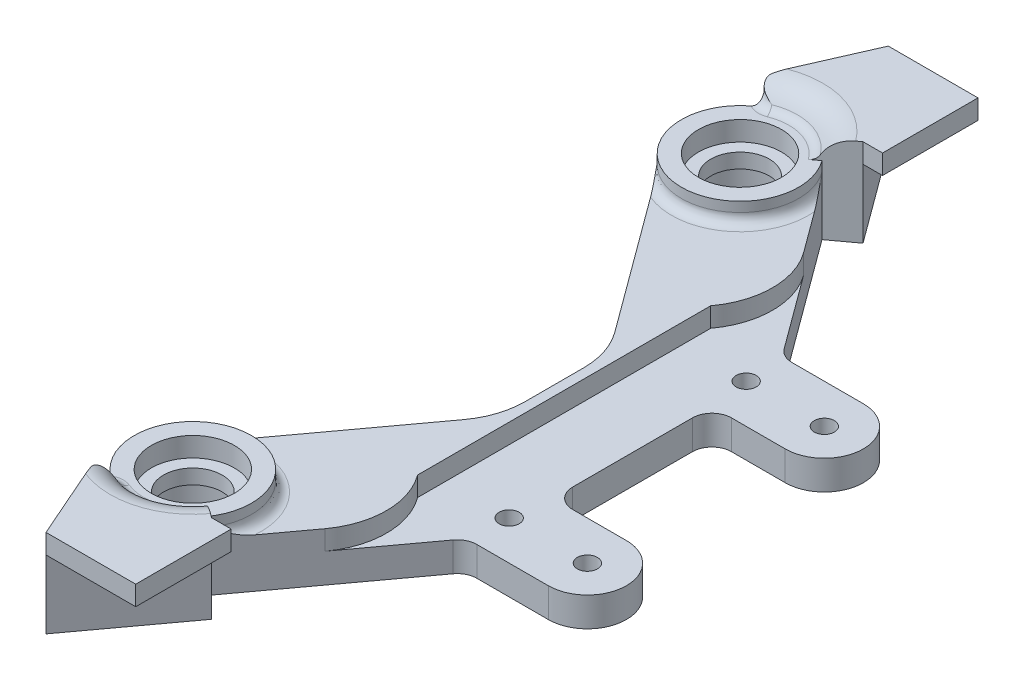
ISO-10303-21;
HEADER;
FILE_DESCRIPTION(('STEP AP214'),'2;1');
FILE_NAME('part.step','',(''),(''),'','','');
FILE_SCHEMA(('AUTOMOTIVE_DESIGN { 1 0 10303 214 1 1 1 1 }'));
ENDSEC;
DATA;
#1=APPLICATION_CONTEXT('core data for automotive mechanical design processes');
#2=APPLICATION_PROTOCOL_DEFINITION('international standard','automotive_design',2000,#1);
#3=PRODUCT_CONTEXT('',#1,'mechanical');
#4=PRODUCT('Part','Part','',(#3));
#5=PRODUCT_RELATED_PRODUCT_CATEGORY('part','',(#4));
#6=PRODUCT_DEFINITION_FORMATION('','',#4);
#7=PRODUCT_DEFINITION_CONTEXT('part definition',#1,'design');
#8=PRODUCT_DEFINITION('design','',#6,#7);
#9=PRODUCT_DEFINITION_SHAPE('','',#8);
#10=(LENGTH_UNIT() NAMED_UNIT(*) SI_UNIT(.MILLI.,.METRE.));
#11=(NAMED_UNIT(*) PLANE_ANGLE_UNIT() SI_UNIT($,.RADIAN.));
#12=(NAMED_UNIT(*) SI_UNIT($,.STERADIAN.) SOLID_ANGLE_UNIT());
#13=UNCERTAINTY_MEASURE_WITH_UNIT(LENGTH_MEASURE(1.E-05),#10,'distance_accuracy_value','');
#14=(GEOMETRIC_REPRESENTATION_CONTEXT(3) GLOBAL_UNCERTAINTY_ASSIGNED_CONTEXT((#13)) GLOBAL_UNIT_ASSIGNED_CONTEXT((#10,
#11,#12)) REPRESENTATION_CONTEXT('',''));
#15=CARTESIAN_POINT('',(0.,0.,0.));
#16=DIRECTION('',(0.,0.,1.));
#17=DIRECTION('',(1.,0.,0.));
#18=AXIS2_PLACEMENT_3D('',#15,#16,#17);
#19=CARTESIAN_POINT('',(0.,5.,0.));
#20=DIRECTION('',(0.,-1.,0.));
#21=DIRECTION('',(0.,0.,-1.));
#22=AXIS2_PLACEMENT_3D('',#19,#20,#21);
#23=PLANE('',#22);
#24=CARTESIAN_POINT('',(-16.1106365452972,5.,34.4949654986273));
#25=DIRECTION('',(0.,-1.,0.));
#26=DIRECTION('',(0.,0.,-1.));
#27=AXIS2_PLACEMENT_3D('',#24,#25,#26);
#28=CIRCLE('',#27,2.);
#29=CARTESIAN_POINT('',(-17.7222273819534,5.,33.3105774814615));
#30=VERTEX_POINT('',#29);
#31=CARTESIAN_POINT('',(-17.1387437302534,5.,32.7794493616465));
#32=VERTEX_POINT('',#31);
#33=EDGE_CURVE('E1074',#30,#32,#28,.T.);
#34=ORIENTED_EDGE('',*,*,#33,.T.);
#35=CARTESIAN_POINT('',(-17.8407510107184,5.,33.4916191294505));
#36=DIRECTION('',(0.,-1.,0.));
#37=DIRECTION('',(0.,0.,-1.));
#38=AXIS2_PLACEMENT_3D('',#35,#36,#37);
#39=CIRCLE('',#38,1.);
#40=CARTESIAN_POINT('',(-17.2206437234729,5.,32.7071021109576));
#41=VERTEX_POINT('',#40);
#42=EDGE_CURVE('E1125',#32,#41,#39,.F.);
#43=ORIENTED_EDGE('',*,*,#42,.T.);
#44=CARTESIAN_POINT('',(-13.5,5.,28.));
#45=DIRECTION('',(0.,1.,0.));
#46=DIRECTION('',(0.,0.,1.));
#47=AXIS2_PLACEMENT_3D('',#44,#45,#46);
#48=CIRCLE('',#47,6.);
#49=CARTESIAN_POINT('',(-18.9945165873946,5.,30.4104537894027));
#50=VERTEX_POINT('',#49);
#51=EDGE_CURVE('E1725',#50,#41,#48,.T.);
#52=ORIENTED_EDGE('',*,*,#51,.F.);
#53=DIRECTION('',(-0.401742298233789,0.,-0.915752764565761));
#54=VECTOR('',#53,1.);
#55=CARTESIAN_POINT('',(-27.116764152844,5.,11.8961706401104));
#56=LINE('',#55,#54);
#57=EDGE_CURVE('E1067',#30,#50,#56,.T.);
#58=ORIENTED_EDGE('',*,*,#57,.F.);
#59=EDGE_LOOP('',(#34,#43,#52,#58));
#60=FACE_BOUND('',#59,.T.);
#61=ADVANCED_FACE('F40',(#60),#23,.F.);
#62=CARTESIAN_POINT('',(-13.5,5.,28.));
#63=DIRECTION('',(0.,-1.,0.));
#64=DIRECTION('',(0.,0.,-1.));
#65=AXIS2_PLACEMENT_3D('',#62,#63,#64);
#66=CIRCLE('',#65,3.);
#67=CARTESIAN_POINT('',(-13.5,5.,25.));
#68=VERTEX_POINT('',#67);
#69=EDGE_CURVE('E680',#68,#68,#66,.T.);
#70=ORIENTED_EDGE('',*,*,#69,.T.);
#71=EDGE_LOOP('',(#70));
#72=FACE_BOUND('',#71,.T.);
#73=CARTESIAN_POINT('',(-13.5,5.,28.));
#74=DIRECTION('',(0.,1.,0.));
#75=DIRECTION('',(0.,0.,1.));
#76=AXIS2_PLACEMENT_3D('',#73,#74,#75);
#77=CIRCLE('',#76,4.25);
#78=CARTESIAN_POINT('',(-13.5,5.,32.25));
#79=VERTEX_POINT('',#78);
#80=EDGE_CURVE('E1722',#79,#79,#77,.T.);
#81=ORIENTED_EDGE('',*,*,#80,.T.);
#82=EDGE_LOOP('',(#81));
#83=FACE_BOUND('',#82,.T.);
#84=ADVANCED_FACE('F1592',(#72,#83),#23,.F.);
#85=CARTESIAN_POINT('',(-8.66522749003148,9.,31.5531640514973));
#86=DIRECTION('',(0.592194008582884,0.,-0.805795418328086));
#87=DIRECTION('',(-0.805795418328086,0.,-0.592194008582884));
#88=AXIS2_PLACEMENT_3D('',#85,#86,#87);
#89=PLANE('',#88);
#90=CARTESIAN_POINT('',(-9.47102290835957,8.,30.9609700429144));
#91=DIRECTION('',(0.592194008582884,0.,-0.805795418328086));
#92=DIRECTION('',(-0.805795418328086,0.,-0.592194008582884));
#93=AXIS2_PLACEMENT_3D('',#90,#91,#92);
#94=CIRCLE('',#93,1.);
#95=CARTESIAN_POINT('',(-9.47102290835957,7.,30.9609700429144));
#96=VERTEX_POINT('',#95);
#97=CARTESIAN_POINT('',(-8.77318360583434,7.5,31.4738250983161));
#98=VERTEX_POINT('',#97);
#99=EDGE_CURVE('E1338',#96,#98,#94,.F.);
#100=ORIENTED_EDGE('',*,*,#99,.T.);
#101=CARTESIAN_POINT('',(-6.67966569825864,6.,33.0123902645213));
#102=DIRECTION('',(0.592194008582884,0.,-0.805795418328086));
#103=DIRECTION('',(-0.805795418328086,0.,-0.592194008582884));
#104=AXIS2_PLACEMENT_3D('',#101,#102,#103);
#105=CIRCLE('',#104,3.);
#106=CARTESIAN_POINT('',(-6.67966569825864,9.,33.0123902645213));
#107=VERTEX_POINT('',#106);
#108=EDGE_CURVE('E1662',#98,#107,#105,.T.);
#109=ORIENTED_EDGE('',*,*,#108,.T.);
#110=DIRECTION('',(0.805795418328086,0.,0.592194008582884));
#111=VECTOR('',#110,1.);
#112=CARTESIAN_POINT('',(-8.66522749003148,9.,31.5531640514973));
#113=LINE('',#112,#111);
#114=CARTESIAN_POINT('',(-6.24784123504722,9.,33.329746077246));
#115=VERTEX_POINT('',#114);
#116=EDGE_CURVE('E586',#107,#115,#113,.T.);
#117=ORIENTED_EDGE('',*,*,#116,.T.);
#118=DIRECTION('',(0.,-1.,0.));
#119=VECTOR('',#118,1.);
#120=CARTESIAN_POINT('',(-6.24784123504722,9.,33.329746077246));
#121=LINE('',#120,#119);
#122=CARTESIAN_POINT('',(-6.24784123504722,7.,33.329746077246));
#123=VERTEX_POINT('',#122);
#124=EDGE_CURVE('E589',#115,#123,#121,.T.);
#125=ORIENTED_EDGE('',*,*,#124,.T.);
#126=CARTESIAN_POINT('',(-6.24784123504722,0.,33.329746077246));
#127=VERTEX_POINT('',#126);
#128=EDGE_CURVE('E588',#123,#127,#121,.T.);
#129=ORIENTED_EDGE('',*,*,#128,.T.);
#130=DIRECTION('',(-0.805795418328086,0.,-0.592194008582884));
#131=VECTOR('',#130,1.);
#132=CARTESIAN_POINT('',(-8.66522749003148,0.,31.5531640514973));
#133=LINE('',#132,#131);
#134=CARTESIAN_POINT('',(-8.66522749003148,0.,31.5531640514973));
#135=VERTEX_POINT('',#134);
#136=EDGE_CURVE('E579',#127,#135,#133,.T.);
#137=ORIENTED_EDGE('',*,*,#136,.T.);
#138=DIRECTION('',(0.,-1.,0.));
#139=VECTOR('',#138,1.);
#140=CARTESIAN_POINT('',(-8.66522749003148,5.,31.5531640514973));
#141=LINE('',#140,#139);
#142=CARTESIAN_POINT('',(-8.66522749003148,6.,31.5531640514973));
#143=VERTEX_POINT('',#142);
#144=EDGE_CURVE('E688',#143,#135,#141,.T.);
#145=ORIENTED_EDGE('',*,*,#144,.F.);
#146=DIRECTION('',(0.,-1.,0.));
#147=VECTOR('',#146,1.);
#148=CARTESIAN_POINT('',(-8.66522749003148,7.,31.5531640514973));
#149=LINE('',#148,#147);
#150=CARTESIAN_POINT('',(-8.66522749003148,7.,31.5531640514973));
#151=VERTEX_POINT('',#150);
#152=EDGE_CURVE('E1731',#143,#151,#149,.F.);
#153=ORIENTED_EDGE('',*,*,#152,.T.);
#154=DIRECTION('',(0.805795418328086,0.,0.592194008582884));
#155=VECTOR('',#154,1.);
#156=CARTESIAN_POINT('',(-8.66522749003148,7.,31.5531640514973));
#157=LINE('',#156,#155);
#158=EDGE_CURVE('E1320',#96,#151,#157,.T.);
#159=ORIENTED_EDGE('',*,*,#158,.F.);
#160=EDGE_LOOP('',(#100,#109,#117,#125,#129,#137,#145,#153,#159));
#161=FACE_BOUND('',#160,.T.);
#162=ADVANCED_FACE('F1108',(#161),#89,.T.);
#163=CARTESIAN_POINT('',(-16.1106365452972,6.,34.4949654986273));
#164=DIRECTION('',(0.,-1.,0.));
#165=DIRECTION('',(0.,0.,-1.));
#166=AXIS2_PLACEMENT_3D('',#163,#164,#165);
#167=TOROIDAL_SURFACE('',#166,2.,1.);
#168=CARTESIAN_POINT('',(-16.1106365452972,6.,34.4949654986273));
#169=DIRECTION('',(0.,-1.,0.));
#170=DIRECTION('',(0.,0.,-1.));
#171=AXIS2_PLACEMENT_3D('',#168,#169,#170);
#172=CIRCLE('',#171,1.);
#173=CARTESIAN_POINT('',(-16.9756937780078,6.,33.9932923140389));
#174=VERTEX_POINT('',#173);
#175=CARTESIAN_POINT('',(-17.026389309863,6.,34.8967077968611));
#176=VERTEX_POINT('',#175);
#177=EDGE_CURVE('E1077',#174,#176,#172,.F.);
#178=ORIENTED_EDGE('',*,*,#177,.F.);
#179=CARTESIAN_POINT('',(-17.1387437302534,5.,32.7794493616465));
#180=CARTESIAN_POINT('',(-17.1235788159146,4.99999893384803,32.7943949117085));
#181=CARTESIAN_POINT('',(-17.1089010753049,5.00063823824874,32.809822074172));
#182=CARTESIAN_POINT('',(-17.080610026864,5.00323514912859,32.8415141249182));
#183=CARTESIAN_POINT('',(-17.0669965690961,5.00519256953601,32.8577788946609));
#184=CARTESIAN_POINT('',(-17.0280561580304,5.01306328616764,32.9074252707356));
#185=CARTESIAN_POINT('',(-17.0044237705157,5.02097413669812,32.9418625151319));
#186=CARTESIAN_POINT('',(-16.9622261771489,5.04205308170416,33.012161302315));
#187=CARTESIAN_POINT('',(-16.9436617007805,5.05522193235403,33.0480230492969));
#188=CARTESIAN_POINT('',(-16.9115626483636,5.08635903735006,33.11991779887));
#189=CARTESIAN_POINT('',(-16.8980325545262,5.10433154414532,33.1559509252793));
#190=CARTESIAN_POINT('',(-16.8721870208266,5.15056385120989,33.2381079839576));
#191=CARTESIAN_POINT('',(-16.8615273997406,5.18028734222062,33.2839239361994));
#192=CARTESIAN_POINT('',(-16.8468181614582,5.24510881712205,33.3727356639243));
#193=CARTESIAN_POINT('',(-16.8427843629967,5.28021944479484,33.4157244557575));
#194=CARTESIAN_POINT('',(-16.8390795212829,5.37581824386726,33.5223683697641));
#195=CARTESIAN_POINT('',(-16.8433032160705,5.43920164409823,33.5835247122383));
#196=CARTESIAN_POINT('',(-16.8605918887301,5.57131942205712,33.6981610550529));
#197=CARTESIAN_POINT('',(-16.8736745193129,5.64006424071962,33.7516254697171));
#198=CARTESIAN_POINT('',(-16.9011743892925,5.75679384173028,33.8357652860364));
#199=CARTESIAN_POINT('',(-16.9136954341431,5.80406605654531,33.8680994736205));
#200=CARTESIAN_POINT('',(-16.941611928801,5.899172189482,33.9306221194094));
#201=CARTESIAN_POINT('',(-16.9570068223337,5.94700599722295,33.9608109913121));
#202=CARTESIAN_POINT('',(-16.9744744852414,5.99655736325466,33.9911853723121));
#203=CARTESIAN_POINT('',(-16.9750831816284,5.99827869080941,33.9922394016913));
#204=CARTESIAN_POINT('',(-16.9756937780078,6.,33.9932923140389));
#205=B_SPLINE_CURVE_WITH_KNOTS('',3,(#179,#180,#181,#182,#183,#184,#185,#186,#187,#188,#189,
#190,#191,#192,#193,#194,#195,#196,#197,#198,#199,#200,#201,#202,#203,#204),.UNSPECIFIED.,.F.,
.F.,(4,2,2,2,2,2,2,2,2,2,2,2,4),(0.,0.063836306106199,0.12766360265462,0.254463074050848,
0.381280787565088,0.508211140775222,0.674211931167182,0.840608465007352,1.10365057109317,
1.36721837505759,1.54299056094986,1.71872875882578,1.72505331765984),.UNSPECIFIED.);
#206=EDGE_CURVE('E1117',#174,#32,#205,.F.);
#207=ORIENTED_EDGE('',*,*,#206,.T.);
#208=ORIENTED_EDGE('',*,*,#33,.F.);
#209=CARTESIAN_POINT('',(-17.7222273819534,5.,33.3105774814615));
#210=CARTESIAN_POINT('',(-17.7050105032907,4.99999719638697,33.3498225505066));
#211=CARTESIAN_POINT('',(-17.6878084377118,5.00206602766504,33.3890338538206));
#212=CARTESIAN_POINT('',(-17.6535751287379,5.01007196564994,33.4670670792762));
#213=CARTESIAN_POINT('',(-17.6365436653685,5.01600318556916,33.5058895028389));
#214=CARTESIAN_POINT('',(-17.5862626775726,5.03899489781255,33.6205026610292));
#215=CARTESIAN_POINT('',(-17.5533886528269,5.06126812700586,33.6954374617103));
#216=CARTESIAN_POINT('',(-17.4774019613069,5.12790134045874,33.8686455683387));
#217=CARTESIAN_POINT('',(-17.4350323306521,5.17739633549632,33.9652251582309));
#218=CARTESIAN_POINT('',(-17.3537728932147,5.29230484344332,34.150452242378));
#219=CARTESIAN_POINT('',(-17.3149038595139,5.35780578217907,34.2390523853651));
#220=CARTESIAN_POINT('',(-17.2327718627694,5.5134206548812,34.426268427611));
#221=CARTESIAN_POINT('',(-17.1902321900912,5.60582936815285,34.5232356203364));
#222=CARTESIAN_POINT('',(-17.1078515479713,5.79732403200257,34.711018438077));
#223=CARTESIAN_POINT('',(-17.0680084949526,5.89640470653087,34.8018388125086));
#224=CARTESIAN_POINT('',(-17.0275870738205,5.99701857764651,34.8939775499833));
#225=CARTESIAN_POINT('',(-17.0269881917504,5.99850928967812,34.8953426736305));
#226=CARTESIAN_POINT('',(-17.026389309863,6.,34.8967077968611));
#227=B_SPLINE_CURVE_WITH_KNOTS('',3,(#209,#210,#211,#212,#213,#214,#215,#216,#217,#218,#219,
#220,#221,#222,#223,#224,#225,#226),.UNSPECIFIED.,.F.,.F.,(4,2,2,2,2,2,2,2,4),(0.,
0.128456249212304,0.256717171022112,0.510014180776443,0.857583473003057,1.20709540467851,
1.62797108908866,2.04851777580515,2.05484233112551),.UNSPECIFIED.);
#228=EDGE_CURVE('E1083',#176,#30,#227,.F.);
#229=ORIENTED_EDGE('',*,*,#228,.F.);
#230=EDGE_LOOP('',(#178,#207,#208,#229));
#231=FACE_BOUND('',#230,.T.);
#232=ADVANCED_FACE('F1103',(#231),#167,.F.);
#233=CARTESIAN_POINT('',(-13.5,5.,-28.));
#234=DIRECTION('',(0.,1.,0.));
#235=DIRECTION('',(0.,0.,1.));
#236=AXIS2_PLACEMENT_3D('',#233,#234,#235);
#237=CIRCLE('',#236,6.);
#238=CARTESIAN_POINT('',(-17.2206437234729,5.,-32.7071021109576));
#239=VERTEX_POINT('',#238);
#240=CARTESIAN_POINT('',(-18.9945165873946,5.,-30.4104537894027));
#241=VERTEX_POINT('',#240);
#242=EDGE_CURVE('E1620',#239,#241,#237,.T.);
#243=ORIENTED_EDGE('',*,*,#242,.F.);
#244=CARTESIAN_POINT('',(-17.8407510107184,5.,-33.4916191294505));
#245=DIRECTION('',(0.,-1.,0.));
#246=DIRECTION('',(0.,0.,-1.));
#247=AXIS2_PLACEMENT_3D('',#244,#245,#246);
#248=CIRCLE('',#247,1.);
#249=CARTESIAN_POINT('',(-17.1387437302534,5.,-32.7794493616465));
#250=VERTEX_POINT('',#249);
#251=EDGE_CURVE('E1307',#239,#250,#248,.F.);
#252=ORIENTED_EDGE('',*,*,#251,.T.);
#253=CARTESIAN_POINT('',(-16.1106365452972,5.,-34.4949654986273));
#254=DIRECTION('',(0.,-1.,0.));
#255=DIRECTION('',(0.,0.,-1.));
#256=AXIS2_PLACEMENT_3D('',#253,#254,#255);
#257=CIRCLE('',#256,2.);
#258=CARTESIAN_POINT('',(-17.7222273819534,5.,-33.3105774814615));
#259=VERTEX_POINT('',#258);
#260=EDGE_CURVE('E1072',#250,#259,#257,.T.);
#261=ORIENTED_EDGE('',*,*,#260,.T.);
#262=DIRECTION('',(0.401742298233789,0.,-0.915752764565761));
#263=VECTOR('',#262,1.);
#264=CARTESIAN_POINT('',(-18.9945165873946,5.,-30.4104537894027));
#265=LINE('',#264,#263);
#266=EDGE_CURVE('E1061',#241,#259,#265,.T.);
#267=ORIENTED_EDGE('',*,*,#266,.F.);
#268=EDGE_LOOP('',(#243,#252,#261,#267));
#269=FACE_BOUND('',#268,.T.);
#270=ADVANCED_FACE('F1107',(#269),#23,.F.);
#271=CARTESIAN_POINT('',(-13.5,5.,-28.));
#272=DIRECTION('',(0.,1.,0.));
#273=DIRECTION('',(0.,0.,1.));
#274=AXIS2_PLACEMENT_3D('',#271,#272,#273);
#275=CIRCLE('',#274,3.);
#276=CARTESIAN_POINT('',(-13.5,5.,-25.));
#277=VERTEX_POINT('',#276);
#278=EDGE_CURVE('E719',#277,#277,#275,.T.);
#279=ORIENTED_EDGE('',*,*,#278,.F.);
#280=EDGE_LOOP('',(#279));
#281=FACE_BOUND('',#280,.T.);
#282=CARTESIAN_POINT('',(-13.5,5.,-28.));
#283=DIRECTION('',(0.,1.,0.));
#284=DIRECTION('',(0.,0.,1.));
#285=AXIS2_PLACEMENT_3D('',#282,#283,#284);
#286=CIRCLE('',#285,4.25);
#287=CARTESIAN_POINT('',(-13.5,5.,-23.75));
#288=VERTEX_POINT('',#287);
#289=EDGE_CURVE('E1735',#288,#288,#286,.T.);
#290=ORIENTED_EDGE('',*,*,#289,.T.);
#291=EDGE_LOOP('',(#290));
#292=FACE_BOUND('',#291,.T.);
#293=ADVANCED_FACE('F1220',(#281,#292),#23,.F.);
#294=CARTESIAN_POINT('',(-8.66522749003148,9.,-31.5531640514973));
#295=DIRECTION('',(-0.592194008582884,0.,-0.805795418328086));
#296=DIRECTION('',(-0.805795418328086,0.,0.592194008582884));
#297=AXIS2_PLACEMENT_3D('',#294,#295,#296);
#298=PLANE('',#297);
#299=DIRECTION('',(0.805795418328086,0.,-0.592194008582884));
#300=VECTOR('',#299,1.);
#301=CARTESIAN_POINT('',(-8.66522749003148,9.,-31.5531640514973));
#302=LINE('',#301,#300);
#303=CARTESIAN_POINT('',(-6.67966569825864,9.,-33.0123902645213));
#304=VERTEX_POINT('',#303);
#305=CARTESIAN_POINT('',(-6.24784123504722,9.,-33.329746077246));
#306=VERTEX_POINT('',#305);
#307=EDGE_CURVE('E626',#304,#306,#302,.T.);
#308=ORIENTED_EDGE('',*,*,#307,.F.);
#309=CARTESIAN_POINT('',(-6.67966569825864,6.,-33.0123902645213));
#310=DIRECTION('',(-0.592194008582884,0.,-0.805795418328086));
#311=DIRECTION('',(-0.805795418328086,0.,0.592194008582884));
#312=AXIS2_PLACEMENT_3D('',#309,#310,#311);
#313=CIRCLE('',#312,3.);
#314=CARTESIAN_POINT('',(-8.77318360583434,7.49999999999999,-31.4738250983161));
#315=VERTEX_POINT('',#314);
#316=EDGE_CURVE('E1166',#304,#315,#313,.F.);
#317=ORIENTED_EDGE('',*,*,#316,.T.);
#318=CARTESIAN_POINT('',(-9.47102290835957,8.,-30.9609700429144));
#319=DIRECTION('',(-0.592194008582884,0.,-0.805795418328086));
#320=DIRECTION('',(-0.805795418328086,0.,0.592194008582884));
#321=AXIS2_PLACEMENT_3D('',#318,#319,#320);
#322=CIRCLE('',#321,1.);
#323=CARTESIAN_POINT('',(-9.47102290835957,7.,-30.9609700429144));
#324=VERTEX_POINT('',#323);
#325=EDGE_CURVE('E1337',#315,#324,#322,.T.);
#326=ORIENTED_EDGE('',*,*,#325,.T.);
#327=DIRECTION('',(-0.805795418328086,0.,0.592194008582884));
#328=VECTOR('',#327,1.);
#329=CARTESIAN_POINT('',(-13.5,7.,-28.));
#330=LINE('',#329,#328);
#331=CARTESIAN_POINT('',(-8.66522749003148,7.,-31.5531640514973));
#332=VERTEX_POINT('',#331);
#333=EDGE_CURVE('E1313',#332,#324,#330,.T.);
#334=ORIENTED_EDGE('',*,*,#333,.F.);
#335=DIRECTION('',(0.,-1.,0.));
#336=VECTOR('',#335,1.);
#337=CARTESIAN_POINT('',(-8.66522749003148,7.,-31.5531640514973));
#338=LINE('',#337,#336);
#339=CARTESIAN_POINT('',(-8.66522749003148,6.,-31.5531640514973));
#340=VERTEX_POINT('',#339);
#341=EDGE_CURVE('E571',#340,#332,#338,.F.);
#342=ORIENTED_EDGE('',*,*,#341,.F.);
#343=DIRECTION('',(0.,-1.,0.));
#344=VECTOR('',#343,1.);
#345=CARTESIAN_POINT('',(-8.66522749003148,5.,-31.5531640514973));
#346=LINE('',#345,#344);
#347=CARTESIAN_POINT('',(-8.66522749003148,0.,-31.5531640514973));
#348=VERTEX_POINT('',#347);
#349=EDGE_CURVE('E734',#340,#348,#346,.T.);
#350=ORIENTED_EDGE('',*,*,#349,.T.);
#351=DIRECTION('',(-0.805795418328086,0.,0.592194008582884));
#352=VECTOR('',#351,1.);
#353=CARTESIAN_POINT('',(-8.66522749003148,0.,-31.5531640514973));
#354=LINE('',#353,#352);
#355=CARTESIAN_POINT('',(-6.24784123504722,0.,-33.329746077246));
#356=VERTEX_POINT('',#355);
#357=EDGE_CURVE('E624',#356,#348,#354,.T.);
#358=ORIENTED_EDGE('',*,*,#357,.F.);
#359=DIRECTION('',(0.,-1.,0.));
#360=VECTOR('',#359,1.);
#361=CARTESIAN_POINT('',(-6.24784123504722,9.,-33.329746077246));
#362=LINE('',#361,#360);
#363=CARTESIAN_POINT('',(-6.24784123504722,7.,-33.329746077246));
#364=VERTEX_POINT('',#363);
#365=EDGE_CURVE('E635',#364,#356,#362,.T.);
#366=ORIENTED_EDGE('',*,*,#365,.F.);
#367=EDGE_CURVE('E636',#306,#364,#362,.T.);
#368=ORIENTED_EDGE('',*,*,#367,.F.);
#369=EDGE_LOOP('',(#308,#317,#326,#334,#342,#350,#358,#366,#368));
#370=FACE_BOUND('',#369,.T.);
#371=ADVANCED_FACE('F1217',(#370),#298,.F.);
#372=CARTESIAN_POINT('',(-16.1106365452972,6.,-34.4949654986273));
#373=DIRECTION('',(0.,-1.,0.));
#374=DIRECTION('',(0.,0.,-1.));
#375=AXIS2_PLACEMENT_3D('',#372,#373,#374);
#376=TOROIDAL_SURFACE('',#375,2.,1.);
#377=ORIENTED_EDGE('',*,*,#260,.F.);
#378=CARTESIAN_POINT('',(-17.1387437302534,5.,-32.7794493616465));
#379=CARTESIAN_POINT('',(-17.1235788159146,4.99999893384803,-32.7943949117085));
#380=CARTESIAN_POINT('',(-17.1089010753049,5.00063823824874,-32.809822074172));
#381=CARTESIAN_POINT('',(-17.080610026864,5.00323514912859,-32.8415141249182));
#382=CARTESIAN_POINT('',(-17.0669965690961,5.00519256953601,-32.8577788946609));
#383=CARTESIAN_POINT('',(-17.0280561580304,5.01306328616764,-32.9074252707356));
#384=CARTESIAN_POINT('',(-17.0044237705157,5.02097413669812,-32.9418625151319));
#385=CARTESIAN_POINT('',(-16.9622261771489,5.04205308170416,-33.012161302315));
#386=CARTESIAN_POINT('',(-16.9436617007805,5.05522193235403,-33.0480230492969));
#387=CARTESIAN_POINT('',(-16.9115626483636,5.08635903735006,-33.11991779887));
#388=CARTESIAN_POINT('',(-16.8980325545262,5.10433154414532,-33.1559509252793));
#389=CARTESIAN_POINT('',(-16.8721870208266,5.15056385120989,-33.2381079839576));
#390=CARTESIAN_POINT('',(-16.8615273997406,5.18028734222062,-33.2839239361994));
#391=CARTESIAN_POINT('',(-16.8468181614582,5.24510881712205,-33.3727356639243));
#392=CARTESIAN_POINT('',(-16.8427843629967,5.28021944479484,-33.4157244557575));
#393=CARTESIAN_POINT('',(-16.8390795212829,5.37581824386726,-33.5223683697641));
#394=CARTESIAN_POINT('',(-16.8433032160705,5.43920164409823,-33.5835247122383));
#395=CARTESIAN_POINT('',(-16.8605918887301,5.57131942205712,-33.6981610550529));
#396=CARTESIAN_POINT('',(-16.8736745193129,5.64006424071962,-33.7516254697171));
#397=CARTESIAN_POINT('',(-16.9011743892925,5.75679384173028,-33.8357652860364));
#398=CARTESIAN_POINT('',(-16.9136954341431,5.80406605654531,-33.8680994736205));
#399=CARTESIAN_POINT('',(-16.941611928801,5.899172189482,-33.9306221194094));
#400=CARTESIAN_POINT('',(-16.9570068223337,5.94700599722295,-33.9608109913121));
#401=CARTESIAN_POINT('',(-16.9744744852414,5.99655736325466,-33.9911853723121));
#402=CARTESIAN_POINT('',(-16.9750831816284,5.99827869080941,-33.9922394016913));
#403=CARTESIAN_POINT('',(-16.9756937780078,6.,-33.9932923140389));
#404=B_SPLINE_CURVE_WITH_KNOTS('',3,(#378,#379,#380,#381,#382,#383,#384,#385,#386,#387,#388,
#389,#390,#391,#392,#393,#394,#395,#396,#397,#398,#399,#400,#401,#402,#403),.UNSPECIFIED.,.F.,
.F.,(4,2,2,2,2,2,2,2,2,2,2,2,4),(0.,0.063836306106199,0.12766360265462,0.254463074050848,
0.381280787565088,0.508211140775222,0.674211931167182,0.840608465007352,1.10365057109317,
1.36721837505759,1.54299056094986,1.71872875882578,1.72505331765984),.UNSPECIFIED.);
#405=CARTESIAN_POINT('',(-16.9756937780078,6.,-33.9932923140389));
#406=VERTEX_POINT('',#405);
#407=EDGE_CURVE('E1299',#250,#406,#404,.T.);
#408=ORIENTED_EDGE('',*,*,#407,.T.);
#409=CARTESIAN_POINT('',(-16.1106365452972,6.,-34.4949654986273));
#410=DIRECTION('',(0.,-1.,0.));
#411=DIRECTION('',(0.,0.,-1.));
#412=AXIS2_PLACEMENT_3D('',#409,#410,#411);
#413=CIRCLE('',#412,1.);
#414=CARTESIAN_POINT('',(-17.026389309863,6.,-34.8967077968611));
#415=VERTEX_POINT('',#414);
#416=EDGE_CURVE('E1080',#415,#406,#413,.F.);
#417=ORIENTED_EDGE('',*,*,#416,.F.);
#418=CARTESIAN_POINT('',(-17.7222273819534,5.,-33.3105774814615));
#419=CARTESIAN_POINT('',(-17.7050105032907,4.99999719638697,-33.3498225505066));
#420=CARTESIAN_POINT('',(-17.6878084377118,5.00206602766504,-33.3890338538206));
#421=CARTESIAN_POINT('',(-17.6535751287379,5.01007196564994,-33.4670670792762));
#422=CARTESIAN_POINT('',(-17.6365436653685,5.01600318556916,-33.5058895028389));
#423=CARTESIAN_POINT('',(-17.5862626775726,5.03899489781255,-33.6205026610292));
#424=CARTESIAN_POINT('',(-17.5533886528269,5.06126812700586,-33.6954374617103));
#425=CARTESIAN_POINT('',(-17.4774019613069,5.12790134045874,-33.8686455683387));
#426=CARTESIAN_POINT('',(-17.4350323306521,5.17739633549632,-33.9652251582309));
#427=CARTESIAN_POINT('',(-17.3537728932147,5.29230484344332,-34.150452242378));
#428=CARTESIAN_POINT('',(-17.3149038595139,5.35780578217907,-34.2390523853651));
#429=CARTESIAN_POINT('',(-17.2327718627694,5.5134206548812,-34.426268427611));
#430=CARTESIAN_POINT('',(-17.1902321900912,5.60582936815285,-34.5232356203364));
#431=CARTESIAN_POINT('',(-17.1078515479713,5.79732403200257,-34.711018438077));
#432=CARTESIAN_POINT('',(-17.0680084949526,5.89640470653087,-34.8018388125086));
#433=CARTESIAN_POINT('',(-17.0275870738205,5.99701857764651,-34.8939775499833));
#434=CARTESIAN_POINT('',(-17.0269881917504,5.99850928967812,-34.8953426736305));
#435=CARTESIAN_POINT('',(-17.026389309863,6.,-34.8967077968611));
#436=B_SPLINE_CURVE_WITH_KNOTS('',3,(#418,#419,#420,#421,#422,#423,#424,#425,#426,#427,#428,
#429,#430,#431,#432,#433,#434,#435),.UNSPECIFIED.,.F.,.F.,(4,2,2,2,2,2,2,2,4),(0.,
0.128456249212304,0.256717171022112,0.510014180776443,0.857583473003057,1.20709540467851,
1.62797108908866,2.04851777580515,2.05484233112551),.UNSPECIFIED.);
#437=EDGE_CURVE('E1091',#259,#415,#436,.T.);
#438=ORIENTED_EDGE('',*,*,#437,.F.);
#439=EDGE_LOOP('',(#377,#408,#417,#438));
#440=FACE_BOUND('',#439,.T.);
#441=ADVANCED_FACE('F1113',(#440),#376,.F.);
#442=CARTESIAN_POINT('',(-13.4278120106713,9.,43.0994963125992));
#443=DIRECTION('',(0.805795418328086,0.,0.592194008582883));
#444=DIRECTION('',(0.592194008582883,0.,-0.805795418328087));
#445=AXIS2_PLACEMENT_3D('',#442,#443,#444);
#446=PLANE('',#445);
#447=ORIENTED_EDGE('',*,*,#128,.F.);
#448=DIRECTION('',(0.592194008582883,0.,-0.805795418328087));
#449=VECTOR('',#448,1.);
#450=CARTESIAN_POINT('',(-6.24784123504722,7.,33.329746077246));
#451=LINE('',#450,#449);
#452=CARTESIAN_POINT('',(-13.4278120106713,7.,43.0994963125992));
#453=VERTEX_POINT('',#452);
#454=EDGE_CURVE('E562',#453,#123,#451,.T.);
#455=ORIENTED_EDGE('',*,*,#454,.F.);
#456=DIRECTION('',(0.,-1.,0.));
#457=VECTOR('',#456,1.);
#458=CARTESIAN_POINT('',(-13.4278120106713,9.,43.0994963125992));
#459=LINE('',#458,#457);
#460=CARTESIAN_POINT('',(-13.4278120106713,0.,43.0994963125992));
#461=VERTEX_POINT('',#460);
#462=EDGE_CURVE('E592',#453,#461,#459,.T.);
#463=ORIENTED_EDGE('',*,*,#462,.T.);
#464=DIRECTION('',(0.592194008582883,0.,-0.805795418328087));
#465=VECTOR('',#464,1.);
#466=CARTESIAN_POINT('',(-13.4278120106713,0.,43.0994963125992));
#467=LINE('',#466,#465);
#468=EDGE_CURVE('E576',#461,#127,#467,.T.);
#469=ORIENTED_EDGE('',*,*,#468,.T.);
#470=EDGE_LOOP('',(#447,#455,#463,#469));
#471=FACE_BOUND('',#470,.T.);
#472=ADVANCED_FACE('F1681',(#471),#446,.T.);
#473=CARTESIAN_POINT('',(-13.5,5.,28.));
#474=DIRECTION('',(0.,-1.,0.));
#475=DIRECTION('',(0.,0.,-1.));
#476=AXIS2_PLACEMENT_3D('',#473,#474,#475);
#477=CYLINDRICAL_SURFACE('',#476,6.);
#478=ORIENTED_EDGE('',*,*,#51,.T.);
#479=DIRECTION('',(0.,-1.,0.));
#480=VECTOR('',#479,1.);
#481=CARTESIAN_POINT('',(-17.2206437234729,5.,32.7071021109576));
#482=LINE('',#481,#480);
#483=CARTESIAN_POINT('',(-17.2206437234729,7.,32.7071021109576));
#484=VERTEX_POINT('',#483);
#485=EDGE_CURVE('E1607',#41,#484,#482,.F.);
#486=ORIENTED_EDGE('',*,*,#485,.T.);
#487=CARTESIAN_POINT('',(-13.5,7.,28.));
#488=DIRECTION('',(0.,1.,0.));
#489=DIRECTION('',(0.,0.,1.));
#490=AXIS2_PLACEMENT_3D('',#487,#488,#489);
#491=CIRCLE('',#490,6.);
#492=EDGE_CURVE('E1728',#151,#484,#491,.T.);
#493=ORIENTED_EDGE('',*,*,#492,.F.);
#494=ORIENTED_EDGE('',*,*,#152,.F.);
#495=CARTESIAN_POINT('',(-13.5,6.,28.));
#496=DIRECTION('',(0.,-1.,0.));
#497=DIRECTION('',(0.,0.,-1.));
#498=AXIS2_PLACEMENT_3D('',#495,#496,#497);
#499=CIRCLE('',#498,6.);
#500=CARTESIAN_POINT('',(-18.3347725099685,6.,24.4468359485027));
#501=VERTEX_POINT('',#500);
#502=EDGE_CURVE('E1355',#143,#501,#499,.F.);
#503=ORIENTED_EDGE('',*,*,#502,.T.);
#504=DIRECTION('',(0.,-1.,0.));
#505=VECTOR('',#504,1.);
#506=CARTESIAN_POINT('',(-18.3347725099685,5.,24.4468359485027));
#507=LINE('',#506,#505);
#508=CARTESIAN_POINT('',(-18.3347725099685,0.,24.4468359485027));
#509=VERTEX_POINT('',#508);
#510=EDGE_CURVE('E691',#501,#509,#507,.T.);
#511=ORIENTED_EDGE('',*,*,#510,.T.);
#512=CARTESIAN_POINT('',(-13.5,0.,28.));
#513=DIRECTION('',(0.,1.,0.));
#514=DIRECTION('',(0.,0.,1.));
#515=AXIS2_PLACEMENT_3D('',#512,#513,#514);
#516=CIRCLE('',#515,6.);
#517=CARTESIAN_POINT('',(-18.9945165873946,0.,30.4104537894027));
#518=VERTEX_POINT('',#517);
#519=EDGE_CURVE('E676',#509,#518,#516,.T.);
#520=ORIENTED_EDGE('',*,*,#519,.T.);
#521=DIRECTION('',(0.,-1.,0.));
#522=VECTOR('',#521,1.);
#523=CARTESIAN_POINT('',(-18.9945165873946,5.,30.4104537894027));
#524=LINE('',#523,#522);
#525=EDGE_CURVE('E1064',#518,#50,#524,.F.);
#526=ORIENTED_EDGE('',*,*,#525,.T.);
#527=EDGE_LOOP('',(#478,#486,#493,#494,#503,#511,#520,#526));
#528=FACE_BOUND('',#527,.T.);
#529=ADVANCED_FACE('F1215',(#528),#477,.T.);
#530=CARTESIAN_POINT('',(-13.4278120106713,9.,-43.0994963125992));
#531=DIRECTION('',(-0.805795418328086,0.,0.592194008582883));
#532=DIRECTION('',(0.592194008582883,0.,0.805795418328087));
#533=AXIS2_PLACEMENT_3D('',#530,#531,#532);
#534=PLANE('',#533);
#535=DIRECTION('',(0.592194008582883,0.,0.805795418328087));
#536=VECTOR('',#535,1.);
#537=CARTESIAN_POINT('',(-6.24784123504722,7.,-33.329746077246));
#538=LINE('',#537,#536);
#539=CARTESIAN_POINT('',(-13.4278120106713,7.,-43.0994963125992));
#540=VERTEX_POINT('',#539);
#541=EDGE_CURVE('E595',#540,#364,#538,.T.);
#542=ORIENTED_EDGE('',*,*,#541,.T.);
#543=ORIENTED_EDGE('',*,*,#365,.T.);
#544=DIRECTION('',(0.592194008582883,0.,0.805795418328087));
#545=VECTOR('',#544,1.);
#546=CARTESIAN_POINT('',(-13.4278120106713,0.,-43.0994963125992));
#547=LINE('',#546,#545);
#548=CARTESIAN_POINT('',(-13.4278120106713,0.,-43.0994963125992));
#549=VERTEX_POINT('',#548);
#550=EDGE_CURVE('E617',#549,#356,#547,.T.);
#551=ORIENTED_EDGE('',*,*,#550,.F.);
#552=DIRECTION('',(0.,-1.,0.));
#553=VECTOR('',#552,1.);
#554=CARTESIAN_POINT('',(-13.4278120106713,9.,-43.0994963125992));
#555=LINE('',#554,#553);
#556=EDGE_CURVE('E631',#540,#549,#555,.T.);
#557=ORIENTED_EDGE('',*,*,#556,.F.);
#558=EDGE_LOOP('',(#542,#543,#551,#557));
#559=FACE_BOUND('',#558,.T.);
#560=ADVANCED_FACE('F1210',(#559),#534,.F.);
#561=CARTESIAN_POINT('',(-13.5,5.,-28.));
#562=DIRECTION('',(0.,-1.,0.));
#563=DIRECTION('',(0.,0.,-1.));
#564=AXIS2_PLACEMENT_3D('',#561,#562,#563);
#565=CYLINDRICAL_SURFACE('',#564,3.);
#566=ORIENTED_EDGE('',*,*,#278,.T.);
#567=EDGE_LOOP('',(#566));
#568=FACE_BOUND('',#567,.T.);
#569=CARTESIAN_POINT('',(-13.5,3.5,-28.));
#570=DIRECTION('',(0.,-1.,0.));
#571=DIRECTION('',(0.,0.,-1.));
#572=AXIS2_PLACEMENT_3D('',#569,#570,#571);
#573=CIRCLE('',#572,3.);
#574=CARTESIAN_POINT('',(-13.5,3.5,-31.));
#575=VERTEX_POINT('',#574);
#576=EDGE_CURVE('E673',#575,#575,#573,.T.);
#577=ORIENTED_EDGE('',*,*,#576,.T.);
#578=EDGE_LOOP('',(#577));
#579=FACE_BOUND('',#578,.T.);
#580=ADVANCED_FACE('F1214',(#568,#579),#565,.F.);
#581=CARTESIAN_POINT('',(-13.5,5.,28.));
#582=DIRECTION('',(0.,-1.,0.));
#583=DIRECTION('',(0.,0.,-1.));
#584=AXIS2_PLACEMENT_3D('',#581,#582,#583);
#585=CYLINDRICAL_SURFACE('',#584,3.);
#586=ORIENTED_EDGE('',*,*,#69,.F.);
#587=EDGE_LOOP('',(#586));
#588=FACE_BOUND('',#587,.T.);
#589=CARTESIAN_POINT('',(-13.5,3.5,28.));
#590=DIRECTION('',(0.,-1.,0.));
#591=DIRECTION('',(0.,0.,-1.));
#592=AXIS2_PLACEMENT_3D('',#589,#590,#591);
#593=CIRCLE('',#592,3.);
#594=CARTESIAN_POINT('',(-13.5,3.5,25.));
#595=VERTEX_POINT('',#594);
#596=EDGE_CURVE('E646',#595,#595,#593,.F.);
#597=ORIENTED_EDGE('',*,*,#596,.F.);
#598=EDGE_LOOP('',(#597));
#599=FACE_BOUND('',#598,.T.);
#600=ADVANCED_FACE('F1252',(#588,#599),#585,.F.);
#601=CARTESIAN_POINT('',(3.5,3.,15.));
#602=DIRECTION('',(-1.,0.,0.));
#603=DIRECTION('',(0.,0.,1.));
#604=AXIS2_PLACEMENT_3D('',#601,#602,#603);
#605=PLANE('',#604);
#606=DIRECTION('',(0.,0.,-1.));
#607=VECTOR('',#606,1.);
#608=CARTESIAN_POINT('',(3.5,3.,15.));
#609=LINE('',#608,#607);
#610=CARTESIAN_POINT('',(3.5,3.,6.125));
#611=VERTEX_POINT('',#610);
#612=CARTESIAN_POINT('',(3.5,3.,-6.125));
#613=VERTEX_POINT('',#612);
#614=EDGE_CURVE('E961',#611,#613,#609,.T.);
#615=ORIENTED_EDGE('',*,*,#614,.F.);
#616=DIRECTION('',(0.,-1.,0.));
#617=VECTOR('',#616,1.);
#618=CARTESIAN_POINT('',(3.5,0.,6.125));
#619=LINE('',#618,#617);
#620=CARTESIAN_POINT('',(3.5,0.,6.125));
#621=VERTEX_POINT('',#620);
#622=EDGE_CURVE('E1007',#611,#621,#619,.T.);
#623=ORIENTED_EDGE('',*,*,#622,.T.);
#624=DIRECTION('',(0.,0.,-1.));
#625=VECTOR('',#624,1.);
#626=CARTESIAN_POINT('',(3.5,0.,15.));
#627=LINE('',#626,#625);
#628=CARTESIAN_POINT('',(3.5,0.,-6.125));
#629=VERTEX_POINT('',#628);
#630=EDGE_CURVE('E957',#621,#629,#627,.T.);
#631=ORIENTED_EDGE('',*,*,#630,.T.);
#632=DIRECTION('',(0.,-1.,0.));
#633=VECTOR('',#632,1.);
#634=CARTESIAN_POINT('',(3.5,3.,-6.125));
#635=LINE('',#634,#633);
#636=EDGE_CURVE('E1005',#629,#613,#635,.F.);
#637=ORIENTED_EDGE('',*,*,#636,.T.);
#638=EDGE_LOOP('',(#615,#623,#631,#637));
#639=FACE_BOUND('',#638,.T.);
#640=ADVANCED_FACE('F1255',(#639),#605,.F.);
#641=CARTESIAN_POINT('',(3.5,5.,15.));
#642=DIRECTION('',(0.805795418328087,0.,0.592194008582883));
#643=DIRECTION('',(0.592194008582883,0.,-0.805795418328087));
#644=AXIS2_PLACEMENT_3D('',#641,#642,#643);
#645=PLANE('',#644);
#646=DIRECTION('',(0.592194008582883,0.,-0.805795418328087));
#647=VECTOR('',#646,1.);
#648=CARTESIAN_POINT('',(3.5,0.,15.));
#649=LINE('',#648,#647);
#650=CARTESIAN_POINT('',(2.07380823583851,0.,16.9406119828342));
#651=VERTEX_POINT('',#650);
#652=EDGE_CURVE('E665',#135,#651,#649,.T.);
#653=ORIENTED_EDGE('',*,*,#652,.T.);
#654=DIRECTION('',(0.,-1.,0.));
#655=VECTOR('',#654,1.);
#656=CARTESIAN_POINT('',(2.07380823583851,5.,16.9406119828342));
#657=LINE('',#656,#655);
#658=CARTESIAN_POINT('',(2.07380823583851,3.,16.9406119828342));
#659=VERTEX_POINT('',#658);
#660=EDGE_CURVE('E998',#651,#659,#657,.F.);
#661=ORIENTED_EDGE('',*,*,#660,.T.);
#662=DIRECTION('',(-0.592194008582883,0.,0.805795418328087));
#663=VECTOR('',#662,1.);
#664=CARTESIAN_POINT('',(3.5,3.,15.));
#665=LINE('',#664,#663);
#666=CARTESIAN_POINT('',(-3.48167801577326,3.,24.4999342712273));
#667=VERTEX_POINT('',#666);
#668=EDGE_CURVE('E988',#659,#667,#665,.T.);
#669=ORIENTED_EDGE('',*,*,#668,.T.);
#670=DIRECTION('',(0.,1.,0.));
#671=VECTOR('',#670,1.);
#672=CARTESIAN_POINT('',(-3.48167801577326,5.,24.4999342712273));
#673=LINE('',#672,#671);
#674=CARTESIAN_POINT('',(-3.48167801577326,5.,24.4999342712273));
#675=VERTEX_POINT('',#674);
#676=EDGE_CURVE('E986',#667,#675,#673,.T.);
#677=ORIENTED_EDGE('',*,*,#676,.T.);
#678=DIRECTION('',(-0.592194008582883,0.,0.805795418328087));
#679=VECTOR('',#678,1.);
#680=CARTESIAN_POINT('',(3.5,5.,15.));
#681=LINE('',#680,#679);
#682=CARTESIAN_POINT('',(-6.53004162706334,5.,28.6478273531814));
#683=VERTEX_POINT('',#682);
#684=EDGE_CURVE('E685',#675,#683,#681,.T.);
#685=ORIENTED_EDGE('',*,*,#684,.T.);
#686=CARTESIAN_POINT('',(-6.53004162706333,5.,28.6478273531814));
#687=CARTESIAN_POINT('',(-6.57160030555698,5.00001036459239,28.7043760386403));
#688=CARTESIAN_POINT('',(-6.61314205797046,5.00195841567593,28.7609016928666));
#689=CARTESIAN_POINT('',(-6.6960956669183,5.00930855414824,28.873776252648));
#690=CARTESIAN_POINT('',(-6.73750758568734,5.01470860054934,28.9301252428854));
#691=CARTESIAN_POINT('',(-6.86124318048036,5.03541993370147,29.098491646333));
#692=CARTESIAN_POINT('',(-6.94330385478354,5.05524729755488,29.2101511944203));
#693=CARTESIAN_POINT('',(-7.1056049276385,5.10411777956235,29.4309934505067));
#694=CARTESIAN_POINT('',(-7.18585522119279,5.13307124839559,29.540189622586));
#695=CARTESIAN_POINT('',(-7.34535841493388,5.1982979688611,29.7572248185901));
#696=CARTESIAN_POINT('',(-7.42461046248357,5.23457707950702,29.8650626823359));
#697=CARTESIAN_POINT('',(-7.60160315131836,5.32248515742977,30.105895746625));
#698=CARTESIAN_POINT('',(-7.69906580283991,5.37569098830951,30.2385126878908));
#699=CARTESIAN_POINT('',(-7.89273344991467,5.48831286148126,30.5020352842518));
#700=CARTESIAN_POINT('',(-7.98893808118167,5.54773065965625,30.6329404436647));
#701=CARTESIAN_POINT('',(-8.27659707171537,5.73216276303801,31.0243565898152));
#702=CARTESIAN_POINT('',(-8.46669050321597,5.86313317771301,31.283015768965));
#703=CARTESIAN_POINT('',(-8.65956503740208,5.99609641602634,31.545459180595));
#704=CARTESIAN_POINT('',(-8.66239626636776,5.99804821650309,31.5493116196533));
#705=CARTESIAN_POINT('',(-8.66522749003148,6.,31.5531640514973));
#706=B_SPLINE_CURVE_WITH_KNOTS('',3,(#686,#687,#688,#689,#690,#691,#692,#693,#694,#695,#696,
#697,#698,#699,#700,#701,#702,#703,#704,#705),.UNSPECIFIED.,.F.,.F.,(4,2,2,2,2,2,2,2,2,4),(0.,
0.210461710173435,0.420799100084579,0.840276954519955,1.25575620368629,1.67156907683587,
2.19028026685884,2.70913847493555,3.74901427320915,3.76450620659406),.UNSPECIFIED.);
#707=EDGE_CURVE('E1265',#683,#143,#706,.T.);
#708=ORIENTED_EDGE('',*,*,#707,.T.);
#709=ORIENTED_EDGE('',*,*,#144,.T.);
#710=EDGE_LOOP('',(#653,#661,#669,#677,#685,#708,#709));
#711=FACE_BOUND('',#710,.T.);
#712=ADVANCED_FACE('F1257',(#711),#645,.T.);
#713=CARTESIAN_POINT('',(-4.5,-30.0166620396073,-15.));
#714=DIRECTION('',(-1.,0.,0.));
#715=DIRECTION('',(0.,0.,1.));
#716=AXIS2_PLACEMENT_3D('',#713,#714,#715);
#717=PLANE('',#716);
#718=DIRECTION('',(0.,0.,-1.));
#719=VECTOR('',#718,1.);
#720=CARTESIAN_POINT('',(-4.5,0.,-15.));
#721=LINE('',#720,#719);
#722=CARTESIAN_POINT('',(-4.5,0.,2.99840389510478));
#723=VERTEX_POINT('',#722);
#724=CARTESIAN_POINT('',(-4.5,0.,-2.99840389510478));
#725=VERTEX_POINT('',#724);
#726=EDGE_CURVE('E744',#723,#725,#721,.T.);
#727=ORIENTED_EDGE('',*,*,#726,.F.);
#728=DIRECTION('',(0.,-1.,0.));
#729=VECTOR('',#728,1.);
#730=CARTESIAN_POINT('',(-4.5,5.,2.99840389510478));
#731=LINE('',#730,#729);
#732=CARTESIAN_POINT('',(-4.5,5.,2.99840389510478));
#733=VERTEX_POINT('',#732);
#734=EDGE_CURVE('E1037',#723,#733,#731,.F.);
#735=ORIENTED_EDGE('',*,*,#734,.T.);
#736=DIRECTION('',(0.,0.,1.));
#737=VECTOR('',#736,1.);
#738=CARTESIAN_POINT('',(-4.5,5.,-15.));
#739=LINE('',#738,#737);
#740=CARTESIAN_POINT('',(-4.5,5.,-2.99840389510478));
#741=VERTEX_POINT('',#740);
#742=EDGE_CURVE('E740',#741,#733,#739,.T.);
#743=ORIENTED_EDGE('',*,*,#742,.F.);
#744=DIRECTION('',(0.,-1.,0.));
#745=VECTOR('',#744,1.);
#746=CARTESIAN_POINT('',(-4.5,-30.0166620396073,-2.99840389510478));
#747=LINE('',#746,#745);
#748=EDGE_CURVE('E1034',#741,#725,#747,.T.);
#749=ORIENTED_EDGE('',*,*,#748,.T.);
#750=EDGE_LOOP('',(#727,#735,#743,#749));
#751=FACE_BOUND('',#750,.T.);
#752=ADVANCED_FACE('F1261',(#751),#717,.T.);
#753=CARTESIAN_POINT('',(3.,3.,12.125));
#754=DIRECTION('',(0.,-1.,0.));
#755=DIRECTION('',(0.,0.,-1.));
#756=AXIS2_PLACEMENT_3D('',#753,#754,#755);
#757=CYLINDRICAL_SURFACE('',#756,1.025);
#758=CARTESIAN_POINT('',(3.,3.,12.125));
#759=DIRECTION('',(0.,-1.,0.));
#760=DIRECTION('',(0.,0.,-1.));
#761=AXIS2_PLACEMENT_3D('',#758,#759,#760);
#762=CIRCLE('',#761,1.025);
#763=CARTESIAN_POINT('',(3.,3.,11.1));
#764=VERTEX_POINT('',#763);
#765=EDGE_CURVE('E952',#764,#764,#762,.T.);
#766=ORIENTED_EDGE('',*,*,#765,.F.);
#767=EDGE_LOOP('',(#766));
#768=FACE_BOUND('',#767,.T.);
#769=CARTESIAN_POINT('',(3.,1.2,12.125));
#770=DIRECTION('',(0.,-1.,0.));
#771=DIRECTION('',(0.,0.,-1.));
#772=AXIS2_PLACEMENT_3D('',#769,#770,#771);
#773=CIRCLE('',#772,1.025);
#774=CARTESIAN_POINT('',(3.,1.2,11.1));
#775=VERTEX_POINT('',#774);
#776=EDGE_CURVE('E948',#775,#775,#773,.F.);
#777=ORIENTED_EDGE('',*,*,#776,.F.);
#778=EDGE_LOOP('',(#777));
#779=FACE_BOUND('',#778,.T.);
#780=ADVANCED_FACE('F1412',(#768,#779),#757,.F.);
#781=CARTESIAN_POINT('',(11.,3.,-12.125));
#782=DIRECTION('',(0.,-1.,0.));
#783=DIRECTION('',(0.,0.,-1.));
#784=AXIS2_PLACEMENT_3D('',#781,#782,#783);
#785=CYLINDRICAL_SURFACE('',#784,1.025);
#786=CARTESIAN_POINT('',(11.,3.,-12.125));
#787=DIRECTION('',(0.,-1.,0.));
#788=DIRECTION('',(0.,0.,-1.));
#789=AXIS2_PLACEMENT_3D('',#786,#787,#788);
#790=CIRCLE('',#789,1.025);
#791=CARTESIAN_POINT('',(11.,3.,-13.15));
#792=VERTEX_POINT('',#791);
#793=EDGE_CURVE('E944',#792,#792,#790,.T.);
#794=ORIENTED_EDGE('',*,*,#793,.F.);
#795=EDGE_LOOP('',(#794));
#796=FACE_BOUND('',#795,.T.);
#797=CARTESIAN_POINT('',(11.,1.2,-12.125));
#798=DIRECTION('',(0.,-1.,0.));
#799=DIRECTION('',(0.,0.,-1.));
#800=AXIS2_PLACEMENT_3D('',#797,#798,#799);
#801=CIRCLE('',#800,1.025);
#802=CARTESIAN_POINT('',(11.,1.2,-13.15));
#803=VERTEX_POINT('',#802);
#804=EDGE_CURVE('E972',#803,#803,#801,.F.);
#805=ORIENTED_EDGE('',*,*,#804,.F.);
#806=EDGE_LOOP('',(#805));
#807=FACE_BOUND('',#806,.T.);
#808=ADVANCED_FACE('F1529',(#796,#807),#785,.F.);
#809=CARTESIAN_POINT('',(3.,3.,-12.125));
#810=DIRECTION('',(0.,-1.,0.));
#811=DIRECTION('',(0.,0.,-1.));
#812=AXIS2_PLACEMENT_3D('',#809,#810,#811);
#813=CYLINDRICAL_SURFACE('',#812,1.025);
#814=CARTESIAN_POINT('',(3.,3.,-12.125));
#815=DIRECTION('',(0.,-1.,0.));
#816=DIRECTION('',(0.,0.,-1.));
#817=AXIS2_PLACEMENT_3D('',#814,#815,#816);
#818=CIRCLE('',#817,1.025);
#819=CARTESIAN_POINT('',(3.,3.,-13.15));
#820=VERTEX_POINT('',#819);
#821=EDGE_CURVE('E947',#820,#820,#818,.T.);
#822=ORIENTED_EDGE('',*,*,#821,.F.);
#823=EDGE_LOOP('',(#822));
#824=FACE_BOUND('',#823,.T.);
#825=CARTESIAN_POINT('',(3.,1.2,-12.125));
#826=DIRECTION('',(0.,-1.,0.));
#827=DIRECTION('',(0.,0.,-1.));
#828=AXIS2_PLACEMENT_3D('',#825,#826,#827);
#829=CIRCLE('',#828,1.025);
#830=CARTESIAN_POINT('',(3.,1.2,-13.15));
#831=VERTEX_POINT('',#830);
#832=EDGE_CURVE('E969',#831,#831,#829,.F.);
#833=ORIENTED_EDGE('',*,*,#832,.F.);
#834=EDGE_LOOP('',(#833));
#835=FACE_BOUND('',#834,.T.);
#836=ADVANCED_FACE('F1532',(#824,#835),#813,.F.);
#837=CARTESIAN_POINT('',(11.,3.,12.125));
#838=DIRECTION('',(0.,-1.,0.));
#839=DIRECTION('',(0.,0.,-1.));
#840=AXIS2_PLACEMENT_3D('',#837,#838,#839);
#841=CYLINDRICAL_SURFACE('',#840,1.025);
#842=CARTESIAN_POINT('',(11.,3.,12.125));
#843=DIRECTION('',(0.,-1.,0.));
#844=DIRECTION('',(0.,0.,-1.));
#845=AXIS2_PLACEMENT_3D('',#842,#843,#844);
#846=CIRCLE('',#845,1.025);
#847=CARTESIAN_POINT('',(11.,3.,11.1));
#848=VERTEX_POINT('',#847);
#849=EDGE_CURVE('E949',#848,#848,#846,.T.);
#850=ORIENTED_EDGE('',*,*,#849,.F.);
#851=EDGE_LOOP('',(#850));
#852=FACE_BOUND('',#851,.T.);
#853=CARTESIAN_POINT('',(11.,1.2,12.125));
#854=DIRECTION('',(0.,-1.,0.));
#855=DIRECTION('',(0.,0.,-1.));
#856=AXIS2_PLACEMENT_3D('',#853,#854,#855);
#857=CIRCLE('',#856,1.025);
#858=CARTESIAN_POINT('',(11.,1.2,11.1));
#859=VERTEX_POINT('',#858);
#860=EDGE_CURVE('E933',#859,#859,#857,.F.);
#861=ORIENTED_EDGE('',*,*,#860,.F.);
#862=EDGE_LOOP('',(#861));
#863=FACE_BOUND('',#862,.T.);
#864=ADVANCED_FACE('F1534',(#852,#863),#841,.F.);
#865=CARTESIAN_POINT('',(0.,3.,0.));
#866=DIRECTION('',(0.,1.,0.));
#867=DIRECTION('',(0.,0.,1.));
#868=AXIS2_PLACEMENT_3D('',#865,#866,#867);
#869=PLANE('',#868);
#870=DIRECTION('',(-1.,0.,0.));
#871=VECTOR('',#870,1.);
#872=CARTESIAN_POINT('',(11.,3.,8.125));
#873=LINE('',#872,#871);
#874=CARTESIAN_POINT('',(11.,3.,8.125));
#875=VERTEX_POINT('',#874);
#876=CARTESIAN_POINT('',(5.5,3.,8.125));
#877=VERTEX_POINT('',#876);
#878=EDGE_CURVE('E662',#875,#877,#873,.T.);
#879=ORIENTED_EDGE('',*,*,#878,.T.);
#880=CARTESIAN_POINT('',(5.5,3.,6.125));
#881=DIRECTION('',(0.,1.,0.));
#882=DIRECTION('',(0.,0.,1.));
#883=AXIS2_PLACEMENT_3D('',#880,#881,#882);
#884=CIRCLE('',#883,2.);
#885=EDGE_CURVE('E1025',#877,#611,#884,.F.);
#886=ORIENTED_EDGE('',*,*,#885,.T.);
#887=ORIENTED_EDGE('',*,*,#614,.T.);
#888=CARTESIAN_POINT('',(5.5,3.,-6.125));
#889=DIRECTION('',(0.,1.,0.));
#890=DIRECTION('',(0.,0.,1.));
#891=AXIS2_PLACEMENT_3D('',#888,#889,#890);
#892=CIRCLE('',#891,2.);
#893=CARTESIAN_POINT('',(5.5,3.,-8.125));
#894=VERTEX_POINT('',#893);
#895=EDGE_CURVE('E1029',#613,#894,#892,.F.);
#896=ORIENTED_EDGE('',*,*,#895,.T.);
#897=DIRECTION('',(-1.,0.,0.));
#898=VECTOR('',#897,1.);
#899=CARTESIAN_POINT('',(11.,3.,-8.125));
#900=LINE('',#899,#898);
#901=CARTESIAN_POINT('',(11.,3.,-8.125));
#902=VERTEX_POINT('',#901);
#903=EDGE_CURVE('E697',#902,#894,#900,.T.);
#904=ORIENTED_EDGE('',*,*,#903,.F.);
#905=CARTESIAN_POINT('',(11.,3.,-12.125));
#906=DIRECTION('',(0.,1.,0.));
#907=DIRECTION('',(0.,0.,1.));
#908=AXIS2_PLACEMENT_3D('',#905,#906,#907);
#909=CIRCLE('',#908,4.);
#910=CARTESIAN_POINT('',(11.,3.,-16.125));
#911=VERTEX_POINT('',#910);
#912=EDGE_CURVE('E706',#911,#902,#909,.F.);
#913=ORIENTED_EDGE('',*,*,#912,.F.);
#914=DIRECTION('',(1.,0.,0.));
#915=VECTOR('',#914,1.);
#916=CARTESIAN_POINT('',(11.,3.,-16.125));
#917=LINE('',#916,#915);
#918=CARTESIAN_POINT('',(3.68539907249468,3.,-16.125));
#919=VERTEX_POINT('',#918);
#920=EDGE_CURVE('E705',#919,#911,#917,.T.);
#921=ORIENTED_EDGE('',*,*,#920,.F.);
#922=CARTESIAN_POINT('',(3.68539907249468,3.,-18.125));
#923=DIRECTION('',(0.,1.,0.));
#924=DIRECTION('',(0.,0.,1.));
#925=AXIS2_PLACEMENT_3D('',#922,#923,#924);
#926=CIRCLE('',#925,2.);
#927=CARTESIAN_POINT('',(2.07380823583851,3.,-16.9406119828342));
#928=VERTEX_POINT('',#927);
#929=EDGE_CURVE('E1021',#919,#928,#926,.F.);
#930=ORIENTED_EDGE('',*,*,#929,.T.);
#931=DIRECTION('',(0.592194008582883,0.,0.805795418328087));
#932=VECTOR('',#931,1.);
#933=CARTESIAN_POINT('',(9.43038017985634,3.,-6.93056142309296));
#934=LINE('',#933,#932);
#935=CARTESIAN_POINT('',(-3.48167801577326,3.,-24.4999342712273));
#936=VERTEX_POINT('',#935);
#937=EDGE_CURVE('E964',#936,#928,#934,.T.);
#938=ORIENTED_EDGE('',*,*,#937,.F.);
#939=CARTESIAN_POINT('',(-9.92804136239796,3.,-19.7623822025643));
#940=DIRECTION('',(0.,1.,0.));
#941=DIRECTION('',(0.,0.,1.));
#942=AXIS2_PLACEMENT_3D('',#939,#940,#941);
#943=CIRCLE('',#942,8.);
#944=CARTESIAN_POINT('',(-3.5,3.,-15.));
#945=VERTEX_POINT('',#944);
#946=EDGE_CURVE('E984',#936,#945,#943,.F.);
#947=ORIENTED_EDGE('',*,*,#946,.T.);
#948=DIRECTION('',(0.,0.,1.));
#949=VECTOR('',#948,1.);
#950=CARTESIAN_POINT('',(-3.5,3.,15.));
#951=LINE('',#950,#949);
#952=CARTESIAN_POINT('',(-3.5,3.,15.));
#953=VERTEX_POINT('',#952);
#954=EDGE_CURVE('E958',#945,#953,#951,.T.);
#955=ORIENTED_EDGE('',*,*,#954,.T.);
#956=CARTESIAN_POINT('',(-9.92804136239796,3.,19.7623822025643));
#957=DIRECTION('',(0.,1.,0.));
#958=DIRECTION('',(0.,0.,1.));
#959=AXIS2_PLACEMENT_3D('',#956,#957,#958);
#960=CIRCLE('',#959,8.);
#961=EDGE_CURVE('E992',#953,#667,#960,.F.);
#962=ORIENTED_EDGE('',*,*,#961,.T.);
#963=ORIENTED_EDGE('',*,*,#668,.F.);
#964=CARTESIAN_POINT('',(3.68539907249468,3.,18.125));
#965=DIRECTION('',(0.,1.,0.));
#966=DIRECTION('',(0.,0.,1.));
#967=AXIS2_PLACEMENT_3D('',#964,#965,#966);
#968=CIRCLE('',#967,2.);
#969=CARTESIAN_POINT('',(3.68539907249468,3.,16.125));
#970=VERTEX_POINT('',#969);
#971=EDGE_CURVE('E1017',#659,#970,#968,.F.);
#972=ORIENTED_EDGE('',*,*,#971,.T.);
#973=DIRECTION('',(1.,0.,0.));
#974=VECTOR('',#973,1.);
#975=CARTESIAN_POINT('',(11.,3.,16.125));
#976=LINE('',#975,#974);
#977=CARTESIAN_POINT('',(11.,3.,16.125));
#978=VERTEX_POINT('',#977);
#979=EDGE_CURVE('E657',#970,#978,#976,.T.);
#980=ORIENTED_EDGE('',*,*,#979,.T.);
#981=CARTESIAN_POINT('',(11.,3.,12.125));
#982=DIRECTION('',(0.,1.,0.));
#983=DIRECTION('',(0.,0.,1.));
#984=AXIS2_PLACEMENT_3D('',#981,#982,#983);
#985=CIRCLE('',#984,4.);
#986=EDGE_CURVE('E666',#978,#875,#985,.T.);
#987=ORIENTED_EDGE('',*,*,#986,.T.);
#988=EDGE_LOOP('',(#879,#886,#887,#896,#904,#913,#921,#930,#938,#947,#955,#962,#963,#972,#980,#987));
#989=FACE_BOUND('',#988,.T.);
#990=ORIENTED_EDGE('',*,*,#849,.T.);
#991=EDGE_LOOP('',(#990));
#992=FACE_BOUND('',#991,.T.);
#993=ORIENTED_EDGE('',*,*,#821,.T.);
#994=EDGE_LOOP('',(#993));
#995=FACE_BOUND('',#994,.T.);
#996=ORIENTED_EDGE('',*,*,#793,.T.);
#997=EDGE_LOOP('',(#996));
#998=FACE_BOUND('',#997,.T.);
#999=ORIENTED_EDGE('',*,*,#765,.T.);
#1000=EDGE_LOOP('',(#999));
#1001=FACE_BOUND('',#1000,.T.);
#1002=ADVANCED_FACE('F1366',(#989,#992,#995,#998,#1001),#869,.T.);
#1003=CARTESIAN_POINT('',(0.,0.,0.));
#1004=DIRECTION('',(0.,1.,0.));
#1005=DIRECTION('',(0.,0.,1.));
#1006=AXIS2_PLACEMENT_3D('',#1003,#1004,#1005);
#1007=PLANE('',#1006);
#1008=CARTESIAN_POINT('',(-13.5,0.,28.));
#1009=DIRECTION('',(0.,-1.,0.));
#1010=DIRECTION('',(0.,0.,-1.));
#1011=AXIS2_PLACEMENT_3D('',#1008,#1009,#1010);
#1012=CIRCLE('',#1011,4.5);
#1013=CARTESIAN_POINT('',(-13.5,0.,23.5));
#1014=VERTEX_POINT('',#1013);
#1015=EDGE_CURVE('E639',#1014,#1014,#1012,.T.);
#1016=ORIENTED_EDGE('',*,*,#1015,.F.);
#1017=EDGE_LOOP('',(#1016));
#1018=FACE_BOUND('',#1017,.T.);
#1019=CARTESIAN_POINT('',(-13.5,0.,-28.));
#1020=DIRECTION('',(0.,-1.,0.));
#1021=DIRECTION('',(0.,0.,-1.));
#1022=AXIS2_PLACEMENT_3D('',#1019,#1020,#1021);
#1023=CIRCLE('',#1022,4.5);
#1024=CARTESIAN_POINT('',(-13.5,0.,-32.5));
#1025=VERTEX_POINT('',#1024);
#1026=EDGE_CURVE('E638',#1025,#1025,#1023,.T.);
#1027=ORIENTED_EDGE('',*,*,#1026,.F.);
#1028=EDGE_LOOP('',(#1027));
#1029=FACE_BOUND('',#1028,.T.);
#1030=ORIENTED_EDGE('',*,*,#630,.F.);
#1031=CARTESIAN_POINT('',(5.5,0.,6.125));
#1032=DIRECTION('',(0.,1.,0.));
#1033=DIRECTION('',(0.,0.,1.));
#1034=AXIS2_PLACEMENT_3D('',#1031,#1032,#1033);
#1035=CIRCLE('',#1034,2.);
#1036=CARTESIAN_POINT('',(5.5,0.,8.125));
#1037=VERTEX_POINT('',#1036);
#1038=EDGE_CURVE('E1023',#621,#1037,#1035,.T.);
#1039=ORIENTED_EDGE('',*,*,#1038,.T.);
#1040=DIRECTION('',(-1.,0.,0.));
#1041=VECTOR('',#1040,1.);
#1042=CARTESIAN_POINT('',(11.,0.,8.125));
#1043=LINE('',#1042,#1041);
#1044=CARTESIAN_POINT('',(11.,0.,8.125));
#1045=VERTEX_POINT('',#1044);
#1046=EDGE_CURVE('E651',#1045,#1037,#1043,.T.);
#1047=ORIENTED_EDGE('',*,*,#1046,.F.);
#1048=CARTESIAN_POINT('',(11.,0.,12.125));
#1049=DIRECTION('',(0.,1.,0.));
#1050=DIRECTION('',(0.,0.,1.));
#1051=AXIS2_PLACEMENT_3D('',#1048,#1049,#1050);
#1052=CIRCLE('',#1051,4.);
#1053=CARTESIAN_POINT('',(11.,0.,16.125));
#1054=VERTEX_POINT('',#1053);
#1055=EDGE_CURVE('E658',#1054,#1045,#1052,.T.);
#1056=ORIENTED_EDGE('',*,*,#1055,.F.);
#1057=DIRECTION('',(1.,0.,0.));
#1058=VECTOR('',#1057,1.);
#1059=CARTESIAN_POINT('',(11.,0.,16.125));
#1060=LINE('',#1059,#1058);
#1061=CARTESIAN_POINT('',(3.68539907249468,0.,16.125));
#1062=VERTEX_POINT('',#1061);
#1063=EDGE_CURVE('E654',#1062,#1054,#1060,.T.);
#1064=ORIENTED_EDGE('',*,*,#1063,.F.);
#1065=CARTESIAN_POINT('',(3.68539907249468,0.,18.125));
#1066=DIRECTION('',(0.,1.,0.));
#1067=DIRECTION('',(0.,0.,1.));
#1068=AXIS2_PLACEMENT_3D('',#1065,#1066,#1067);
#1069=CIRCLE('',#1068,2.);
#1070=EDGE_CURVE('E1015',#1062,#651,#1069,.T.);
#1071=ORIENTED_EDGE('',*,*,#1070,.T.);
#1072=ORIENTED_EDGE('',*,*,#652,.F.);
#1073=ORIENTED_EDGE('',*,*,#136,.F.);
#1074=ORIENTED_EDGE('',*,*,#468,.F.);
#1075=DIRECTION('',(0.401742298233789,0.,0.915752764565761));
#1076=VECTOR('',#1075,1.);
#1077=CARTESIAN_POINT('',(-18.9945165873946,0.,30.4104537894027));
#1078=LINE('',#1077,#1076);
#1079=EDGE_CURVE('E574',#518,#461,#1078,.T.);
#1080=ORIENTED_EDGE('',*,*,#1079,.F.);
#1081=ORIENTED_EDGE('',*,*,#519,.F.);
#1082=DIRECTION('',(-0.592194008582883,0.,0.805795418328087));
#1083=VECTOR('',#1082,1.);
#1084=CARTESIAN_POINT('',(-18.3347725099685,0.,24.4468359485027));
#1085=LINE('',#1084,#1083);
#1086=CARTESIAN_POINT('',(-6.0536366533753,0.,7.73595596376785));
#1087=VERTEX_POINT('',#1086);
#1088=EDGE_CURVE('E678',#1087,#509,#1085,.T.);
#1089=ORIENTED_EDGE('',*,*,#1088,.F.);
#1090=CARTESIAN_POINT('',(-12.5,0.,2.99840389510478));
#1091=DIRECTION('',(0.,1.,0.));
#1092=DIRECTION('',(0.,0.,1.));
#1093=AXIS2_PLACEMENT_3D('',#1090,#1091,#1092);
#1094=CIRCLE('',#1093,8.);
#1095=EDGE_CURVE('E1042',#1087,#723,#1094,.T.);
#1096=ORIENTED_EDGE('',*,*,#1095,.T.);
#1097=ORIENTED_EDGE('',*,*,#726,.T.);
#1098=CARTESIAN_POINT('',(-12.5,0.,-2.99840389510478));
#1099=DIRECTION('',(0.,1.,0.));
#1100=DIRECTION('',(0.,0.,1.));
#1101=AXIS2_PLACEMENT_3D('',#1098,#1099,#1100);
#1102=CIRCLE('',#1101,8.);
#1103=CARTESIAN_POINT('',(-6.0536366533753,0.,-7.73595596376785));
#1104=VERTEX_POINT('',#1103);
#1105=EDGE_CURVE('E1047',#725,#1104,#1102,.T.);
#1106=ORIENTED_EDGE('',*,*,#1105,.T.);
#1107=DIRECTION('',(-0.592194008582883,0.,-0.805795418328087));
#1108=VECTOR('',#1107,1.);
#1109=CARTESIAN_POINT('',(-18.3347725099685,0.,-24.4468359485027));
#1110=LINE('',#1109,#1108);
#1111=CARTESIAN_POINT('',(-18.3347725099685,0.,-24.4468359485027));
#1112=VERTEX_POINT('',#1111);
#1113=EDGE_CURVE('E720',#1104,#1112,#1110,.T.);
#1114=ORIENTED_EDGE('',*,*,#1113,.T.);
#1115=CARTESIAN_POINT('',(-13.5,0.,-28.));
#1116=DIRECTION('',(0.,1.,0.));
#1117=DIRECTION('',(0.,0.,1.));
#1118=AXIS2_PLACEMENT_3D('',#1115,#1116,#1117);
#1119=CIRCLE('',#1118,6.);
#1120=CARTESIAN_POINT('',(-18.9945165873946,0.,-30.4104537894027));
#1121=VERTEX_POINT('',#1120);
#1122=EDGE_CURVE('E715',#1112,#1121,#1119,.F.);
#1123=ORIENTED_EDGE('',*,*,#1122,.T.);
#1124=DIRECTION('',(0.401742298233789,0.,-0.915752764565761));
#1125=VECTOR('',#1124,1.);
#1126=CARTESIAN_POINT('',(-18.9945165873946,0.,-30.4104537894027));
#1127=LINE('',#1126,#1125);
#1128=EDGE_CURVE('E621',#1121,#549,#1127,.T.);
#1129=ORIENTED_EDGE('',*,*,#1128,.T.);
#1130=ORIENTED_EDGE('',*,*,#550,.T.);
#1131=ORIENTED_EDGE('',*,*,#357,.T.);
#1132=DIRECTION('',(0.592194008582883,0.,0.805795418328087));
#1133=VECTOR('',#1132,1.);
#1134=CARTESIAN_POINT('',(3.5,0.,-15.));
#1135=LINE('',#1134,#1133);
#1136=CARTESIAN_POINT('',(2.07380823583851,0.,-16.9406119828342));
#1137=VERTEX_POINT('',#1136);
#1138=EDGE_CURVE('E716',#348,#1137,#1135,.T.);
#1139=ORIENTED_EDGE('',*,*,#1138,.T.);
#1140=CARTESIAN_POINT('',(3.68539907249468,0.,-18.125));
#1141=DIRECTION('',(0.,1.,0.));
#1142=DIRECTION('',(0.,0.,1.));
#1143=AXIS2_PLACEMENT_3D('',#1140,#1141,#1142);
#1144=CIRCLE('',#1143,2.);
#1145=CARTESIAN_POINT('',(3.68539907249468,0.,-16.125));
#1146=VERTEX_POINT('',#1145);
#1147=EDGE_CURVE('E1019',#1137,#1146,#1144,.T.);
#1148=ORIENTED_EDGE('',*,*,#1147,.T.);
#1149=DIRECTION('',(1.,0.,0.));
#1150=VECTOR('',#1149,1.);
#1151=CARTESIAN_POINT('',(11.,0.,-16.125));
#1152=LINE('',#1151,#1150);
#1153=CARTESIAN_POINT('',(11.,0.,-16.125));
#1154=VERTEX_POINT('',#1153);
#1155=EDGE_CURVE('E695',#1146,#1154,#1152,.T.);
#1156=ORIENTED_EDGE('',*,*,#1155,.T.);
#1157=CARTESIAN_POINT('',(11.,0.,-12.125));
#1158=DIRECTION('',(0.,-1.,0.));
#1159=DIRECTION('',(0.,0.,-1.));
#1160=AXIS2_PLACEMENT_3D('',#1157,#1158,#1159);
#1161=CIRCLE('',#1160,4.);
#1162=CARTESIAN_POINT('',(11.,0.,-8.125));
#1163=VERTEX_POINT('',#1162);
#1164=EDGE_CURVE('E694',#1154,#1163,#1161,.T.);
#1165=ORIENTED_EDGE('',*,*,#1164,.T.);
#1166=DIRECTION('',(-1.,0.,0.));
#1167=VECTOR('',#1166,1.);
#1168=CARTESIAN_POINT('',(11.,0.,-8.125));
#1169=LINE('',#1168,#1167);
#1170=CARTESIAN_POINT('',(5.5,0.,-8.125));
#1171=VERTEX_POINT('',#1170);
#1172=EDGE_CURVE('E698',#1163,#1171,#1169,.T.);
#1173=ORIENTED_EDGE('',*,*,#1172,.T.);
#1174=CARTESIAN_POINT('',(5.5,0.,-6.125));
#1175=DIRECTION('',(0.,1.,0.));
#1176=DIRECTION('',(0.,0.,1.));
#1177=AXIS2_PLACEMENT_3D('',#1174,#1175,#1176);
#1178=CIRCLE('',#1177,2.);
#1179=EDGE_CURVE('E1027',#1171,#629,#1178,.T.);
#1180=ORIENTED_EDGE('',*,*,#1179,.T.);
#1181=EDGE_LOOP('',(#1030,#1039,#1047,#1056,#1064,#1071,#1072,#1073,#1074,#1080,#1081,#1089,
#1096,#1097,#1106,#1114,#1123,#1129,#1130,#1131,#1139,#1148,#1156,#1165,#1173,#1180));
#1182=FACE_BOUND('',#1181,.T.);
#1183=DIRECTION('',(-0.5,0.,0.866025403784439));
#1184=VECTOR('',#1183,1.);
#1185=CARTESIAN_POINT('',(5.3094010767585,0.,12.125));
#1186=LINE('',#1185,#1184);
#1187=CARTESIAN_POINT('',(5.3094010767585,0.,12.125));
#1188=VERTEX_POINT('',#1187);
#1189=CARTESIAN_POINT('',(4.15470053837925,0.,14.125));
#1190=VERTEX_POINT('',#1189);
#1191=EDGE_CURVE('E917',#1188,#1190,#1186,.T.);
#1192=ORIENTED_EDGE('',*,*,#1191,.F.);
#1193=DIRECTION('',(0.5,0.,0.866025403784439));
#1194=VECTOR('',#1193,1.);
#1195=CARTESIAN_POINT('',(4.15470053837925,0.,10.125));
#1196=LINE('',#1195,#1194);
#1197=CARTESIAN_POINT('',(4.15470053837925,0.,10.125));
#1198=VERTEX_POINT('',#1197);
#1199=EDGE_CURVE('E839',#1198,#1188,#1196,.T.);
#1200=ORIENTED_EDGE('',*,*,#1199,.F.);
#1201=DIRECTION('',(1.,0.,0.));
#1202=VECTOR('',#1201,1.);
#1203=CARTESIAN_POINT('',(1.84529946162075,0.,10.125));
#1204=LINE('',#1203,#1202);
#1205=CARTESIAN_POINT('',(1.84529946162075,0.,10.125));
#1206=VERTEX_POINT('',#1205);
#1207=EDGE_CURVE('E900',#1206,#1198,#1204,.T.);
#1208=ORIENTED_EDGE('',*,*,#1207,.F.);
#1209=DIRECTION('',(0.5,0.,-0.866025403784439));
#1210=VECTOR('',#1209,1.);
#1211=CARTESIAN_POINT('',(0.690598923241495,0.,12.125));
#1212=LINE('',#1211,#1210);
#1213=CARTESIAN_POINT('',(0.690598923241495,0.,12.125));
#1214=VERTEX_POINT('',#1213);
#1215=EDGE_CURVE('E926',#1214,#1206,#1212,.T.);
#1216=ORIENTED_EDGE('',*,*,#1215,.F.);
#1217=DIRECTION('',(-0.5,0.,-0.866025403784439));
#1218=VECTOR('',#1217,1.);
#1219=CARTESIAN_POINT('',(1.84529946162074,0.,14.125));
#1220=LINE('',#1219,#1218);
#1221=CARTESIAN_POINT('',(1.84529946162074,0.,14.125));
#1222=VERTEX_POINT('',#1221);
#1223=EDGE_CURVE('E923',#1222,#1214,#1220,.T.);
#1224=ORIENTED_EDGE('',*,*,#1223,.F.);
#1225=DIRECTION('',(-1.,0.,0.));
#1226=VECTOR('',#1225,1.);
#1227=CARTESIAN_POINT('',(4.15470053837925,0.,14.125));
#1228=LINE('',#1227,#1226);
#1229=EDGE_CURVE('E920',#1190,#1222,#1228,.T.);
#1230=ORIENTED_EDGE('',*,*,#1229,.F.);
#1231=EDGE_LOOP('',(#1192,#1200,#1208,#1216,#1224,#1230));
#1232=FACE_BOUND('',#1231,.T.);
#1233=DIRECTION('',(0.500000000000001,0.,-0.866025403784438));
#1234=VECTOR('',#1233,1.);
#1235=CARTESIAN_POINT('',(8.6905989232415,0.,-12.125));
#1236=LINE('',#1235,#1234);
#1237=CARTESIAN_POINT('',(8.6905989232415,0.,-12.125));
#1238=VERTEX_POINT('',#1237);
#1239=CARTESIAN_POINT('',(9.84529946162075,0.,-14.125));
#1240=VERTEX_POINT('',#1239);
#1241=EDGE_CURVE('E773',#1238,#1240,#1236,.T.);
#1242=ORIENTED_EDGE('',*,*,#1241,.F.);
#1243=DIRECTION('',(-0.500000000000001,0.,-0.866025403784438));
#1244=VECTOR('',#1243,1.);
#1245=CARTESIAN_POINT('',(9.84529946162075,0.,-10.125));
#1246=LINE('',#1245,#1244);
#1247=CARTESIAN_POINT('',(9.84529946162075,0.,-10.125));
#1248=VERTEX_POINT('',#1247);
#1249=EDGE_CURVE('E747',#1248,#1238,#1246,.T.);
#1250=ORIENTED_EDGE('',*,*,#1249,.F.);
#1251=DIRECTION('',(-1.,0.,0.));
#1252=VECTOR('',#1251,1.);
#1253=CARTESIAN_POINT('',(12.1547005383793,0.,-10.125));
#1254=LINE('',#1253,#1252);
#1255=CARTESIAN_POINT('',(12.1547005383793,0.,-10.125));
#1256=VERTEX_POINT('',#1255);
#1257=EDGE_CURVE('E756',#1256,#1248,#1254,.T.);
#1258=ORIENTED_EDGE('',*,*,#1257,.F.);
#1259=DIRECTION('',(-0.5,0.,0.866025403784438));
#1260=VECTOR('',#1259,1.);
#1261=CARTESIAN_POINT('',(13.3094010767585,0.,-12.125));
#1262=LINE('',#1261,#1260);
#1263=CARTESIAN_POINT('',(13.3094010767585,0.,-12.125));
#1264=VERTEX_POINT('',#1263);
#1265=EDGE_CURVE('E782',#1264,#1256,#1262,.T.);
#1266=ORIENTED_EDGE('',*,*,#1265,.F.);
#1267=DIRECTION('',(0.5,0.,0.866025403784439));
#1268=VECTOR('',#1267,1.);
#1269=CARTESIAN_POINT('',(12.1547005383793,0.,-14.125));
#1270=LINE('',#1269,#1268);
#1271=CARTESIAN_POINT('',(12.1547005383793,0.,-14.125));
#1272=VERTEX_POINT('',#1271);
#1273=EDGE_CURVE('E779',#1272,#1264,#1270,.T.);
#1274=ORIENTED_EDGE('',*,*,#1273,.F.);
#1275=DIRECTION('',(1.,0.,0.));
#1276=VECTOR('',#1275,1.);
#1277=CARTESIAN_POINT('',(9.84529946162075,0.,-14.125));
#1278=LINE('',#1277,#1276);
#1279=EDGE_CURVE('E776',#1240,#1272,#1278,.T.);
#1280=ORIENTED_EDGE('',*,*,#1279,.F.);
#1281=EDGE_LOOP('',(#1242,#1250,#1258,#1266,#1274,#1280));
#1282=FACE_BOUND('',#1281,.T.);
#1283=DIRECTION('',(0.5,0.,-0.866025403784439));
#1284=VECTOR('',#1283,1.);
#1285=CARTESIAN_POINT('',(8.6905989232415,0.,12.125));
#1286=LINE('',#1285,#1284);
#1287=CARTESIAN_POINT('',(8.6905989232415,0.,12.125));
#1288=VERTEX_POINT('',#1287);
#1289=CARTESIAN_POINT('',(9.84529946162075,0.,10.125));
#1290=VERTEX_POINT('',#1289);
#1291=EDGE_CURVE('E871',#1288,#1290,#1286,.T.);
#1292=ORIENTED_EDGE('',*,*,#1291,.F.);
#1293=DIRECTION('',(-0.5,0.,-0.866025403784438));
#1294=VECTOR('',#1293,1.);
#1295=CARTESIAN_POINT('',(9.84529946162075,0.,14.125));
#1296=LINE('',#1295,#1294);
#1297=CARTESIAN_POINT('',(9.84529946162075,0.,14.125));
#1298=VERTEX_POINT('',#1297);
#1299=EDGE_CURVE('E789',#1298,#1288,#1296,.T.);
#1300=ORIENTED_EDGE('',*,*,#1299,.F.);
#1301=DIRECTION('',(-1.,0.,0.));
#1302=VECTOR('',#1301,1.);
#1303=CARTESIAN_POINT('',(12.1547005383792,0.,14.125));
#1304=LINE('',#1303,#1302);
#1305=CARTESIAN_POINT('',(12.1547005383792,0.,14.125));
#1306=VERTEX_POINT('',#1305);
#1307=EDGE_CURVE('E854',#1306,#1298,#1304,.T.);
#1308=ORIENTED_EDGE('',*,*,#1307,.F.);
#1309=DIRECTION('',(-0.5,0.,0.866025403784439));
#1310=VECTOR('',#1309,1.);
#1311=CARTESIAN_POINT('',(13.3094010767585,0.,12.125));
#1312=LINE('',#1311,#1310);
#1313=CARTESIAN_POINT('',(13.3094010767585,0.,12.125));
#1314=VERTEX_POINT('',#1313);
#1315=EDGE_CURVE('E880',#1314,#1306,#1312,.T.);
#1316=ORIENTED_EDGE('',*,*,#1315,.F.);
#1317=DIRECTION('',(0.5,0.,0.866025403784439));
#1318=VECTOR('',#1317,1.);
#1319=CARTESIAN_POINT('',(12.1547005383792,0.,10.125));
#1320=LINE('',#1319,#1318);
#1321=CARTESIAN_POINT('',(12.1547005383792,0.,10.125));
#1322=VERTEX_POINT('',#1321);
#1323=EDGE_CURVE('E877',#1322,#1314,#1320,.T.);
#1324=ORIENTED_EDGE('',*,*,#1323,.F.);
#1325=DIRECTION('',(1.,0.,0.));
#1326=VECTOR('',#1325,1.);
#1327=CARTESIAN_POINT('',(9.84529946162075,0.,10.125));
#1328=LINE('',#1327,#1326);
#1329=EDGE_CURVE('E874',#1290,#1322,#1328,.T.);
#1330=ORIENTED_EDGE('',*,*,#1329,.F.);
#1331=EDGE_LOOP('',(#1292,#1300,#1308,#1316,#1324,#1330));
#1332=FACE_BOUND('',#1331,.T.);
#1333=DIRECTION('',(-0.5,0.,0.866025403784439));
#1334=VECTOR('',#1333,1.);
#1335=CARTESIAN_POINT('',(5.3094010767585,0.,-12.125));
#1336=LINE('',#1335,#1334);
#1337=CARTESIAN_POINT('',(5.3094010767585,0.,-12.125));
#1338=VERTEX_POINT('',#1337);
#1339=CARTESIAN_POINT('',(4.15470053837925,0.,-10.125));
#1340=VERTEX_POINT('',#1339);
#1341=EDGE_CURVE('E822',#1338,#1340,#1336,.T.);
#1342=ORIENTED_EDGE('',*,*,#1341,.F.);
#1343=DIRECTION('',(0.5,0.,0.866025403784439));
#1344=VECTOR('',#1343,1.);
#1345=CARTESIAN_POINT('',(4.15470053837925,0.,-14.125));
#1346=LINE('',#1345,#1344);
#1347=CARTESIAN_POINT('',(4.15470053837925,0.,-14.125));
#1348=VERTEX_POINT('',#1347);
#1349=EDGE_CURVE('E820',#1348,#1338,#1346,.T.);
#1350=ORIENTED_EDGE('',*,*,#1349,.F.);
#1351=DIRECTION('',(1.,0.,0.));
#1352=VECTOR('',#1351,1.);
#1353=CARTESIAN_POINT('',(1.84529946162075,0.,-14.125));
#1354=LINE('',#1353,#1352);
#1355=CARTESIAN_POINT('',(1.84529946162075,0.,-14.125));
#1356=VERTEX_POINT('',#1355);
#1357=EDGE_CURVE('E804',#1356,#1348,#1354,.T.);
#1358=ORIENTED_EDGE('',*,*,#1357,.F.);
#1359=DIRECTION('',(0.5,0.,-0.866025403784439));
#1360=VECTOR('',#1359,1.);
#1361=CARTESIAN_POINT('',(0.690598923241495,0.,-12.125));
#1362=LINE('',#1361,#1360);
#1363=CARTESIAN_POINT('',(0.690598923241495,0.,-12.125));
#1364=VERTEX_POINT('',#1363);
#1365=EDGE_CURVE('E832',#1364,#1356,#1362,.T.);
#1366=ORIENTED_EDGE('',*,*,#1365,.F.);
#1367=DIRECTION('',(-0.5,0.,-0.866025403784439));
#1368=VECTOR('',#1367,1.);
#1369=CARTESIAN_POINT('',(1.84529946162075,0.,-10.125));
#1370=LINE('',#1369,#1368);
#1371=CARTESIAN_POINT('',(1.84529946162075,0.,-10.125));
#1372=VERTEX_POINT('',#1371);
#1373=EDGE_CURVE('E829',#1372,#1364,#1370,.T.);
#1374=ORIENTED_EDGE('',*,*,#1373,.F.);
#1375=DIRECTION('',(-1.,0.,0.));
#1376=VECTOR('',#1375,1.);
#1377=CARTESIAN_POINT('',(4.15470053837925,0.,-10.125));
#1378=LINE('',#1377,#1376);
#1379=EDGE_CURVE('E826',#1340,#1372,#1378,.T.);
#1380=ORIENTED_EDGE('',*,*,#1379,.F.);
#1381=EDGE_LOOP('',(#1342,#1350,#1358,#1366,#1374,#1380));
#1382=FACE_BOUND('',#1381,.T.);
#1383=ADVANCED_FACE('F1479',(#1018,#1029,#1182,#1232,#1282,#1332,#1382),#1007,.F.);
#1384=CARTESIAN_POINT('',(0.,1.2,0.));
#1385=DIRECTION('',(0.,-1.,0.));
#1386=DIRECTION('',(0.,0.,-1.));
#1387=AXIS2_PLACEMENT_3D('',#1384,#1385,#1386);
#1388=PLANE('',#1387);
#1389=DIRECTION('',(-0.5,0.,-0.866025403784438));
#1390=VECTOR('',#1389,1.);
#1391=CARTESIAN_POINT('',(9.84529946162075,1.2,14.125));
#1392=LINE('',#1391,#1390);
#1393=CARTESIAN_POINT('',(9.84529946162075,1.2,14.125));
#1394=VERTEX_POINT('',#1393);
#1395=CARTESIAN_POINT('',(8.6905989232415,1.2,12.125));
#1396=VERTEX_POINT('',#1395);
#1397=EDGE_CURVE('E850',#1394,#1396,#1392,.T.);
#1398=ORIENTED_EDGE('',*,*,#1397,.T.);
#1399=DIRECTION('',(0.5,0.,-0.866025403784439));
#1400=VECTOR('',#1399,1.);
#1401=CARTESIAN_POINT('',(8.6905989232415,1.2,12.125));
#1402=LINE('',#1401,#1400);
#1403=CARTESIAN_POINT('',(9.84529946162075,1.2,10.125));
#1404=VERTEX_POINT('',#1403);
#1405=EDGE_CURVE('E853',#1396,#1404,#1402,.T.);
#1406=ORIENTED_EDGE('',*,*,#1405,.T.);
#1407=DIRECTION('',(1.,0.,0.));
#1408=VECTOR('',#1407,1.);
#1409=CARTESIAN_POINT('',(9.84529946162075,1.2,10.125));
#1410=LINE('',#1409,#1408);
#1411=CARTESIAN_POINT('',(12.1547005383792,1.2,10.125));
#1412=VERTEX_POINT('',#1411);
#1413=EDGE_CURVE('E857',#1404,#1412,#1410,.T.);
#1414=ORIENTED_EDGE('',*,*,#1413,.T.);
#1415=DIRECTION('',(0.5,0.,0.866025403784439));
#1416=VECTOR('',#1415,1.);
#1417=CARTESIAN_POINT('',(12.1547005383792,1.2,10.125));
#1418=LINE('',#1417,#1416);
#1419=CARTESIAN_POINT('',(13.3094010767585,1.2,12.125));
#1420=VERTEX_POINT('',#1419);
#1421=EDGE_CURVE('E860',#1412,#1420,#1418,.T.);
#1422=ORIENTED_EDGE('',*,*,#1421,.T.);
#1423=DIRECTION('',(-0.5,0.,0.866025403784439));
#1424=VECTOR('',#1423,1.);
#1425=CARTESIAN_POINT('',(13.3094010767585,1.2,12.125));
#1426=LINE('',#1425,#1424);
#1427=CARTESIAN_POINT('',(12.1547005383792,1.2,14.125));
#1428=VERTEX_POINT('',#1427);
#1429=EDGE_CURVE('E863',#1420,#1428,#1426,.T.);
#1430=ORIENTED_EDGE('',*,*,#1429,.T.);
#1431=DIRECTION('',(-1.,0.,0.));
#1432=VECTOR('',#1431,1.);
#1433=CARTESIAN_POINT('',(12.1547005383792,1.2,14.125));
#1434=LINE('',#1433,#1432);
#1435=EDGE_CURVE('E866',#1428,#1394,#1434,.T.);
#1436=ORIENTED_EDGE('',*,*,#1435,.T.);
#1437=EDGE_LOOP('',(#1398,#1406,#1414,#1422,#1430,#1436));
#1438=FACE_BOUND('',#1437,.T.);
#1439=ORIENTED_EDGE('',*,*,#860,.T.);
#1440=EDGE_LOOP('',(#1439));
#1441=FACE_BOUND('',#1440,.T.);
#1442=ADVANCED_FACE('F1475',(#1438,#1441),#1388,.T.);
#1443=CARTESIAN_POINT('',(9.84529946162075,1.2,14.125));
#1444=DIRECTION('',(-0.866025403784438,0.,0.5));
#1445=DIRECTION('',(0.5,0.,0.866025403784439));
#1446=AXIS2_PLACEMENT_3D('',#1443,#1444,#1445);
#1447=PLANE('',#1446);
#1448=ORIENTED_EDGE('',*,*,#1299,.T.);
#1449=DIRECTION('',(0.,-1.,0.));
#1450=VECTOR('',#1449,1.);
#1451=CARTESIAN_POINT('',(8.6905989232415,1.2,12.125));
#1452=LINE('',#1451,#1450);
#1453=EDGE_CURVE('E869',#1396,#1288,#1452,.T.);
#1454=ORIENTED_EDGE('',*,*,#1453,.F.);
#1455=ORIENTED_EDGE('',*,*,#1397,.F.);
#1456=DIRECTION('',(0.,-1.,0.));
#1457=VECTOR('',#1456,1.);
#1458=CARTESIAN_POINT('',(9.84529946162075,1.2,14.125));
#1459=LINE('',#1458,#1457);
#1460=EDGE_CURVE('E823',#1394,#1298,#1459,.T.);
#1461=ORIENTED_EDGE('',*,*,#1460,.T.);
#1462=EDGE_LOOP('',(#1448,#1454,#1455,#1461));
#1463=FACE_BOUND('',#1462,.T.);
#1464=ADVANCED_FACE('F1478',(#1463),#1447,.F.);
#1465=CARTESIAN_POINT('',(12.1547005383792,1.2,14.125));
#1466=DIRECTION('',(0.,0.,1.));
#1467=DIRECTION('',(1.,0.,0.));
#1468=AXIS2_PLACEMENT_3D('',#1465,#1466,#1467);
#1469=PLANE('',#1468);
#1470=ORIENTED_EDGE('',*,*,#1307,.T.);
#1471=ORIENTED_EDGE('',*,*,#1460,.F.);
#1472=ORIENTED_EDGE('',*,*,#1435,.F.);
#1473=DIRECTION('',(0.,-1.,0.));
#1474=VECTOR('',#1473,1.);
#1475=CARTESIAN_POINT('',(12.1547005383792,1.2,14.125));
#1476=LINE('',#1475,#1474);
#1477=EDGE_CURVE('E886',#1428,#1306,#1476,.T.);
#1478=ORIENTED_EDGE('',*,*,#1477,.T.);
#1479=EDGE_LOOP('',(#1470,#1471,#1472,#1478));
#1480=FACE_BOUND('',#1479,.T.);
#1481=ADVANCED_FACE('F1481',(#1480),#1469,.F.);
#1482=CARTESIAN_POINT('',(13.3094010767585,1.2,12.125));
#1483=DIRECTION('',(0.866025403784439,0.,0.5));
#1484=DIRECTION('',(0.5,0.,-0.866025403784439));
#1485=AXIS2_PLACEMENT_3D('',#1482,#1483,#1484);
#1486=PLANE('',#1485);
#1487=ORIENTED_EDGE('',*,*,#1315,.T.);
#1488=ORIENTED_EDGE('',*,*,#1477,.F.);
#1489=ORIENTED_EDGE('',*,*,#1429,.F.);
#1490=DIRECTION('',(0.,-1.,0.));
#1491=VECTOR('',#1490,1.);
#1492=CARTESIAN_POINT('',(13.3094010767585,1.2,12.125));
#1493=LINE('',#1492,#1491);
#1494=EDGE_CURVE('E888',#1420,#1314,#1493,.T.);
#1495=ORIENTED_EDGE('',*,*,#1494,.T.);
#1496=EDGE_LOOP('',(#1487,#1488,#1489,#1495));
#1497=FACE_BOUND('',#1496,.T.);
#1498=ADVANCED_FACE('F1484',(#1497),#1486,.F.);
#1499=CARTESIAN_POINT('',(12.1547005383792,1.2,10.125));
#1500=DIRECTION('',(0.866025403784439,0.,-0.5));
#1501=DIRECTION('',(-0.5,0.,-0.866025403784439));
#1502=AXIS2_PLACEMENT_3D('',#1499,#1500,#1501);
#1503=PLANE('',#1502);
#1504=ORIENTED_EDGE('',*,*,#1323,.T.);
#1505=ORIENTED_EDGE('',*,*,#1494,.F.);
#1506=ORIENTED_EDGE('',*,*,#1421,.F.);
#1507=DIRECTION('',(0.,-1.,0.));
#1508=VECTOR('',#1507,1.);
#1509=CARTESIAN_POINT('',(12.1547005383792,1.2,10.125));
#1510=LINE('',#1509,#1508);
#1511=EDGE_CURVE('E890',#1412,#1322,#1510,.T.);
#1512=ORIENTED_EDGE('',*,*,#1511,.T.);
#1513=EDGE_LOOP('',(#1504,#1505,#1506,#1512));
#1514=FACE_BOUND('',#1513,.T.);
#1515=ADVANCED_FACE('F1488',(#1514),#1503,.F.);
#1516=CARTESIAN_POINT('',(9.84529946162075,1.2,10.125));
#1517=DIRECTION('',(0.,0.,-1.));
#1518=DIRECTION('',(-1.,0.,0.));
#1519=AXIS2_PLACEMENT_3D('',#1516,#1517,#1518);
#1520=PLANE('',#1519);
#1521=ORIENTED_EDGE('',*,*,#1329,.T.);
#1522=ORIENTED_EDGE('',*,*,#1511,.F.);
#1523=ORIENTED_EDGE('',*,*,#1413,.F.);
#1524=DIRECTION('',(0.,-1.,0.));
#1525=VECTOR('',#1524,1.);
#1526=CARTESIAN_POINT('',(9.84529946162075,1.2,10.125));
#1527=LINE('',#1526,#1525);
#1528=EDGE_CURVE('E892',#1404,#1290,#1527,.T.);
#1529=ORIENTED_EDGE('',*,*,#1528,.T.);
#1530=EDGE_LOOP('',(#1521,#1522,#1523,#1529));
#1531=FACE_BOUND('',#1530,.T.);
#1532=ADVANCED_FACE('F1492',(#1531),#1520,.F.);
#1533=CARTESIAN_POINT('',(8.6905989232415,1.2,12.125));
#1534=DIRECTION('',(-0.866025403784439,0.,-0.5));
#1535=DIRECTION('',(-0.5,0.,0.866025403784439));
#1536=AXIS2_PLACEMENT_3D('',#1533,#1534,#1535);
#1537=PLANE('',#1536);
#1538=ORIENTED_EDGE('',*,*,#1291,.T.);
#1539=ORIENTED_EDGE('',*,*,#1528,.F.);
#1540=ORIENTED_EDGE('',*,*,#1405,.F.);
#1541=ORIENTED_EDGE('',*,*,#1453,.T.);
#1542=EDGE_LOOP('',(#1538,#1539,#1540,#1541));
#1543=FACE_BOUND('',#1542,.T.);
#1544=ADVANCED_FACE('F1451',(#1543),#1537,.F.);
#1545=CARTESIAN_POINT('',(0.,1.2,0.));
#1546=DIRECTION('',(0.,-1.,0.));
#1547=DIRECTION('',(0.,0.,-1.));
#1548=AXIS2_PLACEMENT_3D('',#1545,#1546,#1547);
#1549=PLANE('',#1548);
#1550=DIRECTION('',(0.5,0.,0.866025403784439));
#1551=VECTOR('',#1550,1.);
#1552=CARTESIAN_POINT('',(4.15470053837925,1.2,-14.125));
#1553=LINE('',#1552,#1551);
#1554=CARTESIAN_POINT('',(4.15470053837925,1.2,-14.125));
#1555=VERTEX_POINT('',#1554);
#1556=CARTESIAN_POINT('',(5.3094010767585,1.2,-12.125));
#1557=VERTEX_POINT('',#1556);
#1558=EDGE_CURVE('E800',#1555,#1557,#1553,.T.);
#1559=ORIENTED_EDGE('',*,*,#1558,.T.);
#1560=DIRECTION('',(-0.5,0.,0.866025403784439));
#1561=VECTOR('',#1560,1.);
#1562=CARTESIAN_POINT('',(5.3094010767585,1.2,-12.125));
#1563=LINE('',#1562,#1561);
#1564=CARTESIAN_POINT('',(4.15470053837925,1.2,-10.125));
#1565=VERTEX_POINT('',#1564);
#1566=EDGE_CURVE('E803',#1557,#1565,#1563,.T.);
#1567=ORIENTED_EDGE('',*,*,#1566,.T.);
#1568=DIRECTION('',(-1.,0.,0.));
#1569=VECTOR('',#1568,1.);
#1570=CARTESIAN_POINT('',(4.15470053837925,1.2,-10.125));
#1571=LINE('',#1570,#1569);
#1572=CARTESIAN_POINT('',(1.84529946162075,1.2,-10.125));
#1573=VERTEX_POINT('',#1572);
#1574=EDGE_CURVE('E807',#1565,#1573,#1571,.T.);
#1575=ORIENTED_EDGE('',*,*,#1574,.T.);
#1576=DIRECTION('',(-0.5,0.,-0.866025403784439));
#1577=VECTOR('',#1576,1.);
#1578=CARTESIAN_POINT('',(1.84529946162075,1.2,-10.125));
#1579=LINE('',#1578,#1577);
#1580=CARTESIAN_POINT('',(0.690598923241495,1.2,-12.125));
#1581=VERTEX_POINT('',#1580);
#1582=EDGE_CURVE('E810',#1573,#1581,#1579,.T.);
#1583=ORIENTED_EDGE('',*,*,#1582,.T.);
#1584=DIRECTION('',(0.5,0.,-0.866025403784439));
#1585=VECTOR('',#1584,1.);
#1586=CARTESIAN_POINT('',(0.690598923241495,1.2,-12.125));
#1587=LINE('',#1586,#1585);
#1588=CARTESIAN_POINT('',(1.84529946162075,1.2,-14.125));
#1589=VERTEX_POINT('',#1588);
#1590=EDGE_CURVE('E813',#1581,#1589,#1587,.T.);
#1591=ORIENTED_EDGE('',*,*,#1590,.T.);
#1592=DIRECTION('',(1.,0.,0.));
#1593=VECTOR('',#1592,1.);
#1594=CARTESIAN_POINT('',(1.84529946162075,1.2,-14.125));
#1595=LINE('',#1594,#1593);
#1596=EDGE_CURVE('E816',#1589,#1555,#1595,.T.);
#1597=ORIENTED_EDGE('',*,*,#1596,.T.);
#1598=EDGE_LOOP('',(#1559,#1567,#1575,#1583,#1591,#1597));
#1599=FACE_BOUND('',#1598,.T.);
#1600=ORIENTED_EDGE('',*,*,#832,.T.);
#1601=EDGE_LOOP('',(#1600));
#1602=FACE_BOUND('',#1601,.T.);
#1603=ADVANCED_FACE('F1447',(#1599,#1602),#1549,.T.);
#1604=CARTESIAN_POINT('',(4.15470053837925,1.2,-14.125));
#1605=DIRECTION('',(0.866025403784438,0.,-0.5));
#1606=DIRECTION('',(-0.5,0.,-0.866025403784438));
#1607=AXIS2_PLACEMENT_3D('',#1604,#1605,#1606);
#1608=PLANE('',#1607);
#1609=ORIENTED_EDGE('',*,*,#1349,.T.);
#1610=DIRECTION('',(0.,-1.,0.));
#1611=VECTOR('',#1610,1.);
#1612=CARTESIAN_POINT('',(5.3094010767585,1.2,-12.125));
#1613=LINE('',#1612,#1611);
#1614=EDGE_CURVE('E819',#1557,#1338,#1613,.T.);
#1615=ORIENTED_EDGE('',*,*,#1614,.F.);
#1616=ORIENTED_EDGE('',*,*,#1558,.F.);
#1617=DIRECTION('',(0.,-1.,0.));
#1618=VECTOR('',#1617,1.);
#1619=CARTESIAN_POINT('',(4.15470053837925,1.2,-14.125));
#1620=LINE('',#1619,#1618);
#1621=EDGE_CURVE('E837',#1555,#1348,#1620,.T.);
#1622=ORIENTED_EDGE('',*,*,#1621,.T.);
#1623=EDGE_LOOP('',(#1609,#1615,#1616,#1622));
#1624=FACE_BOUND('',#1623,.T.);
#1625=ADVANCED_FACE('F1450',(#1624),#1608,.F.);
#1626=CARTESIAN_POINT('',(1.84529946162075,1.2,-14.125));
#1627=DIRECTION('',(0.,0.,-1.));
#1628=DIRECTION('',(-1.,0.,0.));
#1629=AXIS2_PLACEMENT_3D('',#1626,#1627,#1628);
#1630=PLANE('',#1629);
#1631=ORIENTED_EDGE('',*,*,#1357,.T.);
#1632=ORIENTED_EDGE('',*,*,#1621,.F.);
#1633=ORIENTED_EDGE('',*,*,#1596,.F.);
#1634=DIRECTION('',(0.,-1.,0.));
#1635=VECTOR('',#1634,1.);
#1636=CARTESIAN_POINT('',(1.84529946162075,1.2,-14.125));
#1637=LINE('',#1636,#1635);
#1638=EDGE_CURVE('E840',#1589,#1356,#1637,.T.);
#1639=ORIENTED_EDGE('',*,*,#1638,.T.);
#1640=EDGE_LOOP('',(#1631,#1632,#1633,#1639));
#1641=FACE_BOUND('',#1640,.T.);
#1642=ADVANCED_FACE('F1453',(#1641),#1630,.F.);
#1643=CARTESIAN_POINT('',(0.690598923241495,1.2,-12.125));
#1644=DIRECTION('',(-0.866025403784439,0.,-0.5));
#1645=DIRECTION('',(-0.5,0.,0.866025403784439));
#1646=AXIS2_PLACEMENT_3D('',#1643,#1644,#1645);
#1647=PLANE('',#1646);
#1648=ORIENTED_EDGE('',*,*,#1365,.T.);
#1649=ORIENTED_EDGE('',*,*,#1638,.F.);
#1650=ORIENTED_EDGE('',*,*,#1590,.F.);
#1651=DIRECTION('',(0.,-1.,0.));
#1652=VECTOR('',#1651,1.);
#1653=CARTESIAN_POINT('',(0.690598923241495,1.2,-12.125));
#1654=LINE('',#1653,#1652);
#1655=EDGE_CURVE('E842',#1581,#1364,#1654,.T.);
#1656=ORIENTED_EDGE('',*,*,#1655,.T.);
#1657=EDGE_LOOP('',(#1648,#1649,#1650,#1656));
#1658=FACE_BOUND('',#1657,.T.);
#1659=ADVANCED_FACE('F1456',(#1658),#1647,.F.);
#1660=CARTESIAN_POINT('',(1.84529946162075,1.2,-10.125));
#1661=DIRECTION('',(-0.866025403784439,0.,0.5));
#1662=DIRECTION('',(0.5,0.,0.866025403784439));
#1663=AXIS2_PLACEMENT_3D('',#1660,#1661,#1662);
#1664=PLANE('',#1663);
#1665=ORIENTED_EDGE('',*,*,#1373,.T.);
#1666=ORIENTED_EDGE('',*,*,#1655,.F.);
#1667=ORIENTED_EDGE('',*,*,#1582,.F.);
#1668=DIRECTION('',(0.,-1.,0.));
#1669=VECTOR('',#1668,1.);
#1670=CARTESIAN_POINT('',(1.84529946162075,1.2,-10.125));
#1671=LINE('',#1670,#1669);
#1672=EDGE_CURVE('E844',#1573,#1372,#1671,.T.);
#1673=ORIENTED_EDGE('',*,*,#1672,.T.);
#1674=EDGE_LOOP('',(#1665,#1666,#1667,#1673));
#1675=FACE_BOUND('',#1674,.T.);
#1676=ADVANCED_FACE('F1460',(#1675),#1664,.F.);
#1677=CARTESIAN_POINT('',(4.15470053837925,1.2,-10.125));
#1678=DIRECTION('',(0.,0.,1.));
#1679=DIRECTION('',(1.,0.,0.));
#1680=AXIS2_PLACEMENT_3D('',#1677,#1678,#1679);
#1681=PLANE('',#1680);
#1682=ORIENTED_EDGE('',*,*,#1379,.T.);
#1683=ORIENTED_EDGE('',*,*,#1672,.F.);
#1684=ORIENTED_EDGE('',*,*,#1574,.F.);
#1685=DIRECTION('',(0.,-1.,0.));
#1686=VECTOR('',#1685,1.);
#1687=CARTESIAN_POINT('',(4.15470053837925,1.2,-10.125));
#1688=LINE('',#1687,#1686);
#1689=EDGE_CURVE('E846',#1565,#1340,#1688,.T.);
#1690=ORIENTED_EDGE('',*,*,#1689,.T.);
#1691=EDGE_LOOP('',(#1682,#1683,#1684,#1690));
#1692=FACE_BOUND('',#1691,.T.);
#1693=ADVANCED_FACE('F1464',(#1692),#1681,.F.);
#1694=CARTESIAN_POINT('',(5.3094010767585,1.2,-12.125));
#1695=DIRECTION('',(0.866025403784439,0.,0.5));
#1696=DIRECTION('',(0.5,0.,-0.866025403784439));
#1697=AXIS2_PLACEMENT_3D('',#1694,#1695,#1696);
#1698=PLANE('',#1697);
#1699=ORIENTED_EDGE('',*,*,#1341,.T.);
#1700=ORIENTED_EDGE('',*,*,#1689,.F.);
#1701=ORIENTED_EDGE('',*,*,#1566,.F.);
#1702=ORIENTED_EDGE('',*,*,#1614,.T.);
#1703=EDGE_LOOP('',(#1699,#1700,#1701,#1702));
#1704=FACE_BOUND('',#1703,.T.);
#1705=ADVANCED_FACE('F1421',(#1704),#1698,.F.);
#1706=CARTESIAN_POINT('',(0.,1.2,0.));
#1707=DIRECTION('',(0.,-1.,0.));
#1708=DIRECTION('',(0.,0.,-1.));
#1709=AXIS2_PLACEMENT_3D('',#1706,#1707,#1708);
#1710=PLANE('',#1709);
#1711=DIRECTION('',(-0.500000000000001,0.,-0.866025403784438));
#1712=VECTOR('',#1711,1.);
#1713=CARTESIAN_POINT('',(9.84529946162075,1.2,-10.125));
#1714=LINE('',#1713,#1712);
#1715=CARTESIAN_POINT('',(9.84529946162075,1.2,-10.125));
#1716=VERTEX_POINT('',#1715);
#1717=CARTESIAN_POINT('',(8.6905989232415,1.2,-12.125));
#1718=VERTEX_POINT('',#1717);
#1719=EDGE_CURVE('E752',#1716,#1718,#1714,.T.);
#1720=ORIENTED_EDGE('',*,*,#1719,.T.);
#1721=DIRECTION('',(0.500000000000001,0.,-0.866025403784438));
#1722=VECTOR('',#1721,1.);
#1723=CARTESIAN_POINT('',(8.6905989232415,1.2,-12.125));
#1724=LINE('',#1723,#1722);
#1725=CARTESIAN_POINT('',(9.84529946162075,1.2,-14.125));
#1726=VERTEX_POINT('',#1725);
#1727=EDGE_CURVE('E755',#1718,#1726,#1724,.T.);
#1728=ORIENTED_EDGE('',*,*,#1727,.T.);
#1729=DIRECTION('',(1.,0.,0.));
#1730=VECTOR('',#1729,1.);
#1731=CARTESIAN_POINT('',(9.84529946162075,1.2,-14.125));
#1732=LINE('',#1731,#1730);
#1733=CARTESIAN_POINT('',(12.1547005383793,1.2,-14.125));
#1734=VERTEX_POINT('',#1733);
#1735=EDGE_CURVE('E759',#1726,#1734,#1732,.T.);
#1736=ORIENTED_EDGE('',*,*,#1735,.T.);
#1737=DIRECTION('',(0.5,0.,0.866025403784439));
#1738=VECTOR('',#1737,1.);
#1739=CARTESIAN_POINT('',(12.1547005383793,1.2,-14.125));
#1740=LINE('',#1739,#1738);
#1741=CARTESIAN_POINT('',(13.3094010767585,1.2,-12.125));
#1742=VERTEX_POINT('',#1741);
#1743=EDGE_CURVE('E762',#1734,#1742,#1740,.T.);
#1744=ORIENTED_EDGE('',*,*,#1743,.T.);
#1745=DIRECTION('',(-0.5,0.,0.866025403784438));
#1746=VECTOR('',#1745,1.);
#1747=CARTESIAN_POINT('',(13.3094010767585,1.2,-12.125));
#1748=LINE('',#1747,#1746);
#1749=CARTESIAN_POINT('',(12.1547005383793,1.2,-10.125));
#1750=VERTEX_POINT('',#1749);
#1751=EDGE_CURVE('E765',#1742,#1750,#1748,.T.);
#1752=ORIENTED_EDGE('',*,*,#1751,.T.);
#1753=DIRECTION('',(-1.,0.,0.));
#1754=VECTOR('',#1753,1.);
#1755=CARTESIAN_POINT('',(12.1547005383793,1.2,-10.125));
#1756=LINE('',#1755,#1754);
#1757=EDGE_CURVE('E768',#1750,#1716,#1756,.T.);
#1758=ORIENTED_EDGE('',*,*,#1757,.T.);
#1759=EDGE_LOOP('',(#1720,#1728,#1736,#1744,#1752,#1758));
#1760=FACE_BOUND('',#1759,.T.);
#1761=ORIENTED_EDGE('',*,*,#804,.T.);
#1762=EDGE_LOOP('',(#1761));
#1763=FACE_BOUND('',#1762,.T.);
#1764=ADVANCED_FACE('F1417',(#1760,#1763),#1710,.T.);
#1765=CARTESIAN_POINT('',(9.84529946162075,1.2,-10.125));
#1766=DIRECTION('',(-0.866025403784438,0.,0.500000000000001));
#1767=DIRECTION('',(0.500000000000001,0.,0.866025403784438));
#1768=AXIS2_PLACEMENT_3D('',#1765,#1766,#1767);
#1769=PLANE('',#1768);
#1770=ORIENTED_EDGE('',*,*,#1249,.T.);
#1771=DIRECTION('',(0.,-1.,0.));
#1772=VECTOR('',#1771,1.);
#1773=CARTESIAN_POINT('',(8.6905989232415,1.2,-12.125));
#1774=LINE('',#1773,#1772);
#1775=EDGE_CURVE('E771',#1718,#1238,#1774,.T.);
#1776=ORIENTED_EDGE('',*,*,#1775,.F.);
#1777=ORIENTED_EDGE('',*,*,#1719,.F.);
#1778=DIRECTION('',(0.,-1.,0.));
#1779=VECTOR('',#1778,1.);
#1780=CARTESIAN_POINT('',(9.84529946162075,1.2,-10.125));
#1781=LINE('',#1780,#1779);
#1782=EDGE_CURVE('E787',#1716,#1248,#1781,.T.);
#1783=ORIENTED_EDGE('',*,*,#1782,.T.);
#1784=EDGE_LOOP('',(#1770,#1776,#1777,#1783));
#1785=FACE_BOUND('',#1784,.T.);
#1786=ADVANCED_FACE('F1420',(#1785),#1769,.F.);
#1787=CARTESIAN_POINT('',(12.1547005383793,1.2,-10.125));
#1788=DIRECTION('',(0.,0.,1.));
#1789=DIRECTION('',(1.,0.,0.));
#1790=AXIS2_PLACEMENT_3D('',#1787,#1788,#1789);
#1791=PLANE('',#1790);
#1792=ORIENTED_EDGE('',*,*,#1257,.T.);
#1793=ORIENTED_EDGE('',*,*,#1782,.F.);
#1794=ORIENTED_EDGE('',*,*,#1757,.F.);
#1795=DIRECTION('',(0.,-1.,0.));
#1796=VECTOR('',#1795,1.);
#1797=CARTESIAN_POINT('',(12.1547005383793,1.2,-10.125));
#1798=LINE('',#1797,#1796);
#1799=EDGE_CURVE('E790',#1750,#1256,#1798,.T.);
#1800=ORIENTED_EDGE('',*,*,#1799,.T.);
#1801=EDGE_LOOP('',(#1792,#1793,#1794,#1800));
#1802=FACE_BOUND('',#1801,.T.);
#1803=ADVANCED_FACE('F1423',(#1802),#1791,.F.);
#1804=CARTESIAN_POINT('',(13.3094010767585,1.2,-12.125));
#1805=DIRECTION('',(0.866025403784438,0.,0.500000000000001));
#1806=DIRECTION('',(0.500000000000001,0.,-0.866025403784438));
#1807=AXIS2_PLACEMENT_3D('',#1804,#1805,#1806);
#1808=PLANE('',#1807);
#1809=ORIENTED_EDGE('',*,*,#1265,.T.);
#1810=ORIENTED_EDGE('',*,*,#1799,.F.);
#1811=ORIENTED_EDGE('',*,*,#1751,.F.);
#1812=DIRECTION('',(0.,-1.,0.));
#1813=VECTOR('',#1812,1.);
#1814=CARTESIAN_POINT('',(13.3094010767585,1.2,-12.125));
#1815=LINE('',#1814,#1813);
#1816=EDGE_CURVE('E792',#1742,#1264,#1815,.T.);
#1817=ORIENTED_EDGE('',*,*,#1816,.T.);
#1818=EDGE_LOOP('',(#1809,#1810,#1811,#1817));
#1819=FACE_BOUND('',#1818,.T.);
#1820=ADVANCED_FACE('F1426',(#1819),#1808,.F.);
#1821=CARTESIAN_POINT('',(12.1547005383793,1.2,-14.125));
#1822=DIRECTION('',(0.866025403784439,0.,-0.5));
#1823=DIRECTION('',(-0.5,0.,-0.866025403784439));
#1824=AXIS2_PLACEMENT_3D('',#1821,#1822,#1823);
#1825=PLANE('',#1824);
#1826=ORIENTED_EDGE('',*,*,#1273,.T.);
#1827=ORIENTED_EDGE('',*,*,#1816,.F.);
#1828=ORIENTED_EDGE('',*,*,#1743,.F.);
#1829=DIRECTION('',(0.,-1.,0.));
#1830=VECTOR('',#1829,1.);
#1831=CARTESIAN_POINT('',(12.1547005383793,1.2,-14.125));
#1832=LINE('',#1831,#1830);
#1833=EDGE_CURVE('E794',#1734,#1272,#1832,.T.);
#1834=ORIENTED_EDGE('',*,*,#1833,.T.);
#1835=EDGE_LOOP('',(#1826,#1827,#1828,#1834));
#1836=FACE_BOUND('',#1835,.T.);
#1837=ADVANCED_FACE('F1430',(#1836),#1825,.F.);
#1838=CARTESIAN_POINT('',(9.84529946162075,1.2,-14.125));
#1839=DIRECTION('',(0.,0.,-1.));
#1840=DIRECTION('',(-1.,0.,0.));
#1841=AXIS2_PLACEMENT_3D('',#1838,#1839,#1840);
#1842=PLANE('',#1841);
#1843=ORIENTED_EDGE('',*,*,#1279,.T.);
#1844=ORIENTED_EDGE('',*,*,#1833,.F.);
#1845=ORIENTED_EDGE('',*,*,#1735,.F.);
#1846=DIRECTION('',(0.,-1.,0.));
#1847=VECTOR('',#1846,1.);
#1848=CARTESIAN_POINT('',(9.84529946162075,1.2,-14.125));
#1849=LINE('',#1848,#1847);
#1850=EDGE_CURVE('E796',#1726,#1240,#1849,.T.);
#1851=ORIENTED_EDGE('',*,*,#1850,.T.);
#1852=EDGE_LOOP('',(#1843,#1844,#1845,#1851));
#1853=FACE_BOUND('',#1852,.T.);
#1854=ADVANCED_FACE('F1434',(#1853),#1842,.F.);
#1855=CARTESIAN_POINT('',(8.6905989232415,1.2,-12.125));
#1856=DIRECTION('',(-0.866025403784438,0.,-0.500000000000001));
#1857=DIRECTION('',(-0.500000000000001,0.,0.866025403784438));
#1858=AXIS2_PLACEMENT_3D('',#1855,#1856,#1857);
#1859=PLANE('',#1858);
#1860=ORIENTED_EDGE('',*,*,#1241,.T.);
#1861=ORIENTED_EDGE('',*,*,#1850,.F.);
#1862=ORIENTED_EDGE('',*,*,#1727,.F.);
#1863=ORIENTED_EDGE('',*,*,#1775,.T.);
#1864=EDGE_LOOP('',(#1860,#1861,#1862,#1863));
#1865=FACE_BOUND('',#1864,.T.);
#1866=ADVANCED_FACE('F1438',(#1865),#1859,.F.);
#1867=CARTESIAN_POINT('',(0.,1.2,0.));
#1868=DIRECTION('',(0.,-1.,0.));
#1869=DIRECTION('',(0.,0.,-1.));
#1870=AXIS2_PLACEMENT_3D('',#1867,#1868,#1869);
#1871=PLANE('',#1870);
#1872=DIRECTION('',(0.5,0.,0.866025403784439));
#1873=VECTOR('',#1872,1.);
#1874=CARTESIAN_POINT('',(4.15470053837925,1.2,10.125));
#1875=LINE('',#1874,#1873);
#1876=CARTESIAN_POINT('',(4.15470053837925,1.2,10.125));
#1877=VERTEX_POINT('',#1876);
#1878=CARTESIAN_POINT('',(5.3094010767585,1.2,12.125));
#1879=VERTEX_POINT('',#1878);
#1880=EDGE_CURVE('E896',#1877,#1879,#1875,.T.);
#1881=ORIENTED_EDGE('',*,*,#1880,.T.);
#1882=DIRECTION('',(-0.5,0.,0.866025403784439));
#1883=VECTOR('',#1882,1.);
#1884=CARTESIAN_POINT('',(5.3094010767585,1.2,12.125));
#1885=LINE('',#1884,#1883);
#1886=CARTESIAN_POINT('',(4.15470053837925,1.2,14.125));
#1887=VERTEX_POINT('',#1886);
#1888=EDGE_CURVE('E899',#1879,#1887,#1885,.T.);
#1889=ORIENTED_EDGE('',*,*,#1888,.T.);
#1890=DIRECTION('',(-1.,0.,0.));
#1891=VECTOR('',#1890,1.);
#1892=CARTESIAN_POINT('',(4.15470053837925,1.2,14.125));
#1893=LINE('',#1892,#1891);
#1894=CARTESIAN_POINT('',(1.84529946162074,1.2,14.125));
#1895=VERTEX_POINT('',#1894);
#1896=EDGE_CURVE('E903',#1887,#1895,#1893,.T.);
#1897=ORIENTED_EDGE('',*,*,#1896,.T.);
#1898=DIRECTION('',(-0.5,0.,-0.866025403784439));
#1899=VECTOR('',#1898,1.);
#1900=CARTESIAN_POINT('',(1.84529946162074,1.2,14.125));
#1901=LINE('',#1900,#1899);
#1902=CARTESIAN_POINT('',(0.690598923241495,1.2,12.125));
#1903=VERTEX_POINT('',#1902);
#1904=EDGE_CURVE('E906',#1895,#1903,#1901,.T.);
#1905=ORIENTED_EDGE('',*,*,#1904,.T.);
#1906=DIRECTION('',(0.5,0.,-0.866025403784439));
#1907=VECTOR('',#1906,1.);
#1908=CARTESIAN_POINT('',(0.690598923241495,1.2,12.125));
#1909=LINE('',#1908,#1907);
#1910=CARTESIAN_POINT('',(1.84529946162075,1.2,10.125));
#1911=VERTEX_POINT('',#1910);
#1912=EDGE_CURVE('E909',#1903,#1911,#1909,.T.);
#1913=ORIENTED_EDGE('',*,*,#1912,.T.);
#1914=DIRECTION('',(1.,0.,0.));
#1915=VECTOR('',#1914,1.);
#1916=CARTESIAN_POINT('',(1.84529946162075,1.2,10.125));
#1917=LINE('',#1916,#1915);
#1918=EDGE_CURVE('E912',#1911,#1877,#1917,.T.);
#1919=ORIENTED_EDGE('',*,*,#1918,.T.);
#1920=EDGE_LOOP('',(#1881,#1889,#1897,#1905,#1913,#1919));
#1921=FACE_BOUND('',#1920,.T.);
#1922=ORIENTED_EDGE('',*,*,#776,.T.);
#1923=EDGE_LOOP('',(#1922));
#1924=FACE_BOUND('',#1923,.T.);
#1925=ADVANCED_FACE('F1442',(#1921,#1924),#1871,.T.);
#1926=CARTESIAN_POINT('',(4.15470053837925,1.2,10.125));
#1927=DIRECTION('',(0.866025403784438,0.,-0.5));
#1928=DIRECTION('',(-0.5,0.,-0.866025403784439));
#1929=AXIS2_PLACEMENT_3D('',#1926,#1927,#1928);
#1930=PLANE('',#1929);
#1931=ORIENTED_EDGE('',*,*,#1199,.T.);
#1932=DIRECTION('',(0.,-1.,0.));
#1933=VECTOR('',#1932,1.);
#1934=CARTESIAN_POINT('',(5.3094010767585,1.2,12.125));
#1935=LINE('',#1934,#1933);
#1936=EDGE_CURVE('E915',#1879,#1188,#1935,.T.);
#1937=ORIENTED_EDGE('',*,*,#1936,.F.);
#1938=ORIENTED_EDGE('',*,*,#1880,.F.);
#1939=DIRECTION('',(0.,-1.,0.));
#1940=VECTOR('',#1939,1.);
#1941=CARTESIAN_POINT('',(4.15470053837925,1.2,10.125));
#1942=LINE('',#1941,#1940);
#1943=EDGE_CURVE('E931',#1877,#1198,#1942,.T.);
#1944=ORIENTED_EDGE('',*,*,#1943,.T.);
#1945=EDGE_LOOP('',(#1931,#1937,#1938,#1944));
#1946=FACE_BOUND('',#1945,.T.);
#1947=ADVANCED_FACE('F1505',(#1946),#1930,.F.);
#1948=CARTESIAN_POINT('',(1.84529946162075,1.2,10.125));
#1949=DIRECTION('',(0.,0.,-1.));
#1950=DIRECTION('',(-1.,0.,0.));
#1951=AXIS2_PLACEMENT_3D('',#1948,#1949,#1950);
#1952=PLANE('',#1951);
#1953=ORIENTED_EDGE('',*,*,#1207,.T.);
#1954=ORIENTED_EDGE('',*,*,#1943,.F.);
#1955=ORIENTED_EDGE('',*,*,#1918,.F.);
#1956=DIRECTION('',(0.,-1.,0.));
#1957=VECTOR('',#1956,1.);
#1958=CARTESIAN_POINT('',(1.84529946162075,1.2,10.125));
#1959=LINE('',#1958,#1957);
#1960=EDGE_CURVE('E934',#1911,#1206,#1959,.T.);
#1961=ORIENTED_EDGE('',*,*,#1960,.T.);
#1962=EDGE_LOOP('',(#1953,#1954,#1955,#1961));
#1963=FACE_BOUND('',#1962,.T.);
#1964=ADVANCED_FACE('F1507',(#1963),#1952,.F.);
#1965=CARTESIAN_POINT('',(0.690598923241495,1.2,12.125));
#1966=DIRECTION('',(-0.866025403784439,0.,-0.5));
#1967=DIRECTION('',(-0.5,0.,0.866025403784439));
#1968=AXIS2_PLACEMENT_3D('',#1965,#1966,#1967);
#1969=PLANE('',#1968);
#1970=ORIENTED_EDGE('',*,*,#1215,.T.);
#1971=ORIENTED_EDGE('',*,*,#1960,.F.);
#1972=ORIENTED_EDGE('',*,*,#1912,.F.);
#1973=DIRECTION('',(0.,-1.,0.));
#1974=VECTOR('',#1973,1.);
#1975=CARTESIAN_POINT('',(0.690598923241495,1.2,12.125));
#1976=LINE('',#1975,#1974);
#1977=EDGE_CURVE('E936',#1903,#1214,#1976,.T.);
#1978=ORIENTED_EDGE('',*,*,#1977,.T.);
#1979=EDGE_LOOP('',(#1970,#1971,#1972,#1978));
#1980=FACE_BOUND('',#1979,.T.);
#1981=ADVANCED_FACE('F1510',(#1980),#1969,.F.);
#1982=CARTESIAN_POINT('',(1.84529946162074,1.2,14.125));
#1983=DIRECTION('',(-0.866025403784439,0.,0.5));
#1984=DIRECTION('',(0.5,0.,0.866025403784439));
#1985=AXIS2_PLACEMENT_3D('',#1982,#1983,#1984);
#1986=PLANE('',#1985);
#1987=ORIENTED_EDGE('',*,*,#1223,.T.);
#1988=ORIENTED_EDGE('',*,*,#1977,.F.);
#1989=ORIENTED_EDGE('',*,*,#1904,.F.);
#1990=DIRECTION('',(0.,-1.,0.));
#1991=VECTOR('',#1990,1.);
#1992=CARTESIAN_POINT('',(1.84529946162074,1.2,14.125));
#1993=LINE('',#1992,#1991);
#1994=EDGE_CURVE('E938',#1895,#1222,#1993,.T.);
#1995=ORIENTED_EDGE('',*,*,#1994,.T.);
#1996=EDGE_LOOP('',(#1987,#1988,#1989,#1995));
#1997=FACE_BOUND('',#1996,.T.);
#1998=ADVANCED_FACE('F1514',(#1997),#1986,.F.);
#1999=CARTESIAN_POINT('',(4.15470053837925,1.2,14.125));
#2000=DIRECTION('',(0.,0.,1.));
#2001=DIRECTION('',(1.,0.,0.));
#2002=AXIS2_PLACEMENT_3D('',#1999,#2000,#2001);
#2003=PLANE('',#2002);
#2004=ORIENTED_EDGE('',*,*,#1229,.T.);
#2005=ORIENTED_EDGE('',*,*,#1994,.F.);
#2006=ORIENTED_EDGE('',*,*,#1896,.F.);
#2007=DIRECTION('',(0.,-1.,0.));
#2008=VECTOR('',#2007,1.);
#2009=CARTESIAN_POINT('',(4.15470053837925,1.2,14.125));
#2010=LINE('',#2009,#2008);
#2011=EDGE_CURVE('E940',#1887,#1190,#2010,.T.);
#2012=ORIENTED_EDGE('',*,*,#2011,.T.);
#2013=EDGE_LOOP('',(#2004,#2005,#2006,#2012));
#2014=FACE_BOUND('',#2013,.T.);
#2015=ADVANCED_FACE('F1518',(#2014),#2003,.F.);
#2016=CARTESIAN_POINT('',(5.3094010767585,1.2,12.125));
#2017=DIRECTION('',(0.866025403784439,0.,0.5));
#2018=DIRECTION('',(0.5,0.,-0.866025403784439));
#2019=AXIS2_PLACEMENT_3D('',#2016,#2017,#2018);
#2020=PLANE('',#2019);
#2021=ORIENTED_EDGE('',*,*,#1191,.T.);
#2022=ORIENTED_EDGE('',*,*,#2011,.F.);
#2023=ORIENTED_EDGE('',*,*,#1888,.F.);
#2024=ORIENTED_EDGE('',*,*,#1936,.T.);
#2025=EDGE_LOOP('',(#2021,#2022,#2023,#2024));
#2026=FACE_BOUND('',#2025,.T.);
#2027=ADVANCED_FACE('F1416',(#2026),#2020,.F.);
#2028=CARTESIAN_POINT('',(-3.5,-30.0166620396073,-15.));
#2029=DIRECTION('',(1.,0.,0.));
#2030=DIRECTION('',(0.,0.,-1.));
#2031=AXIS2_PLACEMENT_3D('',#2028,#2029,#2030);
#2032=PLANE('',#2031);
#2033=ORIENTED_EDGE('',*,*,#954,.F.);
#2034=DIRECTION('',(0.,1.,0.));
#2035=VECTOR('',#2034,1.);
#2036=CARTESIAN_POINT('',(-3.5,-30.0166620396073,-15.));
#2037=LINE('',#2036,#2035);
#2038=CARTESIAN_POINT('',(-3.5,5.,-15.));
#2039=VERTEX_POINT('',#2038);
#2040=EDGE_CURVE('E743',#945,#2039,#2037,.T.);
#2041=ORIENTED_EDGE('',*,*,#2040,.T.);
#2042=DIRECTION('',(0.,0.,-1.));
#2043=VECTOR('',#2042,1.);
#2044=CARTESIAN_POINT('',(-3.5,5.,-15.));
#2045=LINE('',#2044,#2043);
#2046=CARTESIAN_POINT('',(-3.5,5.,15.));
#2047=VERTEX_POINT('',#2046);
#2048=EDGE_CURVE('E737',#2047,#2039,#2045,.T.);
#2049=ORIENTED_EDGE('',*,*,#2048,.F.);
#2050=DIRECTION('',(0.,1.,0.));
#2051=VECTOR('',#2050,1.);
#2052=CARTESIAN_POINT('',(-3.5,-30.0166620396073,15.));
#2053=LINE('',#2052,#2051);
#2054=EDGE_CURVE('E748',#953,#2047,#2053,.T.);
#2055=ORIENTED_EDGE('',*,*,#2054,.F.);
#2056=EDGE_LOOP('',(#2033,#2041,#2049,#2055));
#2057=FACE_BOUND('',#2056,.T.);
#2058=ADVANCED_FACE('F1363',(#2057),#2032,.T.);
#2059=DIRECTION('',(0.592194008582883,0.,-0.805795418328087));
#2060=VECTOR('',#2059,1.);
#2061=CARTESIAN_POINT('',(-18.3347725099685,5.,24.4468359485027));
#2062=LINE('',#2061,#2060);
#2063=CARTESIAN_POINT('',(-16.1995866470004,5.,21.5414992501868));
#2064=VERTEX_POINT('',#2063);
#2065=CARTESIAN_POINT('',(-6.0536366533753,5.,7.73595596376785));
#2066=VERTEX_POINT('',#2065);
#2067=EDGE_CURVE('E683',#2064,#2066,#2062,.T.);
#2068=ORIENTED_EDGE('',*,*,#2067,.F.);
#2069=CARTESIAN_POINT('',(-13.5,5.,28.));
#2070=DIRECTION('',(0.,-1.,0.));
#2071=DIRECTION('',(0.,0.,-1.));
#2072=AXIS2_PLACEMENT_3D('',#2069,#2070,#2071);
#2073=CIRCLE('',#2072,7.);
#2074=EDGE_CURVE('E1330',#2064,#683,#2073,.T.);
#2075=ORIENTED_EDGE('',*,*,#2074,.T.);
#2076=ORIENTED_EDGE('',*,*,#684,.F.);
#2077=CARTESIAN_POINT('',(-9.92804136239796,5.,19.7623822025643));
#2078=DIRECTION('',(0.,-1.,0.));
#2079=DIRECTION('',(0.,0.,-1.));
#2080=AXIS2_PLACEMENT_3D('',#2077,#2078,#2079);
#2081=CIRCLE('',#2080,8.);
#2082=EDGE_CURVE('E990',#675,#2047,#2081,.F.);
#2083=ORIENTED_EDGE('',*,*,#2082,.T.);
#2084=ORIENTED_EDGE('',*,*,#2048,.T.);
#2085=CARTESIAN_POINT('',(-9.92804136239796,5.,-19.7623822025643));
#2086=DIRECTION('',(0.,-1.,0.));
#2087=DIRECTION('',(0.,0.,-1.));
#2088=AXIS2_PLACEMENT_3D('',#2085,#2086,#2087);
#2089=CIRCLE('',#2088,8.);
#2090=CARTESIAN_POINT('',(-3.48167801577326,5.,-24.4999342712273));
#2091=VERTEX_POINT('',#2090);
#2092=EDGE_CURVE('E982',#2039,#2091,#2089,.F.);
#2093=ORIENTED_EDGE('',*,*,#2092,.T.);
#2094=DIRECTION('',(-0.592194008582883,0.,-0.805795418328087));
#2095=VECTOR('',#2094,1.);
#2096=CARTESIAN_POINT('',(3.5,5.,-15.));
#2097=LINE('',#2096,#2095);
#2098=CARTESIAN_POINT('',(-6.53004162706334,5.,-28.6478273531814));
#2099=VERTEX_POINT('',#2098);
#2100=EDGE_CURVE('E726',#2091,#2099,#2097,.T.);
#2101=ORIENTED_EDGE('',*,*,#2100,.T.);
#2102=CARTESIAN_POINT('',(-13.5,5.,-28.));
#2103=DIRECTION('',(0.,-1.,0.));
#2104=DIRECTION('',(0.,0.,-1.));
#2105=AXIS2_PLACEMENT_3D('',#2102,#2103,#2104);
#2106=CIRCLE('',#2105,7.);
#2107=CARTESIAN_POINT('',(-16.1995866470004,5.,-21.5414992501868));
#2108=VERTEX_POINT('',#2107);
#2109=EDGE_CURVE('E1328',#2099,#2108,#2106,.T.);
#2110=ORIENTED_EDGE('',*,*,#2109,.T.);
#2111=DIRECTION('',(0.592194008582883,0.,0.805795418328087));
#2112=VECTOR('',#2111,1.);
#2113=CARTESIAN_POINT('',(-18.3347725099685,5.,-24.4468359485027));
#2114=LINE('',#2113,#2112);
#2115=CARTESIAN_POINT('',(-6.0536366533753,5.,-7.73595596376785));
#2116=VERTEX_POINT('',#2115);
#2117=EDGE_CURVE('E729',#2108,#2116,#2114,.T.);
#2118=ORIENTED_EDGE('',*,*,#2117,.T.);
#2119=CARTESIAN_POINT('',(-12.5,5.,-2.99840389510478));
#2120=DIRECTION('',(0.,-1.,0.));
#2121=DIRECTION('',(0.,0.,-1.));
#2122=AXIS2_PLACEMENT_3D('',#2119,#2120,#2121);
#2123=CIRCLE('',#2122,8.);
#2124=EDGE_CURVE('E1049',#2116,#741,#2123,.T.);
#2125=ORIENTED_EDGE('',*,*,#2124,.T.);
#2126=ORIENTED_EDGE('',*,*,#742,.T.);
#2127=CARTESIAN_POINT('',(-12.5,5.,2.99840389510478));
#2128=DIRECTION('',(0.,-1.,0.));
#2129=DIRECTION('',(0.,0.,-1.));
#2130=AXIS2_PLACEMENT_3D('',#2127,#2128,#2129);
#2131=CIRCLE('',#2130,8.);
#2132=EDGE_CURVE('E1044',#733,#2066,#2131,.T.);
#2133=ORIENTED_EDGE('',*,*,#2132,.T.);
#2134=EDGE_LOOP('',(#2068,#2075,#2076,#2083,#2084,#2093,#2101,#2110,#2118,#2125,#2126,#2133));
#2135=FACE_BOUND('',#2134,.T.);
#2136=ADVANCED_FACE('F1350',(#2135),#23,.F.);
#2137=CARTESIAN_POINT('',(3.5,5.,-15.));
#2138=DIRECTION('',(-0.805795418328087,0.,0.592194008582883));
#2139=DIRECTION('',(0.592194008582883,0.,0.805795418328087));
#2140=AXIS2_PLACEMENT_3D('',#2137,#2138,#2139);
#2141=PLANE('',#2140);
#2142=ORIENTED_EDGE('',*,*,#937,.T.);
#2143=DIRECTION('',(0.,-1.,0.));
#2144=VECTOR('',#2143,1.);
#2145=CARTESIAN_POINT('',(2.07380823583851,5.,-16.9406119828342));
#2146=LINE('',#2145,#2144);
#2147=EDGE_CURVE('E1000',#928,#1137,#2146,.T.);
#2148=ORIENTED_EDGE('',*,*,#2147,.T.);
#2149=ORIENTED_EDGE('',*,*,#1138,.F.);
#2150=ORIENTED_EDGE('',*,*,#349,.F.);
#2151=CARTESIAN_POINT('',(-6.53004162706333,5.,-28.6478273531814));
#2152=CARTESIAN_POINT('',(-6.57160030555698,5.00001036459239,-28.7043760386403));
#2153=CARTESIAN_POINT('',(-6.61314205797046,5.00195841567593,-28.7609016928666));
#2154=CARTESIAN_POINT('',(-6.6960956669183,5.00930855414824,-28.873776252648));
#2155=CARTESIAN_POINT('',(-6.73750758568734,5.01470860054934,-28.9301252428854));
#2156=CARTESIAN_POINT('',(-6.86124318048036,5.03541993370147,-29.098491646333));
#2157=CARTESIAN_POINT('',(-6.94330385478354,5.05524729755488,-29.2101511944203));
#2158=CARTESIAN_POINT('',(-7.1056049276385,5.10411777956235,-29.4309934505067));
#2159=CARTESIAN_POINT('',(-7.18585522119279,5.13307124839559,-29.540189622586));
#2160=CARTESIAN_POINT('',(-7.34535841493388,5.1982979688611,-29.7572248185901));
#2161=CARTESIAN_POINT('',(-7.42461046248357,5.23457707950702,-29.8650626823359));
#2162=CARTESIAN_POINT('',(-7.60160315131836,5.32248515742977,-30.105895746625));
#2163=CARTESIAN_POINT('',(-7.69906580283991,5.37569098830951,-30.2385126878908));
#2164=CARTESIAN_POINT('',(-7.89273344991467,5.48831286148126,-30.5020352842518));
#2165=CARTESIAN_POINT('',(-7.98893808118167,5.54773065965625,-30.6329404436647));
#2166=CARTESIAN_POINT('',(-8.27659707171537,5.73216276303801,-31.0243565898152));
#2167=CARTESIAN_POINT('',(-8.46669050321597,5.86313317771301,-31.283015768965));
#2168=CARTESIAN_POINT('',(-8.65956503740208,5.99609641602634,-31.545459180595));
#2169=CARTESIAN_POINT('',(-8.66239626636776,5.99804821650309,-31.5493116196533));
#2170=CARTESIAN_POINT('',(-8.66522749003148,6.,-31.5531640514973));
#2171=B_SPLINE_CURVE_WITH_KNOTS('',3,(#2151,#2152,#2153,#2154,#2155,#2156,#2157,#2158,#2159,
#2160,#2161,#2162,#2163,#2164,#2165,#2166,#2167,#2168,#2169,#2170),.UNSPECIFIED.,.F.,.F.,(4,2,2,
2,2,2,2,2,2,4),(0.,0.210461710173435,0.420799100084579,0.840276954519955,1.25575620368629,
1.67156907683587,2.19028026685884,2.70913847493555,3.74901427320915,3.76450620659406),.UNSPECIFIED.);
#2172=EDGE_CURVE('E1273',#340,#2099,#2171,.F.);
#2173=ORIENTED_EDGE('',*,*,#2172,.T.);
#2174=ORIENTED_EDGE('',*,*,#2100,.F.);
#2175=DIRECTION('',(0.,-1.,0.));
#2176=VECTOR('',#2175,1.);
#2177=CARTESIAN_POINT('',(-3.48167801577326,5.,-24.4999342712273));
#2178=LINE('',#2177,#2176);
#2179=EDGE_CURVE('E979',#2091,#936,#2178,.T.);
#2180=ORIENTED_EDGE('',*,*,#2179,.T.);
#2181=EDGE_LOOP('',(#2142,#2148,#2149,#2150,#2173,#2174,#2180));
#2182=FACE_BOUND('',#2181,.T.);
#2183=ADVANCED_FACE('F1377',(#2182),#2141,.F.);
#2184=CARTESIAN_POINT('',(-13.5,5.,-28.));
#2185=DIRECTION('',(0.,-1.,0.));
#2186=DIRECTION('',(0.,0.,-1.));
#2187=AXIS2_PLACEMENT_3D('',#2184,#2185,#2186);
#2188=CYLINDRICAL_SURFACE('',#2187,6.);
#2189=CARTESIAN_POINT('',(-13.5,7.,-28.));
#2190=DIRECTION('',(0.,1.,0.));
#2191=DIRECTION('',(0.,0.,1.));
#2192=AXIS2_PLACEMENT_3D('',#2189,#2190,#2191);
#2193=CIRCLE('',#2192,6.);
#2194=CARTESIAN_POINT('',(-17.2206437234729,7.,-32.7071021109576));
#2195=VERTEX_POINT('',#2194);
#2196=EDGE_CURVE('E1741',#2195,#332,#2193,.T.);
#2197=ORIENTED_EDGE('',*,*,#2196,.F.);
#2198=DIRECTION('',(0.,-1.,0.));
#2199=VECTOR('',#2198,1.);
#2200=CARTESIAN_POINT('',(-17.2206437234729,5.,-32.7071021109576));
#2201=LINE('',#2200,#2199);
#2202=EDGE_CURVE('E1609',#2195,#239,#2201,.T.);
#2203=ORIENTED_EDGE('',*,*,#2202,.T.);
#2204=ORIENTED_EDGE('',*,*,#242,.T.);
#2205=DIRECTION('',(0.,-1.,0.));
#2206=VECTOR('',#2205,1.);
#2207=CARTESIAN_POINT('',(-18.9945165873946,5.,-30.4104537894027));
#2208=LINE('',#2207,#2206);
#2209=EDGE_CURVE('E1051',#241,#1121,#2208,.T.);
#2210=ORIENTED_EDGE('',*,*,#2209,.T.);
#2211=ORIENTED_EDGE('',*,*,#1122,.F.);
#2212=DIRECTION('',(0.,-1.,0.));
#2213=VECTOR('',#2212,1.);
#2214=CARTESIAN_POINT('',(-18.3347725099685,5.,-24.4468359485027));
#2215=LINE('',#2214,#2213);
#2216=CARTESIAN_POINT('',(-18.3347725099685,6.,-24.4468359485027));
#2217=VERTEX_POINT('',#2216);
#2218=EDGE_CURVE('E731',#2217,#1112,#2215,.T.);
#2219=ORIENTED_EDGE('',*,*,#2218,.F.);
#2220=CARTESIAN_POINT('',(-13.5,6.,-28.));
#2221=DIRECTION('',(0.,-1.,0.));
#2222=DIRECTION('',(0.,0.,-1.));
#2223=AXIS2_PLACEMENT_3D('',#2220,#2221,#2222);
#2224=CIRCLE('',#2223,6.);
#2225=EDGE_CURVE('E1608',#2217,#340,#2224,.F.);
#2226=ORIENTED_EDGE('',*,*,#2225,.T.);
#2227=ORIENTED_EDGE('',*,*,#341,.T.);
#2228=EDGE_LOOP('',(#2197,#2203,#2204,#2210,#2211,#2219,#2226,#2227));
#2229=FACE_BOUND('',#2228,.T.);
#2230=ADVANCED_FACE('F1401',(#2229),#2188,.T.);
#2231=CARTESIAN_POINT('',(-18.3347725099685,5.,-24.4468359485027));
#2232=DIRECTION('',(0.805795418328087,0.,-0.592194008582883));
#2233=DIRECTION('',(-0.592194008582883,0.,-0.805795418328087));
#2234=AXIS2_PLACEMENT_3D('',#2231,#2232,#2233);
#2235=PLANE('',#2234);
#2236=ORIENTED_EDGE('',*,*,#1113,.F.);
#2237=DIRECTION('',(0.,-1.,0.));
#2238=VECTOR('',#2237,1.);
#2239=CARTESIAN_POINT('',(-6.0536366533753,5.,-7.73595596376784));
#2240=LINE('',#2239,#2238);
#2241=EDGE_CURVE('E1039',#1104,#2116,#2240,.F.);
#2242=ORIENTED_EDGE('',*,*,#2241,.T.);
#2243=ORIENTED_EDGE('',*,*,#2117,.F.);
#2244=CARTESIAN_POINT('',(-16.1995866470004,5.,-21.5414992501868));
#2245=CARTESIAN_POINT('',(-16.241145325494,5.00001036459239,-21.5980479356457));
#2246=CARTESIAN_POINT('',(-16.2826870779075,5.00195841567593,-21.6545735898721));
#2247=CARTESIAN_POINT('',(-16.3656406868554,5.00930855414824,-21.7674481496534));
#2248=CARTESIAN_POINT('',(-16.4070526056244,5.01470860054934,-21.8237971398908));
#2249=CARTESIAN_POINT('',(-16.5307882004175,5.03541993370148,-21.9921635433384));
#2250=CARTESIAN_POINT('',(-16.6128488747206,5.0552472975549,-22.1038230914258));
#2251=CARTESIAN_POINT('',(-16.7751499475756,5.10411777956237,-22.3246653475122));
#2252=CARTESIAN_POINT('',(-16.8554002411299,5.13307124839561,-22.4338615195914));
#2253=CARTESIAN_POINT('',(-17.0149034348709,5.19829796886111,-22.6508967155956));
#2254=CARTESIAN_POINT('',(-17.0941554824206,5.23457707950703,-22.7587345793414));
#2255=CARTESIAN_POINT('',(-17.2711481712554,5.32248515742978,-22.9995676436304));
#2256=CARTESIAN_POINT('',(-17.3686108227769,5.37569098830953,-23.1321845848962));
#2257=CARTESIAN_POINT('',(-17.5622784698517,5.48831286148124,-23.3957071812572));
#2258=CARTESIAN_POINT('',(-17.6584831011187,5.54773065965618,-23.5266123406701));
#2259=CARTESIAN_POINT('',(-17.9461420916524,5.73216276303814,-23.9180284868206));
#2260=CARTESIAN_POINT('',(-18.1362355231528,5.86313317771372,-24.1766876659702));
#2261=CARTESIAN_POINT('',(-18.3291100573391,5.99609641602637,-24.4391310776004));
#2262=CARTESIAN_POINT('',(-18.3319412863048,5.9980482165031,-24.4429835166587));
#2263=CARTESIAN_POINT('',(-18.3347725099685,6.,-24.4468359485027));
#2264=B_SPLINE_CURVE_WITH_KNOTS('',3,(#2244,#2245,#2246,#2247,#2248,#2249,#2250,#2251,#2252,
#2253,#2254,#2255,#2256,#2257,#2258,#2259,#2260,#2261,#2262,#2263),.UNSPECIFIED.,.F.,.F.,(4,2,2,
2,2,2,2,2,2,4),(0.,0.21046171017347,0.420799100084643,0.840276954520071,1.25575620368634,
1.67156907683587,2.19028026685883,2.70913847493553,3.74901427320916,3.76450620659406),.UNSPECIFIED.);
#2265=EDGE_CURVE('E1167',#2108,#2217,#2264,.T.);
#2266=ORIENTED_EDGE('',*,*,#2265,.T.);
#2267=ORIENTED_EDGE('',*,*,#2218,.T.);
#2268=EDGE_LOOP('',(#2236,#2242,#2243,#2266,#2267));
#2269=FACE_BOUND('',#2268,.T.);
#2270=ADVANCED_FACE('F1396',(#2269),#2235,.F.);
#2271=CARTESIAN_POINT('',(-9.92804136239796,5.,-19.7623822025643));
#2272=DIRECTION('',(0.,-1.,0.));
#2273=DIRECTION('',(0.,0.,-1.));
#2274=AXIS2_PLACEMENT_3D('',#2271,#2272,#2273);
#2275=CYLINDRICAL_SURFACE('',#2274,8.);
#2276=ORIENTED_EDGE('',*,*,#2092,.F.);
#2277=ORIENTED_EDGE('',*,*,#2040,.F.);
#2278=ORIENTED_EDGE('',*,*,#946,.F.);
#2279=ORIENTED_EDGE('',*,*,#2179,.F.);
#2280=EDGE_LOOP('',(#2276,#2277,#2278,#2279));
#2281=FACE_BOUND('',#2280,.T.);
#2282=ADVANCED_FACE('F1373',(#2281),#2275,.T.);
#2283=CARTESIAN_POINT('',(11.,17.6952233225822,-8.125));
#2284=DIRECTION('',(0.,0.,1.));
#2285=DIRECTION('',(1.,0.,0.));
#2286=AXIS2_PLACEMENT_3D('',#2283,#2284,#2285);
#2287=PLANE('',#2286);
#2288=ORIENTED_EDGE('',*,*,#903,.T.);
#2289=DIRECTION('',(0.,-1.,0.));
#2290=VECTOR('',#2289,1.);
#2291=CARTESIAN_POINT('',(5.5,17.6952233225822,-8.125));
#2292=LINE('',#2291,#2290);
#2293=EDGE_CURVE('E1012',#894,#1171,#2292,.T.);
#2294=ORIENTED_EDGE('',*,*,#2293,.T.);
#2295=ORIENTED_EDGE('',*,*,#1172,.F.);
#2296=DIRECTION('',(0.,-1.,0.));
#2297=VECTOR('',#2296,1.);
#2298=CARTESIAN_POINT('',(11.,17.6952233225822,-8.125));
#2299=LINE('',#2298,#2297);
#2300=EDGE_CURVE('E709',#902,#1163,#2299,.T.);
#2301=ORIENTED_EDGE('',*,*,#2300,.F.);
#2302=EDGE_LOOP('',(#2288,#2294,#2295,#2301));
#2303=FACE_BOUND('',#2302,.T.);
#2304=ADVANCED_FACE('F1554',(#2303),#2287,.T.);
#2305=CARTESIAN_POINT('',(11.,17.6952233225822,-16.125));
#2306=DIRECTION('',(0.,0.,-1.));
#2307=DIRECTION('',(-1.,0.,0.));
#2308=AXIS2_PLACEMENT_3D('',#2305,#2306,#2307);
#2309=PLANE('',#2308);
#2310=ORIENTED_EDGE('',*,*,#1155,.F.);
#2311=DIRECTION('',(0.,-1.,0.));
#2312=VECTOR('',#2311,1.);
#2313=CARTESIAN_POINT('',(3.68539907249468,17.6952233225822,-16.125));
#2314=LINE('',#2313,#2312);
#2315=EDGE_CURVE('E1003',#1146,#919,#2314,.F.);
#2316=ORIENTED_EDGE('',*,*,#2315,.T.);
#2317=ORIENTED_EDGE('',*,*,#920,.T.);
#2318=DIRECTION('',(0.,-1.,0.));
#2319=VECTOR('',#2318,1.);
#2320=CARTESIAN_POINT('',(11.,17.6952233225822,-16.125));
#2321=LINE('',#2320,#2319);
#2322=EDGE_CURVE('E710',#911,#1154,#2321,.T.);
#2323=ORIENTED_EDGE('',*,*,#2322,.T.);
#2324=EDGE_LOOP('',(#2310,#2316,#2317,#2323));
#2325=FACE_BOUND('',#2324,.T.);
#2326=ADVANCED_FACE('F1964',(#2325),#2309,.T.);
#2327=CARTESIAN_POINT('',(11.,17.6952233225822,-12.125));
#2328=DIRECTION('',(0.,-1.,0.));
#2329=DIRECTION('',(0.,0.,-1.));
#2330=AXIS2_PLACEMENT_3D('',#2327,#2328,#2329);
#2331=CYLINDRICAL_SURFACE('',#2330,4.);
#2332=ORIENTED_EDGE('',*,*,#2322,.F.);
#2333=ORIENTED_EDGE('',*,*,#912,.T.);
#2334=ORIENTED_EDGE('',*,*,#2300,.T.);
#2335=ORIENTED_EDGE('',*,*,#1164,.F.);
#2336=EDGE_LOOP('',(#2332,#2333,#2334,#2335));
#2337=FACE_BOUND('',#2336,.T.);
#2338=ADVANCED_FACE('F1971',(#2337),#2331,.T.);
#2339=CARTESIAN_POINT('',(-18.3347725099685,5.,24.4468359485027));
#2340=DIRECTION('',(-0.805795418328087,0.,-0.592194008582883));
#2341=DIRECTION('',(-0.592194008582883,0.,0.805795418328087));
#2342=AXIS2_PLACEMENT_3D('',#2339,#2340,#2341);
#2343=PLANE('',#2342);
#2344=ORIENTED_EDGE('',*,*,#510,.F.);
#2345=CARTESIAN_POINT('',(-16.1995866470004,5.,21.5414992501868));
#2346=CARTESIAN_POINT('',(-16.241145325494,5.00001036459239,21.5980479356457));
#2347=CARTESIAN_POINT('',(-16.2826870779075,5.00195841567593,21.6545735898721));
#2348=CARTESIAN_POINT('',(-16.3656406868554,5.00930855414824,21.7674481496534));
#2349=CARTESIAN_POINT('',(-16.4070526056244,5.01470860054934,21.8237971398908));
#2350=CARTESIAN_POINT('',(-16.5307882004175,5.03541993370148,21.9921635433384));
#2351=CARTESIAN_POINT('',(-16.6128488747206,5.0552472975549,22.1038230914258));
#2352=CARTESIAN_POINT('',(-16.7751499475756,5.10411777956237,22.3246653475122));
#2353=CARTESIAN_POINT('',(-16.8554002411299,5.13307124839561,22.4338615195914));
#2354=CARTESIAN_POINT('',(-17.0149034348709,5.19829796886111,22.6508967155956));
#2355=CARTESIAN_POINT('',(-17.0941554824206,5.23457707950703,22.7587345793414));
#2356=CARTESIAN_POINT('',(-17.2711481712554,5.32248515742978,22.9995676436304));
#2357=CARTESIAN_POINT('',(-17.3686108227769,5.37569098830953,23.1321845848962));
#2358=CARTESIAN_POINT('',(-17.5622784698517,5.48831286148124,23.3957071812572));
#2359=CARTESIAN_POINT('',(-17.6584831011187,5.54773065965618,23.5266123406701));
#2360=CARTESIAN_POINT('',(-17.9461420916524,5.73216276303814,23.9180284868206));
#2361=CARTESIAN_POINT('',(-18.1362355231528,5.86313317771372,24.1766876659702));
#2362=CARTESIAN_POINT('',(-18.3291100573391,5.99609641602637,24.4391310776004));
#2363=CARTESIAN_POINT('',(-18.3319412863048,5.9980482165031,24.4429835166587));
#2364=CARTESIAN_POINT('',(-18.3347725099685,6.,24.4468359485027));
#2365=B_SPLINE_CURVE_WITH_KNOTS('',3,(#2345,#2346,#2347,#2348,#2349,#2350,#2351,#2352,#2353,
#2354,#2355,#2356,#2357,#2358,#2359,#2360,#2361,#2362,#2363,#2364),.UNSPECIFIED.,.F.,.F.,(4,2,2,
2,2,2,2,2,2,4),(0.,0.21046171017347,0.420799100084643,0.840276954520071,1.25575620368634,
1.67156907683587,2.19028026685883,2.70913847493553,3.74901427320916,3.76450620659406),.UNSPECIFIED.);
#2366=EDGE_CURVE('E1274',#501,#2064,#2365,.F.);
#2367=ORIENTED_EDGE('',*,*,#2366,.T.);
#2368=ORIENTED_EDGE('',*,*,#2067,.T.);
#2369=DIRECTION('',(0.,-1.,0.));
#2370=VECTOR('',#2369,1.);
#2371=CARTESIAN_POINT('',(-6.05363665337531,0.,7.73595596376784));
#2372=LINE('',#2371,#2370);
#2373=EDGE_CURVE('E1031',#2066,#1087,#2372,.T.);
#2374=ORIENTED_EDGE('',*,*,#2373,.T.);
#2375=ORIENTED_EDGE('',*,*,#1088,.T.);
#2376=EDGE_LOOP('',(#2344,#2367,#2368,#2374,#2375));
#2377=FACE_BOUND('',#2376,.T.);
#2378=ADVANCED_FACE('F1345',(#2377),#2343,.T.);
#2379=CARTESIAN_POINT('',(-9.92804136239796,5.,19.7623822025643));
#2380=DIRECTION('',(0.,-1.,0.));
#2381=DIRECTION('',(0.,0.,-1.));
#2382=AXIS2_PLACEMENT_3D('',#2379,#2380,#2381);
#2383=CYLINDRICAL_SURFACE('',#2382,8.);
#2384=ORIENTED_EDGE('',*,*,#2082,.F.);
#2385=ORIENTED_EDGE('',*,*,#676,.F.);
#2386=ORIENTED_EDGE('',*,*,#961,.F.);
#2387=ORIENTED_EDGE('',*,*,#2054,.T.);
#2388=EDGE_LOOP('',(#2384,#2385,#2386,#2387));
#2389=FACE_BOUND('',#2388,.T.);
#2390=ADVANCED_FACE('F1250',(#2389),#2383,.T.);
#2391=CARTESIAN_POINT('',(11.,17.6952233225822,12.125));
#2392=DIRECTION('',(0.,-1.,0.));
#2393=DIRECTION('',(0.,0.,-1.));
#2394=AXIS2_PLACEMENT_3D('',#2391,#2392,#2393);
#2395=CYLINDRICAL_SURFACE('',#2394,4.);
#2396=ORIENTED_EDGE('',*,*,#986,.F.);
#2397=DIRECTION('',(0.,-1.,0.));
#2398=VECTOR('',#2397,1.);
#2399=CARTESIAN_POINT('',(11.,17.6952233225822,16.125));
#2400=LINE('',#2399,#2398);
#2401=EDGE_CURVE('E661',#978,#1054,#2400,.T.);
#2402=ORIENTED_EDGE('',*,*,#2401,.T.);
#2403=ORIENTED_EDGE('',*,*,#1055,.T.);
#2404=DIRECTION('',(0.,-1.,0.));
#2405=VECTOR('',#2404,1.);
#2406=CARTESIAN_POINT('',(11.,17.6952233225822,8.125));
#2407=LINE('',#2406,#2405);
#2408=EDGE_CURVE('E655',#875,#1045,#2407,.T.);
#2409=ORIENTED_EDGE('',*,*,#2408,.F.);
#2410=EDGE_LOOP('',(#2396,#2402,#2403,#2409));
#2411=FACE_BOUND('',#2410,.T.);
#2412=ADVANCED_FACE('F1246',(#2411),#2395,.T.);
#2413=CARTESIAN_POINT('',(11.,17.6952233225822,8.125));
#2414=DIRECTION('',(0.,0.,1.));
#2415=DIRECTION('',(1.,0.,0.));
#2416=AXIS2_PLACEMENT_3D('',#2413,#2414,#2415);
#2417=PLANE('',#2416);
#2418=ORIENTED_EDGE('',*,*,#1046,.T.);
#2419=DIRECTION('',(0.,-1.,0.));
#2420=VECTOR('',#2419,1.);
#2421=CARTESIAN_POINT('',(5.5,3.,8.125));
#2422=LINE('',#2421,#2420);
#2423=EDGE_CURVE('E1010',#1037,#877,#2422,.F.);
#2424=ORIENTED_EDGE('',*,*,#2423,.T.);
#2425=ORIENTED_EDGE('',*,*,#878,.F.);
#2426=ORIENTED_EDGE('',*,*,#2408,.T.);
#2427=EDGE_LOOP('',(#2418,#2424,#2425,#2426));
#2428=FACE_BOUND('',#2427,.T.);
#2429=ADVANCED_FACE('F1242',(#2428),#2417,.F.);
#2430=CARTESIAN_POINT('',(11.,17.6952233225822,16.125));
#2431=DIRECTION('',(0.,0.,-1.));
#2432=DIRECTION('',(-1.,0.,0.));
#2433=AXIS2_PLACEMENT_3D('',#2430,#2431,#2432);
#2434=PLANE('',#2433);
#2435=ORIENTED_EDGE('',*,*,#979,.F.);
#2436=DIRECTION('',(0.,-1.,0.));
#2437=VECTOR('',#2436,1.);
#2438=CARTESIAN_POINT('',(3.68539907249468,17.6952233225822,16.125));
#2439=LINE('',#2438,#2437);
#2440=EDGE_CURVE('E995',#970,#1062,#2439,.T.);
#2441=ORIENTED_EDGE('',*,*,#2440,.T.);
#2442=ORIENTED_EDGE('',*,*,#1063,.T.);
#2443=ORIENTED_EDGE('',*,*,#2401,.F.);
#2444=EDGE_LOOP('',(#2435,#2441,#2442,#2443));
#2445=FACE_BOUND('',#2444,.T.);
#2446=ADVANCED_FACE('F1238',(#2445),#2434,.F.);
#2447=CARTESIAN_POINT('',(3.68539907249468,17.6952233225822,18.125));
#2448=DIRECTION('',(0.,-1.,0.));
#2449=DIRECTION('',(0.,0.,-1.));
#2450=AXIS2_PLACEMENT_3D('',#2447,#2448,#2449);
#2451=CYLINDRICAL_SURFACE('',#2450,2.);
#2452=ORIENTED_EDGE('',*,*,#971,.F.);
#2453=ORIENTED_EDGE('',*,*,#660,.F.);
#2454=ORIENTED_EDGE('',*,*,#1070,.F.);
#2455=ORIENTED_EDGE('',*,*,#2440,.F.);
#2456=EDGE_LOOP('',(#2452,#2453,#2454,#2455));
#2457=FACE_BOUND('',#2456,.T.);
#2458=ADVANCED_FACE('F1241',(#2457),#2451,.F.);
#2459=CARTESIAN_POINT('',(3.68539907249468,5.,-18.125));
#2460=DIRECTION('',(0.,-1.,0.));
#2461=DIRECTION('',(0.,0.,-1.));
#2462=AXIS2_PLACEMENT_3D('',#2459,#2460,#2461);
#2463=CYLINDRICAL_SURFACE('',#2462,2.);
#2464=ORIENTED_EDGE('',*,*,#929,.F.);
#2465=ORIENTED_EDGE('',*,*,#2315,.F.);
#2466=ORIENTED_EDGE('',*,*,#1147,.F.);
#2467=ORIENTED_EDGE('',*,*,#2147,.F.);
#2468=EDGE_LOOP('',(#2464,#2465,#2466,#2467));
#2469=FACE_BOUND('',#2468,.T.);
#2470=ADVANCED_FACE('F1559',(#2469),#2463,.F.);
#2471=CARTESIAN_POINT('',(5.5,3.,6.125));
#2472=DIRECTION('',(0.,1.,0.));
#2473=DIRECTION('',(0.,0.,1.));
#2474=AXIS2_PLACEMENT_3D('',#2471,#2472,#2473);
#2475=CYLINDRICAL_SURFACE('',#2474,2.);
#2476=ORIENTED_EDGE('',*,*,#885,.F.);
#2477=ORIENTED_EDGE('',*,*,#2423,.F.);
#2478=ORIENTED_EDGE('',*,*,#1038,.F.);
#2479=ORIENTED_EDGE('',*,*,#622,.F.);
#2480=EDGE_LOOP('',(#2476,#2477,#2478,#2479));
#2481=FACE_BOUND('',#2480,.T.);
#2482=ADVANCED_FACE('F1563',(#2481),#2475,.F.);
#2483=CARTESIAN_POINT('',(5.5,17.6952233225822,-6.125));
#2484=DIRECTION('',(0.,-1.,0.));
#2485=DIRECTION('',(0.,0.,-1.));
#2486=AXIS2_PLACEMENT_3D('',#2483,#2484,#2485);
#2487=CYLINDRICAL_SURFACE('',#2486,2.);
#2488=ORIENTED_EDGE('',*,*,#895,.F.);
#2489=ORIENTED_EDGE('',*,*,#636,.F.);
#2490=ORIENTED_EDGE('',*,*,#1179,.F.);
#2491=ORIENTED_EDGE('',*,*,#2293,.F.);
#2492=EDGE_LOOP('',(#2488,#2489,#2490,#2491));
#2493=FACE_BOUND('',#2492,.T.);
#2494=ADVANCED_FACE('F1567',(#2493),#2487,.F.);
#2495=CARTESIAN_POINT('',(-12.5,5.,2.99840389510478));
#2496=DIRECTION('',(0.,1.,0.));
#2497=DIRECTION('',(0.,0.,1.));
#2498=AXIS2_PLACEMENT_3D('',#2495,#2496,#2497);
#2499=CYLINDRICAL_SURFACE('',#2498,8.);
#2500=ORIENTED_EDGE('',*,*,#2132,.F.);
#2501=ORIENTED_EDGE('',*,*,#734,.F.);
#2502=ORIENTED_EDGE('',*,*,#1095,.F.);
#2503=ORIENTED_EDGE('',*,*,#2373,.F.);
#2504=EDGE_LOOP('',(#2500,#2501,#2502,#2503));
#2505=FACE_BOUND('',#2504,.T.);
#2506=ADVANCED_FACE('F1571',(#2505),#2499,.F.);
#2507=CARTESIAN_POINT('',(-12.5,-30.0166620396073,-2.99840389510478));
#2508=DIRECTION('',(0.,-1.,0.));
#2509=DIRECTION('',(0.,0.,-1.));
#2510=AXIS2_PLACEMENT_3D('',#2507,#2508,#2509);
#2511=CYLINDRICAL_SURFACE('',#2510,8.);
#2512=ORIENTED_EDGE('',*,*,#2124,.F.);
#2513=ORIENTED_EDGE('',*,*,#2241,.F.);
#2514=ORIENTED_EDGE('',*,*,#1105,.F.);
#2515=ORIENTED_EDGE('',*,*,#748,.F.);
#2516=EDGE_LOOP('',(#2512,#2513,#2514,#2515));
#2517=FACE_BOUND('',#2516,.T.);
#2518=ADVANCED_FACE('F1226',(#2517),#2511,.F.);
#2519=CARTESIAN_POINT('',(0.,3.5,0.));
#2520=DIRECTION('',(0.,-1.,0.));
#2521=DIRECTION('',(0.,0.,-1.));
#2522=AXIS2_PLACEMENT_3D('',#2519,#2520,#2521);
#2523=PLANE('',#2522);
#2524=CARTESIAN_POINT('',(-13.5,3.5,28.));
#2525=DIRECTION('',(0.,-1.,0.));
#2526=DIRECTION('',(0.,0.,-1.));
#2527=AXIS2_PLACEMENT_3D('',#2524,#2525,#2526);
#2528=CIRCLE('',#2527,4.5);
#2529=CARTESIAN_POINT('',(-13.5,3.5,23.5));
#2530=VERTEX_POINT('',#2529);
#2531=EDGE_CURVE('E642',#2530,#2530,#2528,.F.);
#2532=ORIENTED_EDGE('',*,*,#2531,.F.);
#2533=EDGE_LOOP('',(#2532));
#2534=FACE_BOUND('',#2533,.T.);
#2535=ORIENTED_EDGE('',*,*,#596,.T.);
#2536=EDGE_LOOP('',(#2535));
#2537=FACE_BOUND('',#2536,.T.);
#2538=ADVANCED_FACE('F1222',(#2534,#2537),#2523,.T.);
#2539=CARTESIAN_POINT('',(-13.5,17.7279220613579,28.));
#2540=DIRECTION('',(0.,-1.,0.));
#2541=DIRECTION('',(0.,0.,-1.));
#2542=AXIS2_PLACEMENT_3D('',#2539,#2540,#2541);
#2543=CYLINDRICAL_SURFACE('',#2542,4.5);
#2544=ORIENTED_EDGE('',*,*,#2531,.T.);
#2545=EDGE_LOOP('',(#2544));
#2546=FACE_BOUND('',#2545,.T.);
#2547=ORIENTED_EDGE('',*,*,#1015,.T.);
#2548=EDGE_LOOP('',(#2547));
#2549=FACE_BOUND('',#2548,.T.);
#2550=ADVANCED_FACE('F1225',(#2546,#2549),#2543,.F.);
#2551=CARTESIAN_POINT('',(-13.5,17.7279220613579,-28.));
#2552=DIRECTION('',(0.,-1.,0.));
#2553=DIRECTION('',(0.,0.,-1.));
#2554=AXIS2_PLACEMENT_3D('',#2551,#2552,#2553);
#2555=CYLINDRICAL_SURFACE('',#2554,4.5);
#2556=CARTESIAN_POINT('',(-13.5,3.5,-28.));
#2557=DIRECTION('',(0.,-1.,0.));
#2558=DIRECTION('',(0.,0.,-1.));
#2559=AXIS2_PLACEMENT_3D('',#2556,#2557,#2558);
#2560=CIRCLE('',#2559,4.5);
#2561=CARTESIAN_POINT('',(-13.5,3.5,-32.5));
#2562=VERTEX_POINT('',#2561);
#2563=EDGE_CURVE('E643',#2562,#2562,#2560,.F.);
#2564=ORIENTED_EDGE('',*,*,#2563,.T.);
#2565=EDGE_LOOP('',(#2564));
#2566=FACE_BOUND('',#2565,.T.);
#2567=ORIENTED_EDGE('',*,*,#1026,.T.);
#2568=EDGE_LOOP('',(#2567));
#2569=FACE_BOUND('',#2568,.T.);
#2570=ADVANCED_FACE('F1230',(#2566,#2569),#2555,.F.);
#2571=CARTESIAN_POINT('',(0.,3.5,0.));
#2572=DIRECTION('',(0.,-1.,0.));
#2573=DIRECTION('',(0.,0.,-1.));
#2574=AXIS2_PLACEMENT_3D('',#2571,#2572,#2573);
#2575=PLANE('',#2574);
#2576=ORIENTED_EDGE('',*,*,#576,.F.);
#2577=EDGE_LOOP('',(#2576));
#2578=FACE_BOUND('',#2577,.T.);
#2579=ORIENTED_EDGE('',*,*,#2563,.F.);
#2580=EDGE_LOOP('',(#2579));
#2581=FACE_BOUND('',#2580,.T.);
#2582=ADVANCED_FACE('F1207',(#2578,#2581),#2575,.T.);
#2583=CARTESIAN_POINT('',(-18.9945165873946,9.,-30.4104537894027));
#2584=DIRECTION('',(0.915752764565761,0.,0.401742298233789));
#2585=DIRECTION('',(0.401742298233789,0.,-0.915752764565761));
#2586=AXIS2_PLACEMENT_3D('',#2583,#2584,#2585);
#2587=PLANE('',#2586);
#2588=DIRECTION('',(0.,-1.,0.));
#2589=VECTOR('',#2588,1.);
#2590=CARTESIAN_POINT('',(-17.026389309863,9.,-34.8967077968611));
#2591=LINE('',#2590,#2589);
#2592=CARTESIAN_POINT('',(-17.026389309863,8.91277912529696,-34.8967077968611));
#2593=VERTEX_POINT('',#2592);
#2594=EDGE_CURVE('E1058',#415,#2593,#2591,.F.);
#2595=ORIENTED_EDGE('',*,*,#2594,.T.);
#2596=CARTESIAN_POINT('',(-17.026389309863,8.91277912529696,-34.8967077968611));
#2597=CARTESIAN_POINT('',(-16.9907881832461,8.92659774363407,-34.9778588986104));
#2598=CARTESIAN_POINT('',(-16.9550920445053,8.93896081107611,-35.0592265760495));
#2599=CARTESIAN_POINT('',(-16.8835990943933,8.96048679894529,-35.2221914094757));
#2600=CARTESIAN_POINT('',(-16.8478025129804,8.96965447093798,-35.3037880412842));
#2601=CARTESIAN_POINT('',(-16.7760830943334,8.98454525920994,-35.4672690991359));
#2602=CARTESIAN_POINT('',(-16.740160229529,8.99026756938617,-35.5491535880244));
#2603=CARTESIAN_POINT('',(-16.6681969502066,8.99799777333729,-35.7131905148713));
#2604=CARTESIAN_POINT('',(-16.6321564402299,9.00000009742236,-35.7953431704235));
#2605=CARTESIAN_POINT('',(-16.5961111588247,9.,-35.8775067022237));
#2606=B_SPLINE_CURVE_WITH_KNOTS('',3,(#2596,#2597,#2598,#2599,#2600,#2601,#2602,#2603,#2604,
#2605),.UNSPECIFIED.,.F.,.F.,(4,2,2,2,4),(0.,0.269064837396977,0.537727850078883,
0.806453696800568,1.07558156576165),.UNSPECIFIED.);
#2607=CARTESIAN_POINT('',(-16.5961111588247,9.,-35.8775067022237));
#2608=VERTEX_POINT('',#2607);
#2609=EDGE_CURVE('E1193',#2593,#2608,#2606,.T.);
#2610=ORIENTED_EDGE('',*,*,#2609,.T.);
#2611=DIRECTION('',(-0.401742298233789,0.,0.915752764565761));
#2612=VECTOR('',#2611,1.);
#2613=CARTESIAN_POINT('',(-18.9945165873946,9.,-30.4104537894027));
#2614=LINE('',#2613,#2612);
#2615=CARTESIAN_POINT('',(-13.4278120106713,9.,-43.0994963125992));
#2616=VERTEX_POINT('',#2615);
#2617=EDGE_CURVE('E628',#2616,#2608,#2614,.T.);
#2618=ORIENTED_EDGE('',*,*,#2617,.F.);
#2619=EDGE_CURVE('E632',#2616,#540,#555,.T.);
#2620=ORIENTED_EDGE('',*,*,#2619,.T.);
#2621=ORIENTED_EDGE('',*,*,#556,.T.);
#2622=ORIENTED_EDGE('',*,*,#1128,.F.);
#2623=ORIENTED_EDGE('',*,*,#2209,.F.);
#2624=ORIENTED_EDGE('',*,*,#266,.T.);
#2625=ORIENTED_EDGE('',*,*,#437,.T.);
#2626=EDGE_LOOP('',(#2595,#2610,#2618,#2620,#2621,#2622,#2623,#2624,#2625));
#2627=FACE_BOUND('',#2626,.T.);
#2628=ADVANCED_FACE('F1201',(#2627),#2587,.F.);
#2629=CARTESIAN_POINT('',(-13.5,9.,-28.));
#2630=DIRECTION('',(0.,1.,0.));
#2631=DIRECTION('',(0.,0.,1.));
#2632=AXIS2_PLACEMENT_3D('',#2629,#2630,#2631);
#2633=PLANE('',#2632);
#2634=ORIENTED_EDGE('',*,*,#2617,.T.);
#2635=CARTESIAN_POINT('',(-13.5,9.,-28.));
#2636=DIRECTION('',(0.,1.,0.));
#2637=DIRECTION('',(0.,0.,1.));
#2638=AXIS2_PLACEMENT_3D('',#2635,#2636,#2637);
#2639=CIRCLE('',#2638,8.46410161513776);
#2640=EDGE_CURVE('E1163',#2608,#304,#2639,.F.);
#2641=ORIENTED_EDGE('',*,*,#2640,.T.);
#2642=ORIENTED_EDGE('',*,*,#307,.T.);
#2643=DIRECTION('',(1.,0.,0.));
#2644=VECTOR('',#2643,1.);
#2645=CARTESIAN_POINT('',(-6.24784123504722,9.,-33.329746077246));
#2646=LINE('',#2645,#2644);
#2647=CARTESIAN_POINT('',(-4.24784123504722,9.,-33.329746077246));
#2648=VERTEX_POINT('',#2647);
#2649=EDGE_CURVE('E594',#306,#2648,#2646,.T.);
#2650=ORIENTED_EDGE('',*,*,#2649,.T.);
#2651=DIRECTION('',(0.,0.,-1.));
#2652=VECTOR('',#2651,1.);
#2653=CARTESIAN_POINT('',(-4.24784123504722,9.,-33.329746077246));
#2654=LINE('',#2653,#2652);
#2655=CARTESIAN_POINT('',(-4.24784123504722,9.,-43.0994963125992));
#2656=VERTEX_POINT('',#2655);
#2657=EDGE_CURVE('E611',#2648,#2656,#2654,.T.);
#2658=ORIENTED_EDGE('',*,*,#2657,.T.);
#2659=DIRECTION('',(-1.,0.,0.));
#2660=VECTOR('',#2659,1.);
#2661=CARTESIAN_POINT('',(-4.24784123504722,9.,-43.0994963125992));
#2662=LINE('',#2661,#2660);
#2663=EDGE_CURVE('E599',#2656,#2616,#2662,.T.);
#2664=ORIENTED_EDGE('',*,*,#2663,.T.);
#2665=EDGE_LOOP('',(#2634,#2641,#2642,#2650,#2658,#2664));
#2666=FACE_BOUND('',#2665,.T.);
#2667=ADVANCED_FACE('F1206',(#2666),#2633,.T.);
#2668=CARTESIAN_POINT('',(-16.1106365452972,9.,-34.4949654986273));
#2669=DIRECTION('',(0.,-1.,0.));
#2670=DIRECTION('',(0.,0.,-1.));
#2671=AXIS2_PLACEMENT_3D('',#2668,#2669,#2670);
#2672=CYLINDRICAL_SURFACE('',#2671,1.);
#2673=CARTESIAN_POINT('',(-16.1106365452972,8.,-34.4949654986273));
#2674=DIRECTION('',(0.,1.,0.));
#2675=DIRECTION('',(0.,0.,1.));
#2676=AXIS2_PLACEMENT_3D('',#2673,#2674,#2675);
#2677=CIRCLE('',#2676,1.);
#2678=CARTESIAN_POINT('',(-16.9756937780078,8.,-33.9932923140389));
#2679=VERTEX_POINT('',#2678);
#2680=CARTESIAN_POINT('',(-16.3676542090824,8.,-33.5285587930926));
#2681=VERTEX_POINT('',#2680);
#2682=EDGE_CURVE('E1306',#2679,#2681,#2677,.T.);
#2683=ORIENTED_EDGE('',*,*,#2682,.T.);
#2684=CARTESIAN_POINT('',(-16.3676542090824,8.,-33.5285587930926));
#2685=CARTESIAN_POINT('',(-16.4001862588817,8.02536627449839,-33.5372296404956));
#2686=CARTESIAN_POINT('',(-16.4319780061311,8.05113730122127,-33.5474259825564));
#2687=CARTESIAN_POINT('',(-16.4941022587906,8.10308667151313,-33.5708087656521));
#2688=CARTESIAN_POINT('',(-16.5244346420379,8.12926504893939,-33.583995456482));
#2689=CARTESIAN_POINT('',(-16.5839850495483,8.18191338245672,-33.6134593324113));
#2690=CARTESIAN_POINT('',(-16.6131869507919,8.20838334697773,-33.6297692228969));
#2691=CARTESIAN_POINT('',(-16.6700066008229,8.26099039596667,-33.6653682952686));
#2692=CARTESIAN_POINT('',(-16.6976242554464,8.28712746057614,-33.6846576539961));
#2693=CARTESIAN_POINT('',(-16.7810759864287,8.36768234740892,-33.749540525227));
#2694=CARTESIAN_POINT('',(-16.8339898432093,8.42109708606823,-33.8004588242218));
#2695=CARTESIAN_POINT('',(-16.9052637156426,8.4970112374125,-33.8867286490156));
#2696=CARTESIAN_POINT('',(-16.9276400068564,8.52157522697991,-33.9170721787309));
#2697=CARTESIAN_POINT('',(-16.9692814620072,8.56909088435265,-33.9809785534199));
#2698=CARTESIAN_POINT('',(-16.9885482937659,8.59204341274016,-34.01453965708));
#2699=CARTESIAN_POINT('',(-17.0297090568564,8.64398220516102,-34.0973005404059));
#2700=CARTESIAN_POINT('',(-17.0500619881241,8.67217550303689,-34.1477884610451));
#2701=CARTESIAN_POINT('',(-17.0825701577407,8.72450175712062,-34.2533245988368));
#2702=CARTESIAN_POINT('',(-17.0947271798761,8.74863559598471,-34.3083718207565));
#2703=CARTESIAN_POINT('',(-17.1095935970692,8.79263989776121,-34.4217093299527));
#2704=CARTESIAN_POINT('',(-17.112257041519,8.81248918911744,-34.4800140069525));
#2705=CARTESIAN_POINT('',(-17.1070981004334,8.84777473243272,-34.597484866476));
#2706=CARTESIAN_POINT('',(-17.0992855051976,8.86321508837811,-34.6566501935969));
#2707=CARTESIAN_POINT('',(-17.0791440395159,8.8837328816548,-34.7459761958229));
#2708=CARTESIAN_POINT('',(-17.0706557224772,8.89027287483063,-34.7767171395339));
#2709=CARTESIAN_POINT('',(-17.0507248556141,8.9022927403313,-34.83738654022));
#2710=CARTESIAN_POINT('',(-17.0392867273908,8.90777417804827,-34.8673161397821));
#2711=CARTESIAN_POINT('',(-17.026389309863,8.91277912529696,-34.8967077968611));
#2712=B_SPLINE_CURVE_WITH_KNOTS('',3,(#2684,#2685,#2686,#2687,#2688,#2689,#2690,#2691,#2692,
#2693,#2694,#2695,#2696,#2697,#2698,#2699,#2700,#2701,#2702,#2703,#2704,#2705,#2706,#2707,#2708,
#2709,#2710,#2711),.UNSPECIFIED.,.F.,.F.,(4,2,2,2,2,2,2,2,2,2,2,2,2,4),(0.,0.126404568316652,
0.252819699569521,0.380639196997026,0.508466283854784,0.778998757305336,0.913793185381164,
1.04851507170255,1.23161413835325,1.41467334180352,1.59861739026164,1.7823896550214,
1.87991139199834,1.97728779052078),.UNSPECIFIED.);
#2713=EDGE_CURVE('E1177',#2681,#2593,#2712,.T.);
#2714=ORIENTED_EDGE('',*,*,#2713,.T.);
#2715=ORIENTED_EDGE('',*,*,#2594,.F.);
#2716=ORIENTED_EDGE('',*,*,#416,.T.);
#2717=DIRECTION('',(0.,-1.,0.));
#2718=VECTOR('',#2717,1.);
#2719=CARTESIAN_POINT('',(-16.9756937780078,9.,-33.9932923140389));
#2720=LINE('',#2719,#2718);
#2721=EDGE_CURVE('E1311',#406,#2679,#2720,.F.);
#2722=ORIENTED_EDGE('',*,*,#2721,.T.);
#2723=EDGE_LOOP('',(#2683,#2714,#2715,#2716,#2722));
#2724=FACE_BOUND('',#2723,.T.);
#2725=ADVANCED_FACE('F1578',(#2724),#2672,.T.);
#2726=CARTESIAN_POINT('',(-4.24784123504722,7.,-43.0994963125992));
#2727=DIRECTION('',(0.,0.,-1.));
#2728=DIRECTION('',(-1.,0.,0.));
#2729=AXIS2_PLACEMENT_3D('',#2726,#2727,#2728);
#2730=PLANE('',#2729);
#2731=ORIENTED_EDGE('',*,*,#2663,.F.);
#2732=DIRECTION('',(0.,1.,0.));
#2733=VECTOR('',#2732,1.);
#2734=CARTESIAN_POINT('',(-4.24784123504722,7.,-43.0994963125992));
#2735=LINE('',#2734,#2733);
#2736=CARTESIAN_POINT('',(-4.24784123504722,7.,-43.0994963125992));
#2737=VERTEX_POINT('',#2736);
#2738=EDGE_CURVE('E615',#2737,#2656,#2735,.T.);
#2739=ORIENTED_EDGE('',*,*,#2738,.F.);
#2740=DIRECTION('',(-1.,0.,0.));
#2741=VECTOR('',#2740,1.);
#2742=CARTESIAN_POINT('',(-4.24784123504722,7.,-43.0994963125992));
#2743=LINE('',#2742,#2741);
#2744=EDGE_CURVE('E605',#2737,#540,#2743,.T.);
#2745=ORIENTED_EDGE('',*,*,#2744,.T.);
#2746=ORIENTED_EDGE('',*,*,#2619,.F.);
#2747=EDGE_LOOP('',(#2731,#2739,#2745,#2746));
#2748=FACE_BOUND('',#2747,.T.);
#2749=ADVANCED_FACE('F1581',(#2748),#2730,.T.);
#2750=CARTESIAN_POINT('',(-4.24784123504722,7.,-33.329746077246));
#2751=DIRECTION('',(1.,0.,0.));
#2752=DIRECTION('',(0.,0.,-1.));
#2753=AXIS2_PLACEMENT_3D('',#2750,#2751,#2752);
#2754=PLANE('',#2753);
#2755=ORIENTED_EDGE('',*,*,#2657,.F.);
#2756=DIRECTION('',(0.,1.,0.));
#2757=VECTOR('',#2756,1.);
#2758=CARTESIAN_POINT('',(-4.24784123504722,7.,-33.329746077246));
#2759=LINE('',#2758,#2757);
#2760=CARTESIAN_POINT('',(-4.24784123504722,7.,-33.329746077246));
#2761=VERTEX_POINT('',#2760);
#2762=EDGE_CURVE('E608',#2761,#2648,#2759,.T.);
#2763=ORIENTED_EDGE('',*,*,#2762,.F.);
#2764=DIRECTION('',(0.,0.,-1.));
#2765=VECTOR('',#2764,1.);
#2766=CARTESIAN_POINT('',(-4.24784123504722,7.,-33.329746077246));
#2767=LINE('',#2766,#2765);
#2768=EDGE_CURVE('E602',#2761,#2737,#2767,.T.);
#2769=ORIENTED_EDGE('',*,*,#2768,.T.);
#2770=ORIENTED_EDGE('',*,*,#2738,.T.);
#2771=EDGE_LOOP('',(#2755,#2763,#2769,#2770));
#2772=FACE_BOUND('',#2771,.T.);
#2773=ADVANCED_FACE('F1587',(#2772),#2754,.T.);
#2774=CARTESIAN_POINT('',(-6.24784123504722,7.,-33.329746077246));
#2775=DIRECTION('',(0.,0.,1.));
#2776=DIRECTION('',(1.,0.,0.));
#2777=AXIS2_PLACEMENT_3D('',#2774,#2775,#2776);
#2778=PLANE('',#2777);
#2779=ORIENTED_EDGE('',*,*,#2649,.F.);
#2780=ORIENTED_EDGE('',*,*,#367,.T.);
#2781=DIRECTION('',(1.,0.,0.));
#2782=VECTOR('',#2781,1.);
#2783=CARTESIAN_POINT('',(-6.24784123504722,7.,-33.329746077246));
#2784=LINE('',#2783,#2782);
#2785=EDGE_CURVE('E598',#364,#2761,#2784,.T.);
#2786=ORIENTED_EDGE('',*,*,#2785,.T.);
#2787=ORIENTED_EDGE('',*,*,#2762,.T.);
#2788=EDGE_LOOP('',(#2779,#2780,#2786,#2787));
#2789=FACE_BOUND('',#2788,.T.);
#2790=ADVANCED_FACE('F2389',(#2789),#2778,.T.);
#2791=CARTESIAN_POINT('',(0.,7.,0.));
#2792=DIRECTION('',(0.,1.,0.));
#2793=DIRECTION('',(0.,0.,1.));
#2794=AXIS2_PLACEMENT_3D('',#2791,#2792,#2793);
#2795=PLANE('',#2794);
#2796=ORIENTED_EDGE('',*,*,#541,.F.);
#2797=ORIENTED_EDGE('',*,*,#2744,.F.);
#2798=ORIENTED_EDGE('',*,*,#2768,.F.);
#2799=ORIENTED_EDGE('',*,*,#2785,.F.);
#2800=EDGE_LOOP('',(#2796,#2797,#2798,#2799));
#2801=FACE_BOUND('',#2800,.T.);
#2802=ADVANCED_FACE('F2059',(#2801),#2795,.F.);
#2803=CARTESIAN_POINT('',(-18.9945165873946,9.,30.4104537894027));
#2804=DIRECTION('',(-0.915752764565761,0.,0.401742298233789));
#2805=DIRECTION('',(0.401742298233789,0.,0.915752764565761));
#2806=AXIS2_PLACEMENT_3D('',#2803,#2804,#2805);
#2807=PLANE('',#2806);
#2808=DIRECTION('',(-0.401742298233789,0.,-0.915752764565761));
#2809=VECTOR('',#2808,1.);
#2810=CARTESIAN_POINT('',(-18.9945165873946,9.,30.4104537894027));
#2811=LINE('',#2810,#2809);
#2812=CARTESIAN_POINT('',(-13.4278120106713,9.,43.0994963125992));
#2813=VERTEX_POINT('',#2812);
#2814=CARTESIAN_POINT('',(-16.5961111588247,9.,35.8775067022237));
#2815=VERTEX_POINT('',#2814);
#2816=EDGE_CURVE('E582',#2813,#2815,#2811,.T.);
#2817=ORIENTED_EDGE('',*,*,#2816,.T.);
#2818=CARTESIAN_POINT('',(-16.5961111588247,9.,35.8775067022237));
#2819=CARTESIAN_POINT('',(-16.6321564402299,9.00000009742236,35.7953431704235));
#2820=CARTESIAN_POINT('',(-16.6681969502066,8.99799777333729,35.7131905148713));
#2821=CARTESIAN_POINT('',(-16.740160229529,8.99026756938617,35.5491535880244));
#2822=CARTESIAN_POINT('',(-16.7760830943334,8.98454525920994,35.4672690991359));
#2823=CARTESIAN_POINT('',(-16.8478025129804,8.96965447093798,35.3037880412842));
#2824=CARTESIAN_POINT('',(-16.8835990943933,8.96048679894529,35.2221914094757));
#2825=CARTESIAN_POINT('',(-16.9550920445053,8.93896081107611,35.0592265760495));
#2826=CARTESIAN_POINT('',(-16.9907881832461,8.92659774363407,34.9778588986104));
#2827=CARTESIAN_POINT('',(-17.026389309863,8.91277912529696,34.8967077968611));
#2828=B_SPLINE_CURVE_WITH_KNOTS('',3,(#2818,#2819,#2820,#2821,#2822,#2823,#2824,#2825,#2826,
#2827),.UNSPECIFIED.,.F.,.F.,(4,2,2,2,4),(0.,0.269127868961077,0.537853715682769,
0.806516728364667,1.07558156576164),.UNSPECIFIED.);
#2829=CARTESIAN_POINT('',(-17.026389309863,8.91277912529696,34.8967077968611));
#2830=VERTEX_POINT('',#2829);
#2831=EDGE_CURVE('E68',#2815,#2830,#2828,.T.);
#2832=ORIENTED_EDGE('',*,*,#2831,.T.);
#2833=DIRECTION('',(0.,-1.,0.));
#2834=VECTOR('',#2833,1.);
#2835=CARTESIAN_POINT('',(-17.026389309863,9.,34.8967077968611));
#2836=LINE('',#2835,#2834);
#2837=EDGE_CURVE('E1070',#2830,#176,#2836,.T.);
#2838=ORIENTED_EDGE('',*,*,#2837,.T.);
#2839=ORIENTED_EDGE('',*,*,#228,.T.);
#2840=ORIENTED_EDGE('',*,*,#57,.T.);
#2841=ORIENTED_EDGE('',*,*,#525,.F.);
#2842=ORIENTED_EDGE('',*,*,#1079,.T.);
#2843=ORIENTED_EDGE('',*,*,#462,.F.);
#2844=EDGE_CURVE('E561',#2813,#453,#459,.T.);
#2845=ORIENTED_EDGE('',*,*,#2844,.F.);
#2846=EDGE_LOOP('',(#2817,#2832,#2838,#2839,#2840,#2841,#2842,#2843,#2845));
#2847=FACE_BOUND('',#2846,.T.);
#2848=ADVANCED_FACE('F1099',(#2847),#2807,.T.);
#2849=CARTESIAN_POINT('',(-13.5,9.,28.));
#2850=DIRECTION('',(0.,1.,0.));
#2851=DIRECTION('',(0.,0.,-1.));
#2852=AXIS2_PLACEMENT_3D('',#2849,#2850,#2851);
#2853=PLANE('',#2852);
#2854=ORIENTED_EDGE('',*,*,#116,.F.);
#2855=CARTESIAN_POINT('',(-13.5,9.,28.));
#2856=DIRECTION('',(0.,1.,0.));
#2857=DIRECTION('',(0.,0.,1.));
#2858=AXIS2_PLACEMENT_3D('',#2855,#2856,#2857);
#2859=CIRCLE('',#2858,8.46410161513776);
#2860=EDGE_CURVE('E1651',#107,#2815,#2859,.F.);
#2861=ORIENTED_EDGE('',*,*,#2860,.T.);
#2862=ORIENTED_EDGE('',*,*,#2816,.F.);
#2863=DIRECTION('',(-1.,0.,0.));
#2864=VECTOR('',#2863,1.);
#2865=CARTESIAN_POINT('',(-4.24784123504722,9.,43.0994963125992));
#2866=LINE('',#2865,#2864);
#2867=CARTESIAN_POINT('',(-4.24784123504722,9.,43.0994963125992));
#2868=VERTEX_POINT('',#2867);
#2869=EDGE_CURVE('E569',#2868,#2813,#2866,.T.);
#2870=ORIENTED_EDGE('',*,*,#2869,.F.);
#2871=DIRECTION('',(0.,0.,1.));
#2872=VECTOR('',#2871,1.);
#2873=CARTESIAN_POINT('',(-4.24784123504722,9.,33.329746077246));
#2874=LINE('',#2873,#2872);
#2875=CARTESIAN_POINT('',(-4.24784123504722,9.,33.329746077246));
#2876=VERTEX_POINT('',#2875);
#2877=EDGE_CURVE('E553',#2876,#2868,#2874,.T.);
#2878=ORIENTED_EDGE('',*,*,#2877,.F.);
#2879=DIRECTION('',(1.,0.,0.));
#2880=VECTOR('',#2879,1.);
#2881=CARTESIAN_POINT('',(-6.24784123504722,9.,33.329746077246));
#2882=LINE('',#2881,#2880);
#2883=EDGE_CURVE('E564',#115,#2876,#2882,.T.);
#2884=ORIENTED_EDGE('',*,*,#2883,.F.);
#2885=EDGE_LOOP('',(#2854,#2861,#2862,#2870,#2878,#2884));
#2886=FACE_BOUND('',#2885,.T.);
#2887=ADVANCED_FACE('F1668',(#2886),#2853,.T.);
#2888=CARTESIAN_POINT('',(-16.1106365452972,9.,34.4949654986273));
#2889=DIRECTION('',(0.,-1.,0.));
#2890=DIRECTION('',(0.,0.,-1.));
#2891=AXIS2_PLACEMENT_3D('',#2888,#2889,#2890);
#2892=CYLINDRICAL_SURFACE('',#2891,1.);
#2893=ORIENTED_EDGE('',*,*,#2837,.F.);
#2894=CARTESIAN_POINT('',(-17.026389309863,8.91277912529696,34.8967077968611));
#2895=CARTESIAN_POINT('',(-17.037481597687,8.90847391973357,34.8714261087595));
#2896=CARTESIAN_POINT('',(-17.0474965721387,8.903816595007,34.8457468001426));
#2897=CARTESIAN_POINT('',(-17.0653398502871,8.8937360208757,34.7937903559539));
#2898=CARTESIAN_POINT('',(-17.0731684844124,8.88831288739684,34.7675133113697));
#2899=CARTESIAN_POINT('',(-17.0932792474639,8.87084544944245,34.6882752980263));
#2900=CARTESIAN_POINT('',(-17.1022726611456,8.85757066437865,34.6347083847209));
#2901=CARTESIAN_POINT('',(-17.1115359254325,8.82745163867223,34.5278560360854));
#2902=CARTESIAN_POINT('',(-17.1118043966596,8.81060683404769,34.4745706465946));
#2903=CARTESIAN_POINT('',(-17.104172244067,8.77325601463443,34.3699033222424));
#2904=CARTESIAN_POINT('',(-17.0962698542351,8.75274920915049,34.3185218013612));
#2905=CARTESIAN_POINT('',(-17.0728277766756,8.70756070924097,34.2175567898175));
#2906=CARTESIAN_POINT('',(-17.0570664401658,8.68277237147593,34.1680732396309));
#2907=CARTESIAN_POINT('',(-17.0189780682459,8.62985800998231,34.0736445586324));
#2908=CARTESIAN_POINT('',(-16.9966484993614,8.60173070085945,34.0287011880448));
#2909=CARTESIAN_POINT('',(-16.9436912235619,8.53923347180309,33.9390542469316));
#2910=CARTESIAN_POINT('',(-16.9124006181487,8.50451796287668,33.8949859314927));
#2911=CARTESIAN_POINT('',(-16.8445154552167,8.43241268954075,33.8136173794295));
#2912=CARTESIAN_POINT('',(-16.8079151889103,8.39502006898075,33.7763245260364));
#2913=CARTESIAN_POINT('',(-16.7231376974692,8.31119366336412,33.7021257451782));
#2914=CARTESIAN_POINT('',(-16.6740826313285,8.26439306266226,33.6666427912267));
#2915=CARTESIAN_POINT('',(-16.5711139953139,8.1699711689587,33.6052717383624));
#2916=CARTESIAN_POINT('',(-16.5172057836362,8.12235082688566,33.5793732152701));
#2917=CARTESIAN_POINT('',(-16.4457818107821,8.06269606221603,33.5526599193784));
#2918=CARTESIAN_POINT('',(-16.430394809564,8.05003478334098,33.5473255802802));
#2919=CARTESIAN_POINT('',(-16.3992852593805,8.02488147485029,33.537391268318));
#2920=CARTESIAN_POINT('',(-16.3835631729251,8.0123892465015,33.5327903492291));
#2921=CARTESIAN_POINT('',(-16.3676542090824,7.99999999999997,33.5285587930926));
#2922=B_SPLINE_CURVE_WITH_KNOTS('',3,(#2894,#2895,#2896,#2897,#2898,#2899,#2900,#2901,#2902,
#2903,#2904,#2905,#2906,#2907,#2908,#2909,#2910,#2911,#2912,#2913,#2914,#2915,#2916,#2917,#2918,
#2919,#2920,#2921),.UNSPECIFIED.,.F.,.F.,(4,2,2,2,2,2,2,2,2,2,2,2,2,4),(0.,0.0837723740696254,
0.16753208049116,0.33440186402,0.501298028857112,0.668230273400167,0.840162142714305,
1.01216041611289,1.20415366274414,1.39635488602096,1.6251163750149,1.85362832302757,
1.91550189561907,1.97729498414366),.UNSPECIFIED.);
#2923=CARTESIAN_POINT('',(-16.3676542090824,8.,33.5285587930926));
#2924=VERTEX_POINT('',#2923);
#2925=EDGE_CURVE('E54',#2830,#2924,#2922,.T.);
#2926=ORIENTED_EDGE('',*,*,#2925,.T.);
#2927=CARTESIAN_POINT('',(-16.1106365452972,8.,34.4949654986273));
#2928=DIRECTION('',(0.,1.,0.));
#2929=DIRECTION('',(0.,0.,1.));
#2930=AXIS2_PLACEMENT_3D('',#2927,#2928,#2929);
#2931=CIRCLE('',#2930,1.);
#2932=CARTESIAN_POINT('',(-16.9756937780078,8.,33.9932923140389));
#2933=VERTEX_POINT('',#2932);
#2934=EDGE_CURVE('E1641',#2924,#2933,#2931,.T.);
#2935=ORIENTED_EDGE('',*,*,#2934,.T.);
#2936=DIRECTION('',(0.,-1.,0.));
#2937=VECTOR('',#2936,1.);
#2938=CARTESIAN_POINT('',(-16.9756937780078,9.,33.9932923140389));
#2939=LINE('',#2938,#2937);
#2940=EDGE_CURVE('E1126',#2933,#174,#2939,.T.);
#2941=ORIENTED_EDGE('',*,*,#2940,.T.);
#2942=ORIENTED_EDGE('',*,*,#177,.T.);
#2943=EDGE_LOOP('',(#2893,#2926,#2935,#2941,#2942));
#2944=FACE_BOUND('',#2943,.T.);
#2945=ADVANCED_FACE('F1110',(#2944),#2892,.T.);
#2946=CARTESIAN_POINT('',(-6.24784123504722,7.,33.329746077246));
#2947=DIRECTION('',(0.,0.,1.));
#2948=DIRECTION('',(1.,0.,0.));
#2949=AXIS2_PLACEMENT_3D('',#2946,#2947,#2948);
#2950=PLANE('',#2949);
#2951=ORIENTED_EDGE('',*,*,#2883,.T.);
#2952=DIRECTION('',(0.,1.,0.));
#2953=VECTOR('',#2952,1.);
#2954=CARTESIAN_POINT('',(-4.24784123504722,7.,33.329746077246));
#2955=LINE('',#2954,#2953);
#2956=CARTESIAN_POINT('',(-4.24784123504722,7.,33.329746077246));
#2957=VERTEX_POINT('',#2956);
#2958=EDGE_CURVE('E557',#2957,#2876,#2955,.T.);
#2959=ORIENTED_EDGE('',*,*,#2958,.F.);
#2960=DIRECTION('',(1.,0.,0.));
#2961=VECTOR('',#2960,1.);
#2962=CARTESIAN_POINT('',(-6.24784123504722,7.,33.329746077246));
#2963=LINE('',#2962,#2961);
#2964=EDGE_CURVE('E544',#123,#2957,#2963,.T.);
#2965=ORIENTED_EDGE('',*,*,#2964,.F.);
#2966=ORIENTED_EDGE('',*,*,#124,.F.);
#2967=EDGE_LOOP('',(#2951,#2959,#2965,#2966));
#2968=FACE_BOUND('',#2967,.T.);
#2969=ADVANCED_FACE('F1673',(#2968),#2950,.F.);
#2970=CARTESIAN_POINT('',(-4.24784123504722,7.,33.329746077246));
#2971=DIRECTION('',(-1.,0.,0.));
#2972=DIRECTION('',(0.,0.,1.));
#2973=AXIS2_PLACEMENT_3D('',#2970,#2971,#2972);
#2974=PLANE('',#2973);
#2975=ORIENTED_EDGE('',*,*,#2877,.T.);
#2976=DIRECTION('',(0.,1.,0.));
#2977=VECTOR('',#2976,1.);
#2978=CARTESIAN_POINT('',(-4.24784123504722,7.,43.0994963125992));
#2979=LINE('',#2978,#2977);
#2980=CARTESIAN_POINT('',(-4.24784123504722,7.,43.0994963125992));
#2981=VERTEX_POINT('',#2980);
#2982=EDGE_CURVE('E550',#2981,#2868,#2979,.T.);
#2983=ORIENTED_EDGE('',*,*,#2982,.F.);
#2984=DIRECTION('',(0.,0.,1.));
#2985=VECTOR('',#2984,1.);
#2986=CARTESIAN_POINT('',(-4.24784123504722,7.,33.329746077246));
#2987=LINE('',#2986,#2985);
#2988=EDGE_CURVE('E536',#2957,#2981,#2987,.T.);
#2989=ORIENTED_EDGE('',*,*,#2988,.F.);
#2990=ORIENTED_EDGE('',*,*,#2958,.T.);
#2991=EDGE_LOOP('',(#2975,#2983,#2989,#2990));
#2992=FACE_BOUND('',#2991,.T.);
#2993=ADVANCED_FACE('F551',(#2992),#2974,.F.);
#2994=CARTESIAN_POINT('',(-4.24784123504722,7.,43.0994963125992));
#2995=DIRECTION('',(0.,0.,-1.));
#2996=DIRECTION('',(-1.,0.,0.));
#2997=AXIS2_PLACEMENT_3D('',#2994,#2995,#2996);
#2998=PLANE('',#2997);
#2999=ORIENTED_EDGE('',*,*,#2869,.T.);
#3000=ORIENTED_EDGE('',*,*,#2844,.T.);
#3001=DIRECTION('',(-1.,0.,0.));
#3002=VECTOR('',#3001,1.);
#3003=CARTESIAN_POINT('',(-4.24784123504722,7.,43.0994963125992));
#3004=LINE('',#3003,#3002);
#3005=EDGE_CURVE('E541',#2981,#453,#3004,.T.);
#3006=ORIENTED_EDGE('',*,*,#3005,.F.);
#3007=ORIENTED_EDGE('',*,*,#2982,.T.);
#3008=EDGE_LOOP('',(#2999,#3000,#3006,#3007));
#3009=FACE_BOUND('',#3008,.T.);
#3010=ADVANCED_FACE('F559',(#3009),#2998,.F.);
#3011=CARTESIAN_POINT('',(0.,7.,0.));
#3012=DIRECTION('',(0.,1.,0.));
#3013=DIRECTION('',(0.,0.,-1.));
#3014=AXIS2_PLACEMENT_3D('',#3011,#3012,#3013);
#3015=PLANE('',#3014);
#3016=ORIENTED_EDGE('',*,*,#454,.T.);
#3017=ORIENTED_EDGE('',*,*,#2964,.T.);
#3018=ORIENTED_EDGE('',*,*,#2988,.T.);
#3019=ORIENTED_EDGE('',*,*,#3005,.T.);
#3020=EDGE_LOOP('',(#3016,#3017,#3018,#3019));
#3021=FACE_BOUND('',#3020,.T.);
#3022=ADVANCED_FACE('F539',(#3021),#3015,.F.);
#3023=CARTESIAN_POINT('',(-13.5,7.,-28.));
#3024=DIRECTION('',(0.,1.,0.));
#3025=DIRECTION('',(0.,0.,1.));
#3026=AXIS2_PLACEMENT_3D('',#3023,#3024,#3025);
#3027=PLANE('',#3026);
#3028=CARTESIAN_POINT('',(-13.5,7.,-28.));
#3029=DIRECTION('',(0.,1.,0.));
#3030=DIRECTION('',(0.,0.,1.));
#3031=AXIS2_PLACEMENT_3D('',#3028,#3029,#3030);
#3032=CIRCLE('',#3031,5.);
#3033=CARTESIAN_POINT('',(-15.364740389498,7.,-32.6392610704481));
#3034=VERTEX_POINT('',#3033);
#3035=EDGE_CURVE('E1316',#324,#3034,#3032,.T.);
#3036=ORIENTED_EDGE('',*,*,#3035,.T.);
#3037=CARTESIAN_POINT('',(-16.1106365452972,7.,-34.4949654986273));
#3038=DIRECTION('',(0.,1.,0.));
#3039=DIRECTION('',(0.,0.,1.));
#3040=AXIS2_PLACEMENT_3D('',#3037,#3038,#3039);
#3041=CIRCLE('',#3040,2.);
#3042=CARTESIAN_POINT('',(-17.1387437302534,7.,-32.7794493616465));
#3043=VERTEX_POINT('',#3042);
#3044=EDGE_CURVE('E1318',#3034,#3043,#3041,.F.);
#3045=ORIENTED_EDGE('',*,*,#3044,.T.);
#3046=CARTESIAN_POINT('',(-17.8407510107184,7.,-33.4916191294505));
#3047=DIRECTION('',(0.,1.,0.));
#3048=DIRECTION('',(0.,0.,1.));
#3049=AXIS2_PLACEMENT_3D('',#3046,#3047,#3048);
#3050=CIRCLE('',#3049,1.);
#3051=EDGE_CURVE('E1335',#3043,#2195,#3050,.F.);
#3052=ORIENTED_EDGE('',*,*,#3051,.T.);
#3053=ORIENTED_EDGE('',*,*,#2196,.T.);
#3054=ORIENTED_EDGE('',*,*,#333,.T.);
#3055=EDGE_LOOP('',(#3036,#3045,#3052,#3053,#3054));
#3056=FACE_BOUND('',#3055,.T.);
#3057=CARTESIAN_POINT('',(-13.5,7.,-28.));
#3058=DIRECTION('',(0.,1.,0.));
#3059=DIRECTION('',(0.,0.,1.));
#3060=AXIS2_PLACEMENT_3D('',#3057,#3058,#3059);
#3061=CIRCLE('',#3060,4.25);
#3062=CARTESIAN_POINT('',(-13.5,7.,-23.75));
#3063=VERTEX_POINT('',#3062);
#3064=EDGE_CURVE('E1736',#3063,#3063,#3061,.T.);
#3065=ORIENTED_EDGE('',*,*,#3064,.F.);
#3066=EDGE_LOOP('',(#3065));
#3067=FACE_BOUND('',#3066,.T.);
#3068=ADVANCED_FACE('F1700',(#3056,#3067),#3027,.T.);
#3069=CARTESIAN_POINT('',(-13.5,7.,-28.));
#3070=DIRECTION('',(0.,-1.,0.));
#3071=DIRECTION('',(0.,0.,-1.));
#3072=AXIS2_PLACEMENT_3D('',#3069,#3070,#3071);
#3073=CYLINDRICAL_SURFACE('',#3072,4.25);
#3074=ORIENTED_EDGE('',*,*,#3064,.T.);
#3075=EDGE_LOOP('',(#3074));
#3076=FACE_BOUND('',#3075,.T.);
#3077=ORIENTED_EDGE('',*,*,#289,.F.);
#3078=EDGE_LOOP('',(#3077));
#3079=FACE_BOUND('',#3078,.T.);
#3080=ADVANCED_FACE('F1703',(#3076,#3079),#3073,.F.);
#3081=CARTESIAN_POINT('',(-13.5,7.,28.));
#3082=DIRECTION('',(0.,1.,0.));
#3083=DIRECTION('',(0.,0.,1.));
#3084=AXIS2_PLACEMENT_3D('',#3081,#3082,#3083);
#3085=PLANE('',#3084);
#3086=CARTESIAN_POINT('',(-17.8407510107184,7.,33.4916191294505));
#3087=DIRECTION('',(0.,1.,0.));
#3088=DIRECTION('',(0.,0.,1.));
#3089=AXIS2_PLACEMENT_3D('',#3086,#3087,#3088);
#3090=CIRCLE('',#3089,1.);
#3091=CARTESIAN_POINT('',(-17.1387437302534,7.,32.7794493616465));
#3092=VERTEX_POINT('',#3091);
#3093=EDGE_CURVE('E1332',#484,#3092,#3090,.F.);
#3094=ORIENTED_EDGE('',*,*,#3093,.T.);
#3095=CARTESIAN_POINT('',(-16.1106365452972,7.,34.4949654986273));
#3096=DIRECTION('',(0.,1.,0.));
#3097=DIRECTION('',(0.,0.,1.));
#3098=AXIS2_PLACEMENT_3D('',#3095,#3096,#3097);
#3099=CIRCLE('',#3098,2.);
#3100=CARTESIAN_POINT('',(-15.364740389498,7.,32.6392610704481));
#3101=VERTEX_POINT('',#3100);
#3102=EDGE_CURVE('E1325',#3092,#3101,#3099,.F.);
#3103=ORIENTED_EDGE('',*,*,#3102,.T.);
#3104=CARTESIAN_POINT('',(-13.5,7.,28.));
#3105=DIRECTION('',(0.,1.,0.));
#3106=DIRECTION('',(0.,0.,1.));
#3107=AXIS2_PLACEMENT_3D('',#3104,#3105,#3106);
#3108=CIRCLE('',#3107,5.);
#3109=EDGE_CURVE('E1322',#3101,#96,#3108,.T.);
#3110=ORIENTED_EDGE('',*,*,#3109,.T.);
#3111=ORIENTED_EDGE('',*,*,#158,.T.);
#3112=ORIENTED_EDGE('',*,*,#492,.T.);
#3113=EDGE_LOOP('',(#3094,#3103,#3110,#3111,#3112));
#3114=FACE_BOUND('',#3113,.T.);
#3115=CARTESIAN_POINT('',(-13.5,7.,28.));
#3116=DIRECTION('',(0.,1.,0.));
#3117=DIRECTION('',(0.,0.,1.));
#3118=AXIS2_PLACEMENT_3D('',#3115,#3116,#3117);
#3119=CIRCLE('',#3118,4.25);
#3120=CARTESIAN_POINT('',(-13.5,7.,32.25));
#3121=VERTEX_POINT('',#3120);
#3122=EDGE_CURVE('E1719',#3121,#3121,#3119,.T.);
#3123=ORIENTED_EDGE('',*,*,#3122,.F.);
#3124=EDGE_LOOP('',(#3123));
#3125=FACE_BOUND('',#3124,.T.);
#3126=ADVANCED_FACE('F1707',(#3114,#3125),#3085,.T.);
#3127=CARTESIAN_POINT('',(-13.5,7.,28.));
#3128=DIRECTION('',(0.,-1.,0.));
#3129=DIRECTION('',(0.,0.,-1.));
#3130=AXIS2_PLACEMENT_3D('',#3127,#3128,#3129);
#3131=CYLINDRICAL_SURFACE('',#3130,4.25);
#3132=ORIENTED_EDGE('',*,*,#3122,.T.);
#3133=EDGE_LOOP('',(#3132));
#3134=FACE_BOUND('',#3133,.T.);
#3135=ORIENTED_EDGE('',*,*,#80,.F.);
#3136=EDGE_LOOP('',(#3135));
#3137=FACE_BOUND('',#3136,.T.);
#3138=ADVANCED_FACE('F1141',(#3134,#3137),#3131,.F.);
#3139=CARTESIAN_POINT('',(-13.5,8.,28.));
#3140=DIRECTION('',(0.,1.,0.));
#3141=DIRECTION('',(0.,0.,1.));
#3142=AXIS2_PLACEMENT_3D('',#3139,#3140,#3141);
#3143=TOROIDAL_SURFACE('',#3142,5.,1.);
#3144=CARTESIAN_POINT('',(-15.364740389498,8.,32.6392610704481));
#3145=DIRECTION('',(0.927852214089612,0.,0.372948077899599));
#3146=DIRECTION('',(0.372948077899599,0.,-0.927852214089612));
#3147=AXIS2_PLACEMENT_3D('',#3144,#3145,#3146);
#3148=CIRCLE('',#3147,1.);
#3149=CARTESIAN_POINT('',(-15.6877228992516,7.5,33.4428046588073));
#3150=VERTEX_POINT('',#3149);
#3151=EDGE_CURVE('E1158',#3150,#3101,#3148,.T.);
#3152=ORIENTED_EDGE('',*,*,#3151,.F.);
#3153=CARTESIAN_POINT('',(-13.5,7.5,28.));
#3154=DIRECTION('',(0.,1.,0.));
#3155=DIRECTION('',(0.,0.,1.));
#3156=AXIS2_PLACEMENT_3D('',#3153,#3154,#3155);
#3157=CIRCLE('',#3156,5.86602540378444);
#3158=EDGE_CURVE('E1199',#3150,#98,#3157,.T.);
#3159=ORIENTED_EDGE('',*,*,#3158,.T.);
#3160=ORIENTED_EDGE('',*,*,#99,.F.);
#3161=ORIENTED_EDGE('',*,*,#3109,.F.);
#3162=EDGE_LOOP('',(#3152,#3159,#3160,#3161));
#3163=FACE_BOUND('',#3162,.T.);
#3164=ADVANCED_FACE('F1138',(#3163),#3143,.F.);
#3165=CARTESIAN_POINT('',(-16.1106365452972,8.,34.4949654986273));
#3166=DIRECTION('',(0.,1.,0.));
#3167=DIRECTION('',(0.,0.,1.));
#3168=AXIS2_PLACEMENT_3D('',#3165,#3166,#3167);
#3169=TOROIDAL_SURFACE('',#3168,2.,1.);
#3170=ORIENTED_EDGE('',*,*,#2934,.F.);
#3171=CARTESIAN_POINT('',(-16.3676542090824,8.,33.5285587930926));
#3172=CARTESIAN_POINT('',(-16.3132298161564,7.95762922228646,33.5140836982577));
#3173=CARTESIAN_POINT('',(-16.2584129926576,7.91509062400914,33.501639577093));
#3174=CARTESIAN_POINT('',(-16.147855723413,7.83025489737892,33.4805176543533));
#3175=CARTESIAN_POINT('',(-16.0921151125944,7.78795781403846,33.4718405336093));
#3176=CARTESIAN_POINT('',(-15.9799030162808,7.70443015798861,33.4580004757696));
#3177=CARTESIAN_POINT('',(-15.9234372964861,7.66319497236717,33.4528183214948));
#3178=CARTESIAN_POINT('',(-15.8092975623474,7.58217279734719,33.4455801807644));
#3179=CARTESIAN_POINT('',(-15.7516239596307,7.54238532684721,33.4435231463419));
#3180=CARTESIAN_POINT('',(-15.6914053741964,7.50243826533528,33.4428421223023));
#3181=CARTESIAN_POINT('',(-15.6895644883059,7.50121860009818,33.4428226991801));
#3182=CARTESIAN_POINT('',(-15.6877228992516,7.5,33.4428046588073));
#3183=B_SPLINE_CURVE_WITH_KNOTS('',3,(#3171,#3172,#3173,#3174,#3175,#3176,#3177,#3178,#3179,
#3180,#3181,#3182),.UNSPECIFIED.,.F.,.F.,(4,2,2,2,2,4),(0.,0.211378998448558,0.422796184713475,
0.63304119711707,0.843215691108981,0.849840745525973),.UNSPECIFIED.);
#3184=EDGE_CURVE('E12',#2924,#3150,#3183,.T.);
#3185=ORIENTED_EDGE('',*,*,#3184,.T.);
#3186=ORIENTED_EDGE('',*,*,#3151,.T.);
#3187=ORIENTED_EDGE('',*,*,#3102,.F.);
#3188=CARTESIAN_POINT('',(-17.1387437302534,7.,32.7794493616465));
#3189=CARTESIAN_POINT('',(-17.1235788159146,6.99999893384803,32.7943949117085));
#3190=CARTESIAN_POINT('',(-17.1089010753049,7.00063823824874,32.809822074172));
#3191=CARTESIAN_POINT('',(-17.080610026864,7.00323514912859,32.8415141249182));
#3192=CARTESIAN_POINT('',(-17.0669965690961,7.00519256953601,32.8577788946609));
#3193=CARTESIAN_POINT('',(-17.0280561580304,7.01306328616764,32.9074252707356));
#3194=CARTESIAN_POINT('',(-17.0044237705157,7.02097413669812,32.9418625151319));
#3195=CARTESIAN_POINT('',(-16.9622261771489,7.04205308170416,33.012161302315));
#3196=CARTESIAN_POINT('',(-16.9436617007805,7.05522193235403,33.0480230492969));
#3197=CARTESIAN_POINT('',(-16.9115626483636,7.08635903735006,33.11991779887));
#3198=CARTESIAN_POINT('',(-16.8980325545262,7.10433154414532,33.1559509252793));
#3199=CARTESIAN_POINT('',(-16.8721870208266,7.15056385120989,33.2381079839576));
#3200=CARTESIAN_POINT('',(-16.8615273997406,7.18028734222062,33.2839239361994));
#3201=CARTESIAN_POINT('',(-16.8468181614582,7.24510881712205,33.3727356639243));
#3202=CARTESIAN_POINT('',(-16.8427843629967,7.28021944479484,33.4157244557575));
#3203=CARTESIAN_POINT('',(-16.8390795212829,7.37581824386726,33.5223683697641));
#3204=CARTESIAN_POINT('',(-16.8433032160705,7.43920164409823,33.5835247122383));
#3205=CARTESIAN_POINT('',(-16.8605918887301,7.57131942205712,33.6981610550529));
#3206=CARTESIAN_POINT('',(-16.8736745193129,7.64006424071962,33.7516254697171));
#3207=CARTESIAN_POINT('',(-16.9011743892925,7.75679384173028,33.8357652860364));
#3208=CARTESIAN_POINT('',(-16.9136954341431,7.80406605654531,33.8680994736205));
#3209=CARTESIAN_POINT('',(-16.941611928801,7.899172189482,33.9306221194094));
#3210=CARTESIAN_POINT('',(-16.9570068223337,7.94700599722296,33.9608109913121));
#3211=CARTESIAN_POINT('',(-16.9744744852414,7.99655736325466,33.9911853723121));
#3212=CARTESIAN_POINT('',(-16.9750831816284,7.99827869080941,33.9922394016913));
#3213=CARTESIAN_POINT('',(-16.9756937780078,8.,33.9932923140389));
#3214=B_SPLINE_CURVE_WITH_KNOTS('',3,(#3188,#3189,#3190,#3191,#3192,#3193,#3194,#3195,#3196,
#3197,#3198,#3199,#3200,#3201,#3202,#3203,#3204,#3205,#3206,#3207,#3208,#3209,#3210,#3211,#3212,
#3213),.UNSPECIFIED.,.F.,.F.,(4,2,2,2,2,2,2,2,2,2,2,2,4),(0.,0.063836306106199,0.12766360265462,
0.254463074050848,0.381280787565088,0.508211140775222,0.674211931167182,0.840608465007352,
1.10365057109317,1.36721837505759,1.54299056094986,1.71872875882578,1.72505331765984),.UNSPECIFIED.);
#3215=EDGE_CURVE('E1162',#2933,#3092,#3214,.F.);
#3216=ORIENTED_EDGE('',*,*,#3215,.F.);
#3217=EDGE_LOOP('',(#3170,#3185,#3186,#3187,#3216));
#3218=FACE_BOUND('',#3217,.T.);
#3219=ADVANCED_FACE('F1135',(#3218),#3169,.F.);
#3220=CARTESIAN_POINT('',(-17.8407510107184,9.,33.4916191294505));
#3221=DIRECTION('',(0.,-1.,0.));
#3222=DIRECTION('',(0.,0.,-1.));
#3223=AXIS2_PLACEMENT_3D('',#3220,#3221,#3222);
#3224=CYLINDRICAL_SURFACE('',#3223,1.);
#3225=ORIENTED_EDGE('',*,*,#206,.F.);
#3226=ORIENTED_EDGE('',*,*,#2940,.F.);
#3227=ORIENTED_EDGE('',*,*,#3215,.T.);
#3228=ORIENTED_EDGE('',*,*,#3093,.F.);
#3229=ORIENTED_EDGE('',*,*,#485,.F.);
#3230=ORIENTED_EDGE('',*,*,#42,.F.);
#3231=EDGE_LOOP('',(#3225,#3226,#3227,#3228,#3229,#3230));
#3232=FACE_BOUND('',#3231,.T.);
#3233=ADVANCED_FACE('F1129',(#3232),#3224,.F.);
#3234=CARTESIAN_POINT('',(-13.5,8.,-28.));
#3235=DIRECTION('',(0.,1.,0.));
#3236=DIRECTION('',(0.,0.,1.));
#3237=AXIS2_PLACEMENT_3D('',#3234,#3235,#3236);
#3238=TOROIDAL_SURFACE('',#3237,5.,1.);
#3239=ORIENTED_EDGE('',*,*,#325,.F.);
#3240=CARTESIAN_POINT('',(-13.5,7.49999999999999,-28.));
#3241=DIRECTION('',(0.,1.,0.));
#3242=DIRECTION('',(0.,0.,1.));
#3243=AXIS2_PLACEMENT_3D('',#3240,#3241,#3242);
#3244=CIRCLE('',#3243,5.86602540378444);
#3245=CARTESIAN_POINT('',(-15.6877228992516,7.5,-33.4428046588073));
#3246=VERTEX_POINT('',#3245);
#3247=EDGE_CURVE('E1169',#315,#3246,#3244,.T.);
#3248=ORIENTED_EDGE('',*,*,#3247,.T.);
#3249=CARTESIAN_POINT('',(-15.364740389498,8.,-32.6392610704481));
#3250=DIRECTION('',(0.927852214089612,0.,-0.372948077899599));
#3251=DIRECTION('',(-0.372948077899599,0.,-0.927852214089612));
#3252=AXIS2_PLACEMENT_3D('',#3249,#3250,#3251);
#3253=CIRCLE('',#3252,1.);
#3254=EDGE_CURVE('E1157',#3034,#3246,#3253,.T.);
#3255=ORIENTED_EDGE('',*,*,#3254,.F.);
#3256=ORIENTED_EDGE('',*,*,#3035,.F.);
#3257=EDGE_LOOP('',(#3239,#3248,#3255,#3256));
#3258=FACE_BOUND('',#3257,.T.);
#3259=ADVANCED_FACE('F1134',(#3258),#3238,.F.);
#3260=CARTESIAN_POINT('',(-16.1106365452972,8.,-34.4949654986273));
#3261=DIRECTION('',(0.,1.,0.));
#3262=DIRECTION('',(0.,0.,1.));
#3263=AXIS2_PLACEMENT_3D('',#3260,#3261,#3262);
#3264=TOROIDAL_SURFACE('',#3263,2.,1.);
#3265=ORIENTED_EDGE('',*,*,#3254,.T.);
#3266=CARTESIAN_POINT('',(-16.3676542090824,8.,-33.5285587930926));
#3267=CARTESIAN_POINT('',(-16.3132298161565,7.95762922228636,-33.5140836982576));
#3268=CARTESIAN_POINT('',(-16.2584129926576,7.91509062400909,-33.5016395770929));
#3269=CARTESIAN_POINT('',(-16.1478557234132,7.83025489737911,-33.4805176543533));
#3270=CARTESIAN_POINT('',(-16.0921151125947,7.78795781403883,-33.4718405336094));
#3271=CARTESIAN_POINT('',(-15.9799030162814,7.70443015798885,-33.4580004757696));
#3272=CARTESIAN_POINT('',(-15.9234372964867,7.66319497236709,-33.4528183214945));
#3273=CARTESIAN_POINT('',(-15.8092975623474,7.58217279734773,-33.4455801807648));
#3274=CARTESIAN_POINT('',(-15.7516239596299,7.54238532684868,-33.4435231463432));
#3275=CARTESIAN_POINT('',(-15.6914053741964,7.50243826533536,-33.4428421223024));
#3276=CARTESIAN_POINT('',(-15.6895644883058,7.50121860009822,-33.4428226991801));
#3277=CARTESIAN_POINT('',(-15.6877228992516,7.5,-33.4428046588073));
#3278=B_SPLINE_CURVE_WITH_KNOTS('',3,(#3266,#3267,#3268,#3269,#3270,#3271,#3272,#3273,#3274,
#3275,#3276,#3277),.UNSPECIFIED.,.F.,.F.,(4,2,2,2,2,4),(0.,0.211378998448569,0.422796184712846,
0.633041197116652,0.843215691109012,0.84984074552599),.UNSPECIFIED.);
#3279=EDGE_CURVE('E1171',#3246,#2681,#3278,.F.);
#3280=ORIENTED_EDGE('',*,*,#3279,.T.);
#3281=ORIENTED_EDGE('',*,*,#2682,.F.);
#3282=CARTESIAN_POINT('',(-17.1387437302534,7.,-32.7794493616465));
#3283=CARTESIAN_POINT('',(-17.1235788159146,6.99999893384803,-32.7943949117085));
#3284=CARTESIAN_POINT('',(-17.1089010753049,7.00063823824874,-32.809822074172));
#3285=CARTESIAN_POINT('',(-17.080610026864,7.00323514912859,-32.8415141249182));
#3286=CARTESIAN_POINT('',(-17.0669965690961,7.00519256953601,-32.8577788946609));
#3287=CARTESIAN_POINT('',(-17.0280561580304,7.01306328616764,-32.9074252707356));
#3288=CARTESIAN_POINT('',(-17.0044237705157,7.02097413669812,-32.9418625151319));
#3289=CARTESIAN_POINT('',(-16.9622261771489,7.04205308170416,-33.012161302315));
#3290=CARTESIAN_POINT('',(-16.9436617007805,7.05522193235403,-33.0480230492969));
#3291=CARTESIAN_POINT('',(-16.9115626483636,7.08635903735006,-33.11991779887));
#3292=CARTESIAN_POINT('',(-16.8980325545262,7.10433154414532,-33.1559509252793));
#3293=CARTESIAN_POINT('',(-16.8721870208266,7.15056385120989,-33.2381079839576));
#3294=CARTESIAN_POINT('',(-16.8615273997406,7.18028734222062,-33.2839239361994));
#3295=CARTESIAN_POINT('',(-16.8468181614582,7.24510881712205,-33.3727356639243));
#3296=CARTESIAN_POINT('',(-16.8427843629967,7.28021944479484,-33.4157244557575));
#3297=CARTESIAN_POINT('',(-16.8390795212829,7.37581824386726,-33.5223683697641));
#3298=CARTESIAN_POINT('',(-16.8433032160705,7.43920164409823,-33.5835247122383));
#3299=CARTESIAN_POINT('',(-16.8605918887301,7.57131942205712,-33.6981610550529));
#3300=CARTESIAN_POINT('',(-16.8736745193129,7.64006424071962,-33.7516254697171));
#3301=CARTESIAN_POINT('',(-16.9011743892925,7.75679384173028,-33.8357652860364));
#3302=CARTESIAN_POINT('',(-16.9136954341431,7.80406605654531,-33.8680994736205));
#3303=CARTESIAN_POINT('',(-16.941611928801,7.899172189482,-33.9306221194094));
#3304=CARTESIAN_POINT('',(-16.9570068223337,7.94700599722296,-33.9608109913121));
#3305=CARTESIAN_POINT('',(-16.9744744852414,7.99655736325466,-33.9911853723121));
#3306=CARTESIAN_POINT('',(-16.9750831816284,7.99827869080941,-33.9922394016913));
#3307=CARTESIAN_POINT('',(-16.9756937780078,8.,-33.9932923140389));
#3308=B_SPLINE_CURVE_WITH_KNOTS('',3,(#3282,#3283,#3284,#3285,#3286,#3287,#3288,#3289,#3290,
#3291,#3292,#3293,#3294,#3295,#3296,#3297,#3298,#3299,#3300,#3301,#3302,#3303,#3304,#3305,#3306,
#3307),.UNSPECIFIED.,.F.,.F.,(4,2,2,2,2,2,2,2,2,2,2,2,4),(0.,0.063836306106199,0.12766360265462,
0.254463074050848,0.381280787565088,0.508211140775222,0.674211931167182,0.840608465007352,
1.10365057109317,1.36721837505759,1.54299056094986,1.71872875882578,1.72505331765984),.UNSPECIFIED.);
#3309=EDGE_CURVE('E1149',#3043,#2679,#3308,.T.);
#3310=ORIENTED_EDGE('',*,*,#3309,.F.);
#3311=ORIENTED_EDGE('',*,*,#3044,.F.);
#3312=EDGE_LOOP('',(#3265,#3280,#3281,#3310,#3311));
#3313=FACE_BOUND('',#3312,.T.);
#3314=ADVANCED_FACE('F1145',(#3313),#3264,.F.);
#3315=CARTESIAN_POINT('',(-17.8407510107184,9.,-33.4916191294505));
#3316=DIRECTION('',(0.,1.,0.));
#3317=DIRECTION('',(0.,0.,1.));
#3318=AXIS2_PLACEMENT_3D('',#3315,#3316,#3317);
#3319=CYLINDRICAL_SURFACE('',#3318,1.);
#3320=ORIENTED_EDGE('',*,*,#3309,.T.);
#3321=ORIENTED_EDGE('',*,*,#2721,.F.);
#3322=ORIENTED_EDGE('',*,*,#407,.F.);
#3323=ORIENTED_EDGE('',*,*,#251,.F.);
#3324=ORIENTED_EDGE('',*,*,#2202,.F.);
#3325=ORIENTED_EDGE('',*,*,#3051,.F.);
#3326=EDGE_LOOP('',(#3320,#3321,#3322,#3323,#3324,#3325));
#3327=FACE_BOUND('',#3326,.T.);
#3328=ADVANCED_FACE('F1290',(#3327),#3319,.F.);
#3329=CARTESIAN_POINT('',(-13.5,6.,28.));
#3330=DIRECTION('',(0.,-1.,0.));
#3331=DIRECTION('',(0.,0.,-1.));
#3332=AXIS2_PLACEMENT_3D('',#3329,#3330,#3331);
#3333=TOROIDAL_SURFACE('',#3332,7.,1.);
#3334=ORIENTED_EDGE('',*,*,#707,.F.);
#3335=ORIENTED_EDGE('',*,*,#2074,.F.);
#3336=ORIENTED_EDGE('',*,*,#2366,.F.);
#3337=ORIENTED_EDGE('',*,*,#502,.F.);
#3338=EDGE_LOOP('',(#3334,#3335,#3336,#3337));
#3339=FACE_BOUND('',#3338,.T.);
#3340=ADVANCED_FACE('F1286',(#3339),#3333,.F.);
#3341=CARTESIAN_POINT('',(-13.5,6.,-28.));
#3342=DIRECTION('',(0.,-1.,0.));
#3343=DIRECTION('',(0.,0.,-1.));
#3344=AXIS2_PLACEMENT_3D('',#3341,#3342,#3343);
#3345=TOROIDAL_SURFACE('',#3344,7.,1.);
#3346=ORIENTED_EDGE('',*,*,#2265,.F.);
#3347=ORIENTED_EDGE('',*,*,#2109,.F.);
#3348=ORIENTED_EDGE('',*,*,#2172,.F.);
#3349=ORIENTED_EDGE('',*,*,#2225,.F.);
#3350=EDGE_LOOP('',(#3346,#3347,#3348,#3349));
#3351=FACE_BOUND('',#3350,.T.);
#3352=ADVANCED_FACE('F1187',(#3351),#3345,.F.);
#3353=CARTESIAN_POINT('',(-13.5,6.,-28.));
#3354=DIRECTION('',(0.,1.,0.));
#3355=DIRECTION('',(0.,0.,1.));
#3356=AXIS2_PLACEMENT_3D('',#3353,#3354,#3355);
#3357=TOROIDAL_SURFACE('',#3356,8.46410161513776,3.);
#3358=ORIENTED_EDGE('',*,*,#3279,.F.);
#3359=ORIENTED_EDGE('',*,*,#3247,.F.);
#3360=ORIENTED_EDGE('',*,*,#316,.F.);
#3361=ORIENTED_EDGE('',*,*,#2640,.F.);
#3362=ORIENTED_EDGE('',*,*,#2609,.F.);
#3363=ORIENTED_EDGE('',*,*,#2713,.F.);
#3364=EDGE_LOOP('',(#3358,#3359,#3360,#3361,#3362,#3363));
#3365=FACE_BOUND('',#3364,.T.);
#3366=ADVANCED_FACE('F1183',(#3365),#3357,.T.);
#3367=CARTESIAN_POINT('',(-13.5,6.,28.));
#3368=DIRECTION('',(0.,1.,0.));
#3369=DIRECTION('',(0.,0.,1.));
#3370=AXIS2_PLACEMENT_3D('',#3367,#3368,#3369);
#3371=TOROIDAL_SURFACE('',#3370,8.46410161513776,3.);
#3372=ORIENTED_EDGE('',*,*,#2831,.F.);
#3373=ORIENTED_EDGE('',*,*,#2860,.F.);
#3374=ORIENTED_EDGE('',*,*,#108,.F.);
#3375=ORIENTED_EDGE('',*,*,#3158,.F.);
#3376=ORIENTED_EDGE('',*,*,#3184,.F.);
#3377=ORIENTED_EDGE('',*,*,#2925,.F.);
#3378=EDGE_LOOP('',(#3372,#3373,#3374,#3375,#3376,#3377));
#3379=FACE_BOUND('',#3378,.T.);
#3380=ADVANCED_FACE('F42',(#3379),#3371,.T.);
#3381=CLOSED_SHELL('',(#61,#84,#162,#232,#270,#293,#371,#441,#472,#529,#560,#580,#600,#640,#712,
#752,#780,#808,#836,#864,#1002,#1383,#1442,#1464,#1481,#1498,#1515,#1532,#1544,#1603,#1625,
#1642,#1659,#1676,#1693,#1705,#1764,#1786,#1803,#1820,#1837,#1854,#1866,#1925,#1947,#1964,#1981,
#1998,#2015,#2027,#2058,#2136,#2183,#2230,#2270,#2282,#2304,#2326,#2338,#2378,#2390,#2412,#2429,
#2446,#2458,#2470,#2482,#2494,#2506,#2518,#2538,#2550,#2570,#2582,#2628,#2667,#2725,#2749,#2773,
#2790,#2802,#2848,#2887,#2945,#2969,#2993,#3010,#3022,#3068,#3080,#3126,#3138,#3164,#3219,#3233,
#3259,#3314,#3328,#3340,#3352,#3366,#3380));
#3382=MANIFOLD_SOLID_BREP('B2',#3381);
#3383=ADVANCED_BREP_SHAPE_REPRESENTATION('',(#18,#3382),#14);
#3384=SHAPE_DEFINITION_REPRESENTATION(#9,#3383);
ENDSEC;
END-ISO-10303-21;
